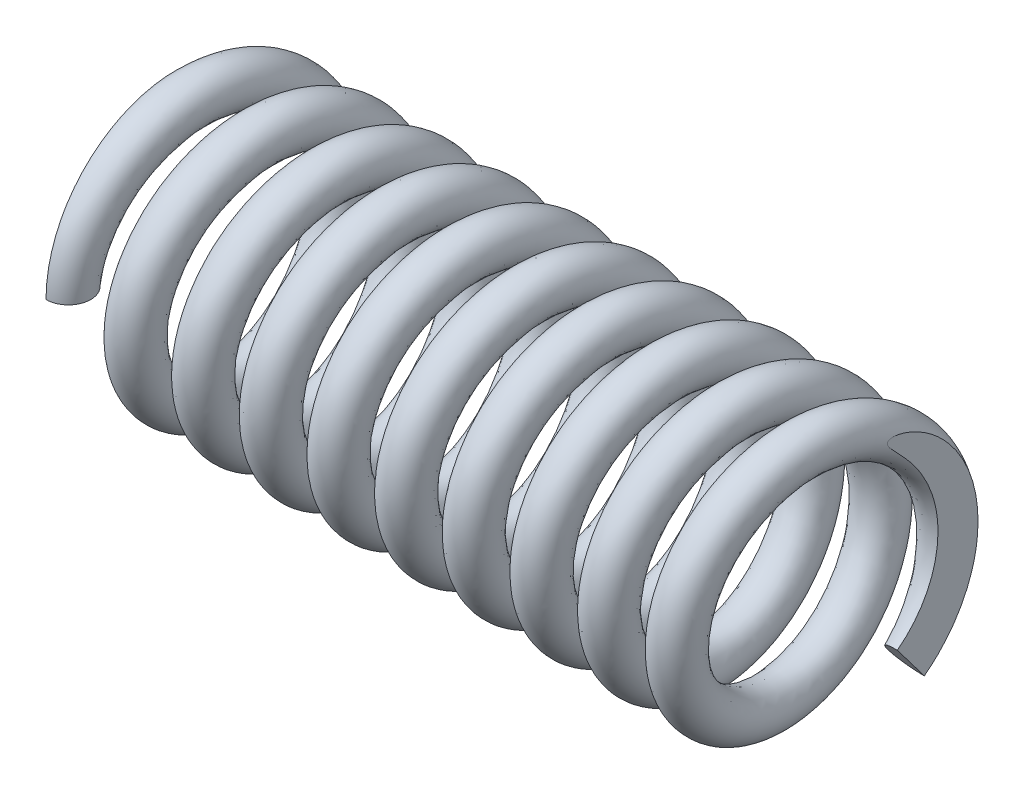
ISO-10303-21;
HEADER;
FILE_DESCRIPTION(('STEP AP214'),'2;1');
FILE_NAME('part.step','',(''),(''),'','','');
FILE_SCHEMA(('AUTOMOTIVE_DESIGN { 1 0 10303 214 1 1 1 1 }'));
ENDSEC;
DATA;
#1=APPLICATION_CONTEXT('core data for automotive mechanical design processes');
#2=APPLICATION_PROTOCOL_DEFINITION('international standard','automotive_design',2000,#1);
#3=PRODUCT_CONTEXT('',#1,'mechanical');
#4=PRODUCT('Part','Part','',(#3));
#5=PRODUCT_RELATED_PRODUCT_CATEGORY('part','',(#4));
#6=PRODUCT_DEFINITION_FORMATION('','',#4);
#7=PRODUCT_DEFINITION_CONTEXT('part definition',#1,'design');
#8=PRODUCT_DEFINITION('design','',#6,#7);
#9=PRODUCT_DEFINITION_SHAPE('','',#8);
#10=(LENGTH_UNIT() NAMED_UNIT(*) SI_UNIT(.MILLI.,.METRE.));
#11=(NAMED_UNIT(*) PLANE_ANGLE_UNIT() SI_UNIT($,.RADIAN.));
#12=(NAMED_UNIT(*) SI_UNIT($,.STERADIAN.) SOLID_ANGLE_UNIT());
#13=UNCERTAINTY_MEASURE_WITH_UNIT(LENGTH_MEASURE(1.E-05),#10,'distance_accuracy_value','');
#14=(GEOMETRIC_REPRESENTATION_CONTEXT(3) GLOBAL_UNCERTAINTY_ASSIGNED_CONTEXT((#13)) GLOBAL_UNIT_ASSIGNED_CONTEXT((#10,
#11,#12)) REPRESENTATION_CONTEXT('',''));
#15=CARTESIAN_POINT('',(0.,0.,0.));
#16=DIRECTION('',(0.,0.,1.));
#17=DIRECTION('',(1.,0.,0.));
#18=AXIS2_PLACEMENT_3D('',#15,#16,#17);
#19=CARTESIAN_POINT('',(16.6623157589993,-1.95602002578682,-1.47711775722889));
#20=DIRECTION('',(0.,0.602634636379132,-0.798017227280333));
#21=DIRECTION('',(0.,0.798017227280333,0.602634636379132));
#22=AXIS2_PLACEMENT_3D('',#19,#20,#21);
#23=PLANE('',#22);
#24=DIRECTION('',(0.,-0.798017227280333,-0.602634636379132));
#25=VECTOR('',#24,1.);
#26=CARTESIAN_POINT('',(16.6624,-1.95602002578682,-1.47711775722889));
#27=LINE('',#26,#25);
#28=CARTESIAN_POINT('',(16.6624,-1.95602003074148,-1.47711776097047));
#29=VERTEX_POINT('',#28);
#30=CARTESIAN_POINT('',(16.6623999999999,-2.86815371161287,-2.16592914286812));
#31=VERTEX_POINT('',#30);
#32=EDGE_CURVE('E52',#29,#31,#27,.T.);
#33=ORIENTED_EDGE('',*,*,#32,.F.);
#34=CARTESIAN_POINT('',(16.6623157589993,-2.41208687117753,-1.82152345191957));
#35=DIRECTION('',(0.,0.602634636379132,-0.798017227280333));
#36=DIRECTION('',(0.,-0.798017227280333,-0.602634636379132));
#37=AXIS2_PLACEMENT_3D('',#34,#35,#36);
#38=CIRCLE('',#37,0.5715);
#39=EDGE_CURVE('E39',#31,#29,#38,.T.);
#40=ORIENTED_EDGE('',*,*,#39,.F.);
#41=EDGE_LOOP('',(#33,#40));
#42=FACE_BOUND('',#41,.T.);
#43=ADVANCED_FACE('F35',(#42),#23,.F.);
#44=CARTESIAN_POINT('',(0.,0.,3.5941));
#45=CARTESIAN_POINT('',(0.08636,1.16779388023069,3.5941));
#46=CARTESIAN_POINT('',(0.17272,2.11255897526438,2.907687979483));
#47=CARTESIAN_POINT('',(0.25908,3.05732407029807,2.221275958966));
#48=CARTESIAN_POINT('',(0.34544,3.41819222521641,1.110637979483));
#49=CARTESIAN_POINT('',(0.4318,3.77906038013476,0.));
#50=CARTESIAN_POINT('',(0.51816,3.41819222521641,-1.110637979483));
#51=CARTESIAN_POINT('',(0.60452,3.05732407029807,-2.221275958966));
#52=CARTESIAN_POINT('',(0.69088,2.11255897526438,-2.907687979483));
#53=CARTESIAN_POINT('',(0.77724,1.16779388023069,-3.5941));
#54=CARTESIAN_POINT('',(0.8636,0.,-3.5941));
#55=CARTESIAN_POINT('',(0.94996,-1.16779388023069,-3.5941));
#56=CARTESIAN_POINT('',(1.03632,-2.11255897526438,-2.907687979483));
#57=CARTESIAN_POINT('',(1.12268,-3.05732407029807,-2.221275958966));
#58=CARTESIAN_POINT('',(1.20904,-3.41819222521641,-1.110637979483));
#59=CARTESIAN_POINT('',(1.2954,-3.77906038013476,0.));
#60=CARTESIAN_POINT('',(1.38176,-3.41819222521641,1.110637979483));
#61=CARTESIAN_POINT('',(1.46812,-3.05732407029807,2.221275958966));
#62=CARTESIAN_POINT('',(1.55448,-2.11255897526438,2.907687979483));
#63=CARTESIAN_POINT('',(1.64084,-1.16779388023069,3.5941));
#64=CARTESIAN_POINT('',(1.7272,0.,3.5941));
#65=CARTESIAN_POINT('',(1.81356,1.16779388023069,3.5941));
#66=CARTESIAN_POINT('',(1.89992,2.11255897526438,2.907687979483));
#67=CARTESIAN_POINT('',(1.98628,3.05732407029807,2.221275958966));
#68=CARTESIAN_POINT('',(2.07264,3.41819222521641,1.110637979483));
#69=CARTESIAN_POINT('',(2.159,3.77906038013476,0.));
#70=CARTESIAN_POINT('',(2.24536,3.41819222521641,-1.110637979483));
#71=CARTESIAN_POINT('',(2.33172,3.05732407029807,-2.221275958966));
#72=CARTESIAN_POINT('',(2.41808,2.11255897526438,-2.907687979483));
#73=CARTESIAN_POINT('',(2.50444,1.16779388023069,-3.5941));
#74=CARTESIAN_POINT('',(2.5908,0.,-3.5941));
#75=CARTESIAN_POINT('',(2.67716,-1.16779388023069,-3.5941));
#76=CARTESIAN_POINT('',(2.76352,-2.11255897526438,-2.907687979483));
#77=CARTESIAN_POINT('',(2.84988,-3.05732407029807,-2.221275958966));
#78=CARTESIAN_POINT('',(2.93624,-3.41819222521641,-1.110637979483));
#79=CARTESIAN_POINT('',(3.0226,-3.77906038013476,0.));
#80=CARTESIAN_POINT('',(3.10896,-3.41819222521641,1.110637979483));
#81=CARTESIAN_POINT('',(3.19532,-3.05732407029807,2.221275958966));
#82=CARTESIAN_POINT('',(3.28168,-2.11255897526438,2.907687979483));
#83=CARTESIAN_POINT('',(3.36804,-1.16779388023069,3.5941));
#84=CARTESIAN_POINT('',(3.4544,0.,3.5941));
#85=CARTESIAN_POINT('',(3.54076,1.16779388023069,3.5941));
#86=CARTESIAN_POINT('',(3.62712,2.11255897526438,2.907687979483));
#87=CARTESIAN_POINT('',(3.71348,3.05732407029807,2.221275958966));
#88=CARTESIAN_POINT('',(3.79984,3.41819222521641,1.110637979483));
#89=CARTESIAN_POINT('',(3.8862,3.77906038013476,0.));
#90=CARTESIAN_POINT('',(3.97256,3.41819222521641,-1.110637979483));
#91=CARTESIAN_POINT('',(4.05892,3.05732407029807,-2.221275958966));
#92=CARTESIAN_POINT('',(4.14528,2.11255897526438,-2.907687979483));
#93=CARTESIAN_POINT('',(4.23164,1.16779388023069,-3.5941));
#94=CARTESIAN_POINT('',(4.318,0.,-3.5941));
#95=CARTESIAN_POINT('',(4.40436,-1.16779388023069,-3.5941));
#96=CARTESIAN_POINT('',(4.49072,-2.11255897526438,-2.907687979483));
#97=CARTESIAN_POINT('',(4.57708,-3.05732407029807,-2.221275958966));
#98=CARTESIAN_POINT('',(4.66344,-3.41819222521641,-1.110637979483));
#99=CARTESIAN_POINT('',(4.7498,-3.77906038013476,0.));
#100=CARTESIAN_POINT('',(4.83616,-3.41819222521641,1.110637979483));
#101=CARTESIAN_POINT('',(4.92252,-3.05732407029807,2.221275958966));
#102=CARTESIAN_POINT('',(5.00888,-2.11255897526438,2.907687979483));
#103=CARTESIAN_POINT('',(5.09524,-1.16779388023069,3.5941));
#104=CARTESIAN_POINT('',(5.1816,0.,3.5941));
#105=CARTESIAN_POINT('',(5.26796,1.16779388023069,3.5941));
#106=CARTESIAN_POINT('',(5.35432,2.11255897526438,2.907687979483));
#107=CARTESIAN_POINT('',(5.44068,3.05732407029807,2.221275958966));
#108=CARTESIAN_POINT('',(5.52704,3.41819222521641,1.110637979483));
#109=CARTESIAN_POINT('',(5.6134,3.77906038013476,0.));
#110=CARTESIAN_POINT('',(5.69976,3.41819222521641,-1.110637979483));
#111=CARTESIAN_POINT('',(5.78612,3.05732407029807,-2.221275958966));
#112=CARTESIAN_POINT('',(5.87248,2.11255897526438,-2.907687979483));
#113=CARTESIAN_POINT('',(5.95884,1.16779388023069,-3.5941));
#114=CARTESIAN_POINT('',(6.0452,0.,-3.5941));
#115=CARTESIAN_POINT('',(6.13156,-1.16779388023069,-3.5941));
#116=CARTESIAN_POINT('',(6.21792,-2.11255897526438,-2.907687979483));
#117=CARTESIAN_POINT('',(6.30428,-3.05732407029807,-2.221275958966));
#118=CARTESIAN_POINT('',(6.39064,-3.41819222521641,-1.110637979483));
#119=CARTESIAN_POINT('',(6.477,-3.77906038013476,0.));
#120=CARTESIAN_POINT('',(6.56336,-3.41819222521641,1.110637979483));
#121=CARTESIAN_POINT('',(6.64972,-3.05732407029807,2.221275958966));
#122=CARTESIAN_POINT('',(6.73608,-2.11255897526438,2.907687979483));
#123=CARTESIAN_POINT('',(6.82244,-1.16779388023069,3.5941));
#124=CARTESIAN_POINT('',(6.9088,0.,3.5941));
#125=CARTESIAN_POINT('',(6.99516,1.16779388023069,3.5941));
#126=CARTESIAN_POINT('',(7.08152,2.11255897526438,2.907687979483));
#127=CARTESIAN_POINT('',(7.16788,3.05732407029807,2.221275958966));
#128=CARTESIAN_POINT('',(7.25424,3.41819222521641,1.110637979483));
#129=CARTESIAN_POINT('',(7.3406,3.77906038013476,0.));
#130=CARTESIAN_POINT('',(7.42696,3.41819222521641,-1.110637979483));
#131=CARTESIAN_POINT('',(7.51332,3.05732407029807,-2.221275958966));
#132=CARTESIAN_POINT('',(7.59968,2.11255897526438,-2.907687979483));
#133=CARTESIAN_POINT('',(7.68604,1.16779388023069,-3.5941));
#134=CARTESIAN_POINT('',(7.7724,0.,-3.5941));
#135=CARTESIAN_POINT('',(7.85876,-1.16779388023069,-3.5941));
#136=CARTESIAN_POINT('',(7.94512,-2.11255897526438,-2.907687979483));
#137=CARTESIAN_POINT('',(8.03148,-3.05732407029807,-2.221275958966));
#138=CARTESIAN_POINT('',(8.11784,-3.41819222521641,-1.110637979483));
#139=CARTESIAN_POINT('',(8.2042,-3.77906038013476,0.));
#140=CARTESIAN_POINT('',(8.29056,-3.41819222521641,1.110637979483));
#141=CARTESIAN_POINT('',(8.37692,-3.05732407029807,2.221275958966));
#142=CARTESIAN_POINT('',(8.46328,-2.11255897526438,2.907687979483));
#143=CARTESIAN_POINT('',(8.54964,-1.16779388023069,3.5941));
#144=CARTESIAN_POINT('',(8.636,0.,3.5941));
#145=CARTESIAN_POINT('',(8.72236,1.16779388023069,3.5941));
#146=CARTESIAN_POINT('',(8.80872,2.11255897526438,2.907687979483));
#147=CARTESIAN_POINT('',(8.89508,3.05732407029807,2.221275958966));
#148=CARTESIAN_POINT('',(8.98144,3.41819222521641,1.110637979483));
#149=CARTESIAN_POINT('',(9.0678,3.77906038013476,0.));
#150=CARTESIAN_POINT('',(9.15416,3.41819222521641,-1.110637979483));
#151=CARTESIAN_POINT('',(9.24052,3.05732407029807,-2.221275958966));
#152=CARTESIAN_POINT('',(9.32688,2.11255897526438,-2.907687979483));
#153=CARTESIAN_POINT('',(9.41324,1.16779388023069,-3.5941));
#154=CARTESIAN_POINT('',(9.4996,0.,-3.5941));
#155=CARTESIAN_POINT('',(9.58596,-1.16779388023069,-3.5941));
#156=CARTESIAN_POINT('',(9.67232,-2.11255897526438,-2.907687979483));
#157=CARTESIAN_POINT('',(9.75868,-3.05732407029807,-2.221275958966));
#158=CARTESIAN_POINT('',(9.84504,-3.41819222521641,-1.110637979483));
#159=CARTESIAN_POINT('',(9.9314,-3.77906038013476,0.));
#160=CARTESIAN_POINT('',(10.01776,-3.41819222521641,1.110637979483));
#161=CARTESIAN_POINT('',(10.10412,-3.05732407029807,2.221275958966));
#162=CARTESIAN_POINT('',(10.19048,-2.11255897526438,2.907687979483));
#163=CARTESIAN_POINT('',(10.27684,-1.16779388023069,3.5941));
#164=CARTESIAN_POINT('',(10.3632,0.,3.5941));
#165=CARTESIAN_POINT('',(10.44956,1.16779388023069,3.5941));
#166=CARTESIAN_POINT('',(10.53592,2.11255897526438,2.907687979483));
#167=CARTESIAN_POINT('',(10.62228,3.05732407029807,2.221275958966));
#168=CARTESIAN_POINT('',(10.70864,3.41819222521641,1.110637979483));
#169=CARTESIAN_POINT('',(10.795,3.77906038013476,0.));
#170=CARTESIAN_POINT('',(10.88136,3.41819222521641,-1.110637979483));
#171=CARTESIAN_POINT('',(10.96772,3.05732407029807,-2.221275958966));
#172=CARTESIAN_POINT('',(11.05408,2.11255897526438,-2.907687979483));
#173=CARTESIAN_POINT('',(11.14044,1.16779388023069,-3.5941));
#174=CARTESIAN_POINT('',(11.2268,0.,-3.5941));
#175=CARTESIAN_POINT('',(11.31316,-1.16779388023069,-3.5941));
#176=CARTESIAN_POINT('',(11.39952,-2.11255897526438,-2.907687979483));
#177=CARTESIAN_POINT('',(11.48588,-3.05732407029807,-2.221275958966));
#178=CARTESIAN_POINT('',(11.57224,-3.41819222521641,-1.110637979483));
#179=CARTESIAN_POINT('',(11.6586,-3.77906038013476,0.));
#180=CARTESIAN_POINT('',(11.74496,-3.41819222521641,1.110637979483));
#181=CARTESIAN_POINT('',(11.83132,-3.05732407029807,2.221275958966));
#182=CARTESIAN_POINT('',(11.91768,-2.11255897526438,2.907687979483));
#183=CARTESIAN_POINT('',(12.00404,-1.16779388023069,3.5941));
#184=CARTESIAN_POINT('',(12.0904,0.,3.5941));
#185=CARTESIAN_POINT('',(12.17676,1.16779388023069,3.5941));
#186=CARTESIAN_POINT('',(12.26312,2.11255897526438,2.907687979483));
#187=CARTESIAN_POINT('',(12.34948,3.05732407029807,2.221275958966));
#188=CARTESIAN_POINT('',(12.43584,3.41819222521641,1.110637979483));
#189=CARTESIAN_POINT('',(12.5222,3.77906038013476,0.));
#190=CARTESIAN_POINT('',(12.60856,3.41819222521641,-1.110637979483));
#191=CARTESIAN_POINT('',(12.69492,3.05732407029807,-2.221275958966));
#192=CARTESIAN_POINT('',(12.78128,2.11255897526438,-2.907687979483));
#193=CARTESIAN_POINT('',(12.86764,1.16779388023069,-3.5941));
#194=CARTESIAN_POINT('',(12.954,0.,-3.5941));
#195=CARTESIAN_POINT('',(13.04036,-1.16779388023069,-3.5941));
#196=CARTESIAN_POINT('',(13.12672,-2.11255897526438,-2.907687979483));
#197=CARTESIAN_POINT('',(13.21308,-3.05732407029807,-2.221275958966));
#198=CARTESIAN_POINT('',(13.29944,-3.41819222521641,-1.110637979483));
#199=CARTESIAN_POINT('',(13.3858,-3.77906038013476,0.));
#200=CARTESIAN_POINT('',(13.47216,-3.41819222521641,1.110637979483));
#201=CARTESIAN_POINT('',(13.55852,-3.05732407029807,2.221275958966));
#202=CARTESIAN_POINT('',(13.64488,-2.11255897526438,2.907687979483));
#203=CARTESIAN_POINT('',(13.73124,-1.16779388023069,3.5941));
#204=CARTESIAN_POINT('',(13.8176,0.,3.5941));
#205=CARTESIAN_POINT('',(13.90396,1.16779388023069,3.5941));
#206=CARTESIAN_POINT('',(13.99032,2.11255897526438,2.907687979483));
#207=CARTESIAN_POINT('',(14.07668,3.05732407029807,2.221275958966));
#208=CARTESIAN_POINT('',(14.16304,3.41819222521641,1.110637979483));
#209=CARTESIAN_POINT('',(14.2494,3.77906038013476,0.));
#210=CARTESIAN_POINT('',(14.33576,3.41819222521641,-1.110637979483));
#211=CARTESIAN_POINT('',(14.42212,3.05732407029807,-2.221275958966));
#212=CARTESIAN_POINT('',(14.50848,2.11255897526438,-2.907687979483));
#213=CARTESIAN_POINT('',(14.59484,1.16779388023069,-3.5941));
#214=CARTESIAN_POINT('',(14.6812,0.,-3.5941));
#215=CARTESIAN_POINT('',(14.76756,-1.16779388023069,-3.5941));
#216=CARTESIAN_POINT('',(14.85392,-2.11255897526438,-2.907687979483));
#217=CARTESIAN_POINT('',(14.94028,-3.05732407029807,-2.221275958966));
#218=CARTESIAN_POINT('',(15.02664,-3.41819222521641,-1.110637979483));
#219=CARTESIAN_POINT('',(15.113,-3.77906038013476,0.));
#220=CARTESIAN_POINT('',(15.19936,-3.41819222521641,1.110637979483));
#221=CARTESIAN_POINT('',(15.28572,-3.05732407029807,2.221275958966));
#222=CARTESIAN_POINT('',(15.37208,-2.11255897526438,2.907687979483));
#223=CARTESIAN_POINT('',(15.45844,-1.16779388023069,3.5941));
#224=CARTESIAN_POINT('',(15.5448,0.,3.5941));
#225=CARTESIAN_POINT('',(15.63116,1.16779388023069,3.5941));
#226=CARTESIAN_POINT('',(15.71752,2.11255897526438,2.907687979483));
#227=CARTESIAN_POINT('',(15.80388,3.05732407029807,2.221275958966));
#228=CARTESIAN_POINT('',(15.89024,3.41819222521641,1.110637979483));
#229=CARTESIAN_POINT('',(15.9766,3.77906038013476,0.));
#230=CARTESIAN_POINT('',(16.06296,3.41819222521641,-1.110637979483));
#231=CARTESIAN_POINT('',(16.14932,3.05732407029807,-2.221275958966));
#232=CARTESIAN_POINT('',(16.23568,2.11255897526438,-2.907687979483));
#233=CARTESIAN_POINT('',(16.32204,1.16779388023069,-3.5941));
#234=CARTESIAN_POINT('',(16.4084,0.,-3.5941));
#235=CARTESIAN_POINT('',(16.49476,-1.16779388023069,-3.5941));
#236=CARTESIAN_POINT('',(16.58112,-2.11255897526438,-2.907687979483));
#237=CARTESIAN_POINT('',(16.6207029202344,-2.54559002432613,-2.59307250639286));
#238=CARTESIAN_POINT('',(16.6623157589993,-2.86815371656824,-2.16592914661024));
#239=CARTESIAN_POINT('',(1.143,0.,3.5941));
#240=CARTESIAN_POINT('',(1.22936,1.16779388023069,3.5941));
#241=CARTESIAN_POINT('',(1.31572,2.11255897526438,2.907687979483));
#242=CARTESIAN_POINT('',(1.40208,3.05732407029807,2.221275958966));
#243=CARTESIAN_POINT('',(1.48844,3.41819222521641,1.110637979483));
#244=CARTESIAN_POINT('',(1.5748,3.77906038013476,0.));
#245=CARTESIAN_POINT('',(1.66116,3.41819222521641,-1.110637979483));
#246=CARTESIAN_POINT('',(1.74752,3.05732407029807,-2.221275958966));
#247=CARTESIAN_POINT('',(1.83388,2.11255897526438,-2.907687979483));
#248=CARTESIAN_POINT('',(1.92024,1.16779388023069,-3.5941));
#249=CARTESIAN_POINT('',(2.0066,0.,-3.5941));
#250=CARTESIAN_POINT('',(2.09296,-1.16779388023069,-3.5941));
#251=CARTESIAN_POINT('',(2.17932,-2.11255897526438,-2.907687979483));
#252=CARTESIAN_POINT('',(2.26568,-3.05732407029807,-2.221275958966));
#253=CARTESIAN_POINT('',(2.35204,-3.41819222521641,-1.110637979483));
#254=CARTESIAN_POINT('',(2.4384,-3.77906038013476,0.));
#255=CARTESIAN_POINT('',(2.52476,-3.41819222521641,1.110637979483));
#256=CARTESIAN_POINT('',(2.61112,-3.05732407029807,2.221275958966));
#257=CARTESIAN_POINT('',(2.69748,-2.11255897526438,2.907687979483));
#258=CARTESIAN_POINT('',(2.78384,-1.16779388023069,3.5941));
#259=CARTESIAN_POINT('',(2.8702,0.,3.5941));
#260=CARTESIAN_POINT('',(2.95656,1.16779388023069,3.5941));
#261=CARTESIAN_POINT('',(3.04292,2.11255897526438,2.907687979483));
#262=CARTESIAN_POINT('',(3.12928,3.05732407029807,2.221275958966));
#263=CARTESIAN_POINT('',(3.21564,3.41819222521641,1.110637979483));
#264=CARTESIAN_POINT('',(3.302,3.77906038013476,0.));
#265=CARTESIAN_POINT('',(3.38836,3.41819222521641,-1.110637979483));
#266=CARTESIAN_POINT('',(3.47472,3.05732407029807,-2.221275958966));
#267=CARTESIAN_POINT('',(3.56108,2.11255897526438,-2.907687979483));
#268=CARTESIAN_POINT('',(3.64744,1.16779388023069,-3.5941));
#269=CARTESIAN_POINT('',(3.7338,0.,-3.5941));
#270=CARTESIAN_POINT('',(3.82016,-1.16779388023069,-3.5941));
#271=CARTESIAN_POINT('',(3.90652,-2.11255897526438,-2.907687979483));
#272=CARTESIAN_POINT('',(3.99288,-3.05732407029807,-2.221275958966));
#273=CARTESIAN_POINT('',(4.07924,-3.41819222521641,-1.110637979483));
#274=CARTESIAN_POINT('',(4.1656,-3.77906038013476,0.));
#275=CARTESIAN_POINT('',(4.25196,-3.41819222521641,1.110637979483));
#276=CARTESIAN_POINT('',(4.33832,-3.05732407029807,2.221275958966));
#277=CARTESIAN_POINT('',(4.42468,-2.11255897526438,2.907687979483));
#278=CARTESIAN_POINT('',(4.51104,-1.16779388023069,3.5941));
#279=CARTESIAN_POINT('',(4.5974,0.,3.5941));
#280=CARTESIAN_POINT('',(4.68376,1.16779388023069,3.5941));
#281=CARTESIAN_POINT('',(4.77012,2.11255897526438,2.907687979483));
#282=CARTESIAN_POINT('',(4.85648,3.05732407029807,2.221275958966));
#283=CARTESIAN_POINT('',(4.94284,3.41819222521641,1.110637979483));
#284=CARTESIAN_POINT('',(5.0292,3.77906038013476,0.));
#285=CARTESIAN_POINT('',(5.11556,3.41819222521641,-1.110637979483));
#286=CARTESIAN_POINT('',(5.20192,3.05732407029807,-2.221275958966));
#287=CARTESIAN_POINT('',(5.28828,2.11255897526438,-2.907687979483));
#288=CARTESIAN_POINT('',(5.37464,1.16779388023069,-3.5941));
#289=CARTESIAN_POINT('',(5.461,0.,-3.5941));
#290=CARTESIAN_POINT('',(5.54736,-1.16779388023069,-3.5941));
#291=CARTESIAN_POINT('',(5.63372,-2.11255897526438,-2.907687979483));
#292=CARTESIAN_POINT('',(5.72008,-3.05732407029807,-2.221275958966));
#293=CARTESIAN_POINT('',(5.80644,-3.41819222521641,-1.110637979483));
#294=CARTESIAN_POINT('',(5.8928,-3.77906038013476,0.));
#295=CARTESIAN_POINT('',(5.97916,-3.41819222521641,1.110637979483));
#296=CARTESIAN_POINT('',(6.06552,-3.05732407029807,2.221275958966));
#297=CARTESIAN_POINT('',(6.15188,-2.11255897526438,2.907687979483));
#298=CARTESIAN_POINT('',(6.23824,-1.16779388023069,3.5941));
#299=CARTESIAN_POINT('',(6.3246,0.,3.5941));
#300=CARTESIAN_POINT('',(6.41096,1.16779388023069,3.5941));
#301=CARTESIAN_POINT('',(6.49732,2.11255897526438,2.907687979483));
#302=CARTESIAN_POINT('',(6.58368,3.05732407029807,2.221275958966));
#303=CARTESIAN_POINT('',(6.67004,3.41819222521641,1.110637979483));
#304=CARTESIAN_POINT('',(6.7564,3.77906038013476,0.));
#305=CARTESIAN_POINT('',(6.84276,3.41819222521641,-1.110637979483));
#306=CARTESIAN_POINT('',(6.92912,3.05732407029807,-2.221275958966));
#307=CARTESIAN_POINT('',(7.01548,2.11255897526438,-2.907687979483));
#308=CARTESIAN_POINT('',(7.10184,1.16779388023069,-3.5941));
#309=CARTESIAN_POINT('',(7.1882,0.,-3.5941));
#310=CARTESIAN_POINT('',(7.27456,-1.16779388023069,-3.5941));
#311=CARTESIAN_POINT('',(7.36092,-2.11255897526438,-2.907687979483));
#312=CARTESIAN_POINT('',(7.44728,-3.05732407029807,-2.221275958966));
#313=CARTESIAN_POINT('',(7.53364,-3.41819222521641,-1.110637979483));
#314=CARTESIAN_POINT('',(7.62,-3.77906038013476,0.));
#315=CARTESIAN_POINT('',(7.70636,-3.41819222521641,1.110637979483));
#316=CARTESIAN_POINT('',(7.79272,-3.05732407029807,2.221275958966));
#317=CARTESIAN_POINT('',(7.87908,-2.11255897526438,2.907687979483));
#318=CARTESIAN_POINT('',(7.96544,-1.16779388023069,3.5941));
#319=CARTESIAN_POINT('',(8.0518,0.,3.5941));
#320=CARTESIAN_POINT('',(8.13816,1.16779388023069,3.5941));
#321=CARTESIAN_POINT('',(8.22452,2.11255897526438,2.907687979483));
#322=CARTESIAN_POINT('',(8.31088,3.05732407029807,2.221275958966));
#323=CARTESIAN_POINT('',(8.39724,3.41819222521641,1.110637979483));
#324=CARTESIAN_POINT('',(8.4836,3.77906038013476,0.));
#325=CARTESIAN_POINT('',(8.56996,3.41819222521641,-1.110637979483));
#326=CARTESIAN_POINT('',(8.65632,3.05732407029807,-2.221275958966));
#327=CARTESIAN_POINT('',(8.74268,2.11255897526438,-2.907687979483));
#328=CARTESIAN_POINT('',(8.82904,1.16779388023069,-3.5941));
#329=CARTESIAN_POINT('',(8.9154,0.,-3.5941));
#330=CARTESIAN_POINT('',(9.00176,-1.16779388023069,-3.5941));
#331=CARTESIAN_POINT('',(9.08812,-2.11255897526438,-2.907687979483));
#332=CARTESIAN_POINT('',(9.17448,-3.05732407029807,-2.221275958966));
#333=CARTESIAN_POINT('',(9.26084,-3.41819222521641,-1.110637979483));
#334=CARTESIAN_POINT('',(9.3472,-3.77906038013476,0.));
#335=CARTESIAN_POINT('',(9.43356,-3.41819222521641,1.110637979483));
#336=CARTESIAN_POINT('',(9.51992,-3.05732407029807,2.221275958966));
#337=CARTESIAN_POINT('',(9.60628,-2.11255897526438,2.907687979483));
#338=CARTESIAN_POINT('',(9.69264,-1.16779388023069,3.5941));
#339=CARTESIAN_POINT('',(9.779,0.,3.5941));
#340=CARTESIAN_POINT('',(9.86536,1.16779388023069,3.5941));
#341=CARTESIAN_POINT('',(9.95172,2.11255897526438,2.907687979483));
#342=CARTESIAN_POINT('',(10.03808,3.05732407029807,2.221275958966));
#343=CARTESIAN_POINT('',(10.12444,3.41819222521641,1.110637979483));
#344=CARTESIAN_POINT('',(10.2108,3.77906038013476,0.));
#345=CARTESIAN_POINT('',(10.29716,3.41819222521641,-1.110637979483));
#346=CARTESIAN_POINT('',(10.38352,3.05732407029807,-2.221275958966));
#347=CARTESIAN_POINT('',(10.46988,2.11255897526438,-2.907687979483));
#348=CARTESIAN_POINT('',(10.55624,1.16779388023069,-3.5941));
#349=CARTESIAN_POINT('',(10.6426,0.,-3.5941));
#350=CARTESIAN_POINT('',(10.72896,-1.16779388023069,-3.5941));
#351=CARTESIAN_POINT('',(10.81532,-2.11255897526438,-2.907687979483));
#352=CARTESIAN_POINT('',(10.90168,-3.05732407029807,-2.221275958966));
#353=CARTESIAN_POINT('',(10.98804,-3.41819222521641,-1.110637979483));
#354=CARTESIAN_POINT('',(11.0744,-3.77906038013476,0.));
#355=CARTESIAN_POINT('',(11.16076,-3.41819222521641,1.110637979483));
#356=CARTESIAN_POINT('',(11.24712,-3.05732407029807,2.221275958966));
#357=CARTESIAN_POINT('',(11.33348,-2.11255897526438,2.907687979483));
#358=CARTESIAN_POINT('',(11.41984,-1.16779388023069,3.5941));
#359=CARTESIAN_POINT('',(11.5062,0.,3.5941));
#360=CARTESIAN_POINT('',(11.59256,1.16779388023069,3.5941));
#361=CARTESIAN_POINT('',(11.67892,2.11255897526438,2.907687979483));
#362=CARTESIAN_POINT('',(11.76528,3.05732407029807,2.221275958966));
#363=CARTESIAN_POINT('',(11.85164,3.41819222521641,1.110637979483));
#364=CARTESIAN_POINT('',(11.938,3.77906038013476,0.));
#365=CARTESIAN_POINT('',(12.02436,3.41819222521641,-1.110637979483));
#366=CARTESIAN_POINT('',(12.11072,3.05732407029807,-2.221275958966));
#367=CARTESIAN_POINT('',(12.19708,2.11255897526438,-2.907687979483));
#368=CARTESIAN_POINT('',(12.28344,1.16779388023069,-3.5941));
#369=CARTESIAN_POINT('',(12.3698,0.,-3.5941));
#370=CARTESIAN_POINT('',(12.45616,-1.16779388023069,-3.5941));
#371=CARTESIAN_POINT('',(12.54252,-2.11255897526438,-2.907687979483));
#372=CARTESIAN_POINT('',(12.62888,-3.05732407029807,-2.221275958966));
#373=CARTESIAN_POINT('',(12.71524,-3.41819222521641,-1.110637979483));
#374=CARTESIAN_POINT('',(12.8016,-3.77906038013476,0.));
#375=CARTESIAN_POINT('',(12.88796,-3.41819222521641,1.110637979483));
#376=CARTESIAN_POINT('',(12.97432,-3.05732407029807,2.221275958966));
#377=CARTESIAN_POINT('',(13.06068,-2.11255897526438,2.907687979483));
#378=CARTESIAN_POINT('',(13.14704,-1.16779388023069,3.5941));
#379=CARTESIAN_POINT('',(13.2334,0.,3.5941));
#380=CARTESIAN_POINT('',(13.31976,1.16779388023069,3.5941));
#381=CARTESIAN_POINT('',(13.40612,2.11255897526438,2.907687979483));
#382=CARTESIAN_POINT('',(13.49248,3.05732407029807,2.221275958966));
#383=CARTESIAN_POINT('',(13.57884,3.41819222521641,1.110637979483));
#384=CARTESIAN_POINT('',(13.6652,3.77906038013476,0.));
#385=CARTESIAN_POINT('',(13.75156,3.41819222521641,-1.110637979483));
#386=CARTESIAN_POINT('',(13.83792,3.05732407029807,-2.221275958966));
#387=CARTESIAN_POINT('',(13.92428,2.11255897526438,-2.907687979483));
#388=CARTESIAN_POINT('',(14.01064,1.16779388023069,-3.5941));
#389=CARTESIAN_POINT('',(14.097,0.,-3.5941));
#390=CARTESIAN_POINT('',(14.18336,-1.16779388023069,-3.5941));
#391=CARTESIAN_POINT('',(14.26972,-2.11255897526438,-2.907687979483));
#392=CARTESIAN_POINT('',(14.35608,-3.05732407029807,-2.221275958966));
#393=CARTESIAN_POINT('',(14.44244,-3.41819222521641,-1.110637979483));
#394=CARTESIAN_POINT('',(14.5288,-3.77906038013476,0.));
#395=CARTESIAN_POINT('',(14.61516,-3.41819222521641,1.110637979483));
#396=CARTESIAN_POINT('',(14.70152,-3.05732407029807,2.221275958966));
#397=CARTESIAN_POINT('',(14.78788,-2.11255897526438,2.907687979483));
#398=CARTESIAN_POINT('',(14.87424,-1.16779388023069,3.5941));
#399=CARTESIAN_POINT('',(14.9606,0.,3.5941));
#400=CARTESIAN_POINT('',(15.04696,1.16779388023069,3.5941));
#401=CARTESIAN_POINT('',(15.13332,2.11255897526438,2.907687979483));
#402=CARTESIAN_POINT('',(15.21968,3.05732407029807,2.221275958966));
#403=CARTESIAN_POINT('',(15.30604,3.41819222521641,1.110637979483));
#404=CARTESIAN_POINT('',(15.3924,3.77906038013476,0.));
#405=CARTESIAN_POINT('',(15.47876,3.41819222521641,-1.110637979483));
#406=CARTESIAN_POINT('',(15.56512,3.05732407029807,-2.221275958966));
#407=CARTESIAN_POINT('',(15.65148,2.11255897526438,-2.907687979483));
#408=CARTESIAN_POINT('',(15.73784,1.16779388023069,-3.5941));
#409=CARTESIAN_POINT('',(15.8242,0.,-3.5941));
#410=CARTESIAN_POINT('',(15.91056,-1.16779388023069,-3.5941));
#411=CARTESIAN_POINT('',(15.99692,-2.11255897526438,-2.907687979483));
#412=CARTESIAN_POINT('',(16.08328,-3.05732407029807,-2.221275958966));
#413=CARTESIAN_POINT('',(16.16964,-3.41819222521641,-1.110637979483));
#414=CARTESIAN_POINT('',(16.256,-3.77906038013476,0.));
#415=CARTESIAN_POINT('',(16.34236,-3.41819222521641,1.110637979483));
#416=CARTESIAN_POINT('',(16.42872,-3.05732407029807,2.221275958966));
#417=CARTESIAN_POINT('',(16.51508,-2.11255897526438,2.907687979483));
#418=CARTESIAN_POINT('',(16.60144,-1.16779388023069,3.5941));
#419=CARTESIAN_POINT('',(16.6878,0.,3.5941));
#420=CARTESIAN_POINT('',(16.77416,1.16779388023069,3.5941));
#421=CARTESIAN_POINT('',(16.86052,2.11255897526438,2.907687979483));
#422=CARTESIAN_POINT('',(16.94688,3.05732407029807,2.221275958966));
#423=CARTESIAN_POINT('',(17.03324,3.41819222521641,1.110637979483));
#424=CARTESIAN_POINT('',(17.1196,3.77906038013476,0.));
#425=CARTESIAN_POINT('',(17.20596,3.41819222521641,-1.110637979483));
#426=CARTESIAN_POINT('',(17.29232,3.05732407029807,-2.221275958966));
#427=CARTESIAN_POINT('',(17.37868,2.11255897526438,-2.907687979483));
#428=CARTESIAN_POINT('',(17.46504,1.16779388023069,-3.5941));
#429=CARTESIAN_POINT('',(17.5514,0.,-3.5941));
#430=CARTESIAN_POINT('',(17.63776,-1.16779388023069,-3.5941));
#431=CARTESIAN_POINT('',(17.72412,-2.11255897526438,-2.907687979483));
#432=CARTESIAN_POINT('',(17.7637029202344,-2.54559002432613,-2.59307250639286));
#433=CARTESIAN_POINT('',(17.8053157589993,-2.86815371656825,-2.16592914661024));
#434=CARTESIAN_POINT('',(1.143,0.,2.4511));
#435=CARTESIAN_POINT('',(1.22936,0.796410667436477,2.4511));
#436=CARTESIAN_POINT('',(1.31572,1.44072043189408,1.98298155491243));
#437=CARTESIAN_POINT('',(1.40208,2.08503019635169,1.51486310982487));
#438=CARTESIAN_POINT('',(1.48844,2.33113462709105,0.757431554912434));
#439=CARTESIAN_POINT('',(1.5748,2.57723905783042,0.));
#440=CARTESIAN_POINT('',(1.66116,2.33113462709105,-0.757431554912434));
#441=CARTESIAN_POINT('',(1.74752,2.08503019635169,-1.51486310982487));
#442=CARTESIAN_POINT('',(1.83388,1.44072043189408,-1.98298155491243));
#443=CARTESIAN_POINT('',(1.92024,0.796410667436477,-2.4511));
#444=CARTESIAN_POINT('',(2.0066,0.,-2.4511));
#445=CARTESIAN_POINT('',(2.09296,-0.796410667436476,-2.4511));
#446=CARTESIAN_POINT('',(2.17932,-1.44072043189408,-1.98298155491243));
#447=CARTESIAN_POINT('',(2.26568,-2.08503019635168,-1.51486310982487));
#448=CARTESIAN_POINT('',(2.35204,-2.33113462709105,-0.757431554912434));
#449=CARTESIAN_POINT('',(2.4384,-2.57723905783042,0.));
#450=CARTESIAN_POINT('',(2.52476,-2.33113462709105,0.757431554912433));
#451=CARTESIAN_POINT('',(2.61112,-2.08503019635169,1.51486310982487));
#452=CARTESIAN_POINT('',(2.69748,-1.44072043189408,1.98298155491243));
#453=CARTESIAN_POINT('',(2.78384,-0.796410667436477,2.4511));
#454=CARTESIAN_POINT('',(2.8702,0.,2.4511));
#455=CARTESIAN_POINT('',(2.95656,0.796410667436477,2.4511));
#456=CARTESIAN_POINT('',(3.04292,1.44072043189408,1.98298155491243));
#457=CARTESIAN_POINT('',(3.12928,2.08503019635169,1.51486310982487));
#458=CARTESIAN_POINT('',(3.21564,2.33113462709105,0.757431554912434));
#459=CARTESIAN_POINT('',(3.302,2.57723905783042,0.));
#460=CARTESIAN_POINT('',(3.38836,2.33113462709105,-0.757431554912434));
#461=CARTESIAN_POINT('',(3.47472,2.08503019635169,-1.51486310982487));
#462=CARTESIAN_POINT('',(3.56108,1.44072043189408,-1.98298155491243));
#463=CARTESIAN_POINT('',(3.64744,0.796410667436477,-2.4511));
#464=CARTESIAN_POINT('',(3.7338,0.,-2.4511));
#465=CARTESIAN_POINT('',(3.82016,-0.796410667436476,-2.4511));
#466=CARTESIAN_POINT('',(3.90652,-1.44072043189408,-1.98298155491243));
#467=CARTESIAN_POINT('',(3.99288,-2.08503019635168,-1.51486310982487));
#468=CARTESIAN_POINT('',(4.07924,-2.33113462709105,-0.757431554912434));
#469=CARTESIAN_POINT('',(4.1656,-2.57723905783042,0.));
#470=CARTESIAN_POINT('',(4.25196,-2.33113462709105,0.757431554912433));
#471=CARTESIAN_POINT('',(4.33832,-2.08503019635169,1.51486310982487));
#472=CARTESIAN_POINT('',(4.42468,-1.44072043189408,1.98298155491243));
#473=CARTESIAN_POINT('',(4.51104,-0.796410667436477,2.4511));
#474=CARTESIAN_POINT('',(4.5974,0.,2.4511));
#475=CARTESIAN_POINT('',(4.68376,0.796410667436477,2.4511));
#476=CARTESIAN_POINT('',(4.77012,1.44072043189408,1.98298155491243));
#477=CARTESIAN_POINT('',(4.85648,2.08503019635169,1.51486310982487));
#478=CARTESIAN_POINT('',(4.94284,2.33113462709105,0.757431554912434));
#479=CARTESIAN_POINT('',(5.0292,2.57723905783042,0.));
#480=CARTESIAN_POINT('',(5.11556,2.33113462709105,-0.757431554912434));
#481=CARTESIAN_POINT('',(5.20192,2.08503019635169,-1.51486310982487));
#482=CARTESIAN_POINT('',(5.28828,1.44072043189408,-1.98298155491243));
#483=CARTESIAN_POINT('',(5.37464,0.796410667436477,-2.4511));
#484=CARTESIAN_POINT('',(5.461,0.,-2.4511));
#485=CARTESIAN_POINT('',(5.54736,-0.796410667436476,-2.4511));
#486=CARTESIAN_POINT('',(5.63372,-1.44072043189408,-1.98298155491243));
#487=CARTESIAN_POINT('',(5.72008,-2.08503019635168,-1.51486310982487));
#488=CARTESIAN_POINT('',(5.80644,-2.33113462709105,-0.757431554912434));
#489=CARTESIAN_POINT('',(5.8928,-2.57723905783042,0.));
#490=CARTESIAN_POINT('',(5.97916,-2.33113462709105,0.757431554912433));
#491=CARTESIAN_POINT('',(6.06552,-2.08503019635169,1.51486310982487));
#492=CARTESIAN_POINT('',(6.15188,-1.44072043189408,1.98298155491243));
#493=CARTESIAN_POINT('',(6.23824,-0.796410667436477,2.4511));
#494=CARTESIAN_POINT('',(6.3246,0.,2.4511));
#495=CARTESIAN_POINT('',(6.41096,0.796410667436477,2.4511));
#496=CARTESIAN_POINT('',(6.49732,1.44072043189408,1.98298155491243));
#497=CARTESIAN_POINT('',(6.58368,2.08503019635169,1.51486310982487));
#498=CARTESIAN_POINT('',(6.67004,2.33113462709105,0.757431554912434));
#499=CARTESIAN_POINT('',(6.7564,2.57723905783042,0.));
#500=CARTESIAN_POINT('',(6.84276,2.33113462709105,-0.757431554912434));
#501=CARTESIAN_POINT('',(6.92912,2.08503019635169,-1.51486310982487));
#502=CARTESIAN_POINT('',(7.01548,1.44072043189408,-1.98298155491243));
#503=CARTESIAN_POINT('',(7.10184,0.796410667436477,-2.4511));
#504=CARTESIAN_POINT('',(7.1882,0.,-2.4511));
#505=CARTESIAN_POINT('',(7.27456,-0.796410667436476,-2.4511));
#506=CARTESIAN_POINT('',(7.36092,-1.44072043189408,-1.98298155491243));
#507=CARTESIAN_POINT('',(7.44728,-2.08503019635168,-1.51486310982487));
#508=CARTESIAN_POINT('',(7.53364,-2.33113462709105,-0.757431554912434));
#509=CARTESIAN_POINT('',(7.62,-2.57723905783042,0.));
#510=CARTESIAN_POINT('',(7.70636,-2.33113462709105,0.757431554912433));
#511=CARTESIAN_POINT('',(7.79272,-2.08503019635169,1.51486310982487));
#512=CARTESIAN_POINT('',(7.87908,-1.44072043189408,1.98298155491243));
#513=CARTESIAN_POINT('',(7.96544,-0.796410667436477,2.4511));
#514=CARTESIAN_POINT('',(8.0518,0.,2.4511));
#515=CARTESIAN_POINT('',(8.13816,0.796410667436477,2.4511));
#516=CARTESIAN_POINT('',(8.22452,1.44072043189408,1.98298155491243));
#517=CARTESIAN_POINT('',(8.31088,2.08503019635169,1.51486310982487));
#518=CARTESIAN_POINT('',(8.39724,2.33113462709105,0.757431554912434));
#519=CARTESIAN_POINT('',(8.4836,2.57723905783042,0.));
#520=CARTESIAN_POINT('',(8.56996,2.33113462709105,-0.757431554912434));
#521=CARTESIAN_POINT('',(8.65632,2.08503019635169,-1.51486310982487));
#522=CARTESIAN_POINT('',(8.74268,1.44072043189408,-1.98298155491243));
#523=CARTESIAN_POINT('',(8.82904,0.796410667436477,-2.4511));
#524=CARTESIAN_POINT('',(8.9154,0.,-2.4511));
#525=CARTESIAN_POINT('',(9.00176,-0.796410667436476,-2.4511));
#526=CARTESIAN_POINT('',(9.08812,-1.44072043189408,-1.98298155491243));
#527=CARTESIAN_POINT('',(9.17448,-2.08503019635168,-1.51486310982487));
#528=CARTESIAN_POINT('',(9.26084,-2.33113462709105,-0.757431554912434));
#529=CARTESIAN_POINT('',(9.3472,-2.57723905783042,0.));
#530=CARTESIAN_POINT('',(9.43356,-2.33113462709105,0.757431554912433));
#531=CARTESIAN_POINT('',(9.51992,-2.08503019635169,1.51486310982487));
#532=CARTESIAN_POINT('',(9.60628,-1.44072043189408,1.98298155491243));
#533=CARTESIAN_POINT('',(9.69264,-0.796410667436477,2.4511));
#534=CARTESIAN_POINT('',(9.779,0.,2.4511));
#535=CARTESIAN_POINT('',(9.86536,0.796410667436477,2.4511));
#536=CARTESIAN_POINT('',(9.95172,1.44072043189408,1.98298155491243));
#537=CARTESIAN_POINT('',(10.03808,2.08503019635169,1.51486310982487));
#538=CARTESIAN_POINT('',(10.12444,2.33113462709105,0.757431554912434));
#539=CARTESIAN_POINT('',(10.2108,2.57723905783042,0.));
#540=CARTESIAN_POINT('',(10.29716,2.33113462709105,-0.757431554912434));
#541=CARTESIAN_POINT('',(10.38352,2.08503019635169,-1.51486310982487));
#542=CARTESIAN_POINT('',(10.46988,1.44072043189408,-1.98298155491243));
#543=CARTESIAN_POINT('',(10.55624,0.796410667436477,-2.4511));
#544=CARTESIAN_POINT('',(10.6426,0.,-2.4511));
#545=CARTESIAN_POINT('',(10.72896,-0.796410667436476,-2.4511));
#546=CARTESIAN_POINT('',(10.81532,-1.44072043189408,-1.98298155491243));
#547=CARTESIAN_POINT('',(10.90168,-2.08503019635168,-1.51486310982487));
#548=CARTESIAN_POINT('',(10.98804,-2.33113462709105,-0.757431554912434));
#549=CARTESIAN_POINT('',(11.0744,-2.57723905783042,0.));
#550=CARTESIAN_POINT('',(11.16076,-2.33113462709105,0.757431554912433));
#551=CARTESIAN_POINT('',(11.24712,-2.08503019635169,1.51486310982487));
#552=CARTESIAN_POINT('',(11.33348,-1.44072043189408,1.98298155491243));
#553=CARTESIAN_POINT('',(11.41984,-0.796410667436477,2.4511));
#554=CARTESIAN_POINT('',(11.5062,0.,2.4511));
#555=CARTESIAN_POINT('',(11.59256,0.796410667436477,2.4511));
#556=CARTESIAN_POINT('',(11.67892,1.44072043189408,1.98298155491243));
#557=CARTESIAN_POINT('',(11.76528,2.08503019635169,1.51486310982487));
#558=CARTESIAN_POINT('',(11.85164,2.33113462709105,0.757431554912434));
#559=CARTESIAN_POINT('',(11.938,2.57723905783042,0.));
#560=CARTESIAN_POINT('',(12.02436,2.33113462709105,-0.757431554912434));
#561=CARTESIAN_POINT('',(12.11072,2.08503019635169,-1.51486310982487));
#562=CARTESIAN_POINT('',(12.19708,1.44072043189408,-1.98298155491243));
#563=CARTESIAN_POINT('',(12.28344,0.796410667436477,-2.4511));
#564=CARTESIAN_POINT('',(12.3698,0.,-2.4511));
#565=CARTESIAN_POINT('',(12.45616,-0.796410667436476,-2.4511));
#566=CARTESIAN_POINT('',(12.54252,-1.44072043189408,-1.98298155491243));
#567=CARTESIAN_POINT('',(12.62888,-2.08503019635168,-1.51486310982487));
#568=CARTESIAN_POINT('',(12.71524,-2.33113462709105,-0.757431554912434));
#569=CARTESIAN_POINT('',(12.8016,-2.57723905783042,0.));
#570=CARTESIAN_POINT('',(12.88796,-2.33113462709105,0.757431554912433));
#571=CARTESIAN_POINT('',(12.97432,-2.08503019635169,1.51486310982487));
#572=CARTESIAN_POINT('',(13.06068,-1.44072043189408,1.98298155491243));
#573=CARTESIAN_POINT('',(13.14704,-0.796410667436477,2.4511));
#574=CARTESIAN_POINT('',(13.2334,0.,2.4511));
#575=CARTESIAN_POINT('',(13.31976,0.796410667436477,2.4511));
#576=CARTESIAN_POINT('',(13.40612,1.44072043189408,1.98298155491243));
#577=CARTESIAN_POINT('',(13.49248,2.08503019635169,1.51486310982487));
#578=CARTESIAN_POINT('',(13.57884,2.33113462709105,0.757431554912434));
#579=CARTESIAN_POINT('',(13.6652,2.57723905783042,0.));
#580=CARTESIAN_POINT('',(13.75156,2.33113462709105,-0.757431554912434));
#581=CARTESIAN_POINT('',(13.83792,2.08503019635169,-1.51486310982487));
#582=CARTESIAN_POINT('',(13.92428,1.44072043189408,-1.98298155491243));
#583=CARTESIAN_POINT('',(14.01064,0.796410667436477,-2.4511));
#584=CARTESIAN_POINT('',(14.097,0.,-2.4511));
#585=CARTESIAN_POINT('',(14.18336,-0.796410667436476,-2.4511));
#586=CARTESIAN_POINT('',(14.26972,-1.44072043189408,-1.98298155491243));
#587=CARTESIAN_POINT('',(14.35608,-2.08503019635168,-1.51486310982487));
#588=CARTESIAN_POINT('',(14.44244,-2.33113462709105,-0.757431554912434));
#589=CARTESIAN_POINT('',(14.5288,-2.57723905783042,0.));
#590=CARTESIAN_POINT('',(14.61516,-2.33113462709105,0.757431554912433));
#591=CARTESIAN_POINT('',(14.70152,-2.08503019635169,1.51486310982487));
#592=CARTESIAN_POINT('',(14.78788,-1.44072043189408,1.98298155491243));
#593=CARTESIAN_POINT('',(14.87424,-0.796410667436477,2.4511));
#594=CARTESIAN_POINT('',(14.9606,0.,2.4511));
#595=CARTESIAN_POINT('',(15.04696,0.796410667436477,2.4511));
#596=CARTESIAN_POINT('',(15.13332,1.44072043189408,1.98298155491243));
#597=CARTESIAN_POINT('',(15.21968,2.08503019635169,1.51486310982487));
#598=CARTESIAN_POINT('',(15.30604,2.33113462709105,0.757431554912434));
#599=CARTESIAN_POINT('',(15.3924,2.57723905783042,0.));
#600=CARTESIAN_POINT('',(15.47876,2.33113462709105,-0.757431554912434));
#601=CARTESIAN_POINT('',(15.56512,2.08503019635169,-1.51486310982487));
#602=CARTESIAN_POINT('',(15.65148,1.44072043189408,-1.98298155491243));
#603=CARTESIAN_POINT('',(15.73784,0.796410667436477,-2.4511));
#604=CARTESIAN_POINT('',(15.8242,0.,-2.4511));
#605=CARTESIAN_POINT('',(15.91056,-0.796410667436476,-2.4511));
#606=CARTESIAN_POINT('',(15.99692,-1.44072043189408,-1.98298155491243));
#607=CARTESIAN_POINT('',(16.08328,-2.08503019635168,-1.51486310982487));
#608=CARTESIAN_POINT('',(16.16964,-2.33113462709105,-0.757431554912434));
#609=CARTESIAN_POINT('',(16.256,-2.57723905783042,0.));
#610=CARTESIAN_POINT('',(16.34236,-2.33113462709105,0.757431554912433));
#611=CARTESIAN_POINT('',(16.42872,-2.08503019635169,1.51486310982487));
#612=CARTESIAN_POINT('',(16.51508,-1.44072043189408,1.98298155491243));
#613=CARTESIAN_POINT('',(16.60144,-0.796410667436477,2.4511));
#614=CARTESIAN_POINT('',(16.6878,0.,2.4511));
#615=CARTESIAN_POINT('',(16.77416,0.796410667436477,2.4511));
#616=CARTESIAN_POINT('',(16.86052,1.44072043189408,1.98298155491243));
#617=CARTESIAN_POINT('',(16.94688,2.08503019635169,1.51486310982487));
#618=CARTESIAN_POINT('',(17.03324,2.33113462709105,0.757431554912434));
#619=CARTESIAN_POINT('',(17.1196,2.57723905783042,0.));
#620=CARTESIAN_POINT('',(17.20596,2.33113462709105,-0.757431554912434));
#621=CARTESIAN_POINT('',(17.29232,2.08503019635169,-1.51486310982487));
#622=CARTESIAN_POINT('',(17.37868,1.44072043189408,-1.98298155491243));
#623=CARTESIAN_POINT('',(17.46504,0.796410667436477,-2.4511));
#624=CARTESIAN_POINT('',(17.5514,0.,-2.4511));
#625=CARTESIAN_POINT('',(17.63776,-0.796410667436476,-2.4511));
#626=CARTESIAN_POINT('',(17.72412,-1.44072043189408,-1.98298155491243));
#627=CARTESIAN_POINT('',(17.7637029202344,-1.7360384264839,-1.76842047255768));
#628=CARTESIAN_POINT('',(17.8053157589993,-1.95602002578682,-1.47711775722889));
#629=CARTESIAN_POINT('',(0.,0.,2.4511));
#630=CARTESIAN_POINT('',(0.0863600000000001,0.796410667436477,2.4511));
#631=CARTESIAN_POINT('',(0.17272,1.44072043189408,1.98298155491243));
#632=CARTESIAN_POINT('',(0.25908,2.08503019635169,1.51486310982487));
#633=CARTESIAN_POINT('',(0.34544,2.33113462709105,0.757431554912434));
#634=CARTESIAN_POINT('',(0.4318,2.57723905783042,0.));
#635=CARTESIAN_POINT('',(0.51816,2.33113462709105,-0.757431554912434));
#636=CARTESIAN_POINT('',(0.60452,2.08503019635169,-1.51486310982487));
#637=CARTESIAN_POINT('',(0.69088,1.44072043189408,-1.98298155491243));
#638=CARTESIAN_POINT('',(0.77724,0.796410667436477,-2.4511));
#639=CARTESIAN_POINT('',(0.8636,0.,-2.4511));
#640=CARTESIAN_POINT('',(0.94996,-0.796410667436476,-2.4511));
#641=CARTESIAN_POINT('',(1.03632,-1.44072043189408,-1.98298155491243));
#642=CARTESIAN_POINT('',(1.12268,-2.08503019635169,-1.51486310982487));
#643=CARTESIAN_POINT('',(1.20904,-2.33113462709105,-0.757431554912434));
#644=CARTESIAN_POINT('',(1.2954,-2.57723905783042,0.));
#645=CARTESIAN_POINT('',(1.38176,-2.33113462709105,0.757431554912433));
#646=CARTESIAN_POINT('',(1.46812,-2.08503019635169,1.51486310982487));
#647=CARTESIAN_POINT('',(1.55448,-1.44072043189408,1.98298155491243));
#648=CARTESIAN_POINT('',(1.64084,-0.796410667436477,2.4511));
#649=CARTESIAN_POINT('',(1.7272,0.,2.4511));
#650=CARTESIAN_POINT('',(1.81356,0.796410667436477,2.4511));
#651=CARTESIAN_POINT('',(1.89992,1.44072043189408,1.98298155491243));
#652=CARTESIAN_POINT('',(1.98628,2.08503019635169,1.51486310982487));
#653=CARTESIAN_POINT('',(2.07264,2.33113462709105,0.757431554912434));
#654=CARTESIAN_POINT('',(2.159,2.57723905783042,0.));
#655=CARTESIAN_POINT('',(2.24536,2.33113462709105,-0.757431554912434));
#656=CARTESIAN_POINT('',(2.33172,2.08503019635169,-1.51486310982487));
#657=CARTESIAN_POINT('',(2.41808,1.44072043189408,-1.98298155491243));
#658=CARTESIAN_POINT('',(2.50444,0.796410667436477,-2.4511));
#659=CARTESIAN_POINT('',(2.5908,0.,-2.4511));
#660=CARTESIAN_POINT('',(2.67716,-0.796410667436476,-2.4511));
#661=CARTESIAN_POINT('',(2.76352,-1.44072043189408,-1.98298155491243));
#662=CARTESIAN_POINT('',(2.84988,-2.08503019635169,-1.51486310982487));
#663=CARTESIAN_POINT('',(2.93624,-2.33113462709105,-0.757431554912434));
#664=CARTESIAN_POINT('',(3.0226,-2.57723905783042,0.));
#665=CARTESIAN_POINT('',(3.10896,-2.33113462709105,0.757431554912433));
#666=CARTESIAN_POINT('',(3.19532,-2.08503019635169,1.51486310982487));
#667=CARTESIAN_POINT('',(3.28168,-1.44072043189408,1.98298155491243));
#668=CARTESIAN_POINT('',(3.36804,-0.796410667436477,2.4511));
#669=CARTESIAN_POINT('',(3.4544,0.,2.4511));
#670=CARTESIAN_POINT('',(3.54076,0.796410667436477,2.4511));
#671=CARTESIAN_POINT('',(3.62712,1.44072043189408,1.98298155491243));
#672=CARTESIAN_POINT('',(3.71348,2.08503019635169,1.51486310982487));
#673=CARTESIAN_POINT('',(3.79984,2.33113462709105,0.757431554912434));
#674=CARTESIAN_POINT('',(3.8862,2.57723905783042,0.));
#675=CARTESIAN_POINT('',(3.97256,2.33113462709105,-0.757431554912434));
#676=CARTESIAN_POINT('',(4.05892,2.08503019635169,-1.51486310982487));
#677=CARTESIAN_POINT('',(4.14528,1.44072043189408,-1.98298155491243));
#678=CARTESIAN_POINT('',(4.23164,0.796410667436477,-2.4511));
#679=CARTESIAN_POINT('',(4.318,0.,-2.4511));
#680=CARTESIAN_POINT('',(4.40436,-0.796410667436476,-2.4511));
#681=CARTESIAN_POINT('',(4.49072,-1.44072043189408,-1.98298155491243));
#682=CARTESIAN_POINT('',(4.57708,-2.08503019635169,-1.51486310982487));
#683=CARTESIAN_POINT('',(4.66344,-2.33113462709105,-0.757431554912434));
#684=CARTESIAN_POINT('',(4.7498,-2.57723905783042,0.));
#685=CARTESIAN_POINT('',(4.83616,-2.33113462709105,0.757431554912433));
#686=CARTESIAN_POINT('',(4.92252,-2.08503019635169,1.51486310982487));
#687=CARTESIAN_POINT('',(5.00888,-1.44072043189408,1.98298155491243));
#688=CARTESIAN_POINT('',(5.09524,-0.796410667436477,2.4511));
#689=CARTESIAN_POINT('',(5.1816,0.,2.4511));
#690=CARTESIAN_POINT('',(5.26796,0.796410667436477,2.4511));
#691=CARTESIAN_POINT('',(5.35432,1.44072043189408,1.98298155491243));
#692=CARTESIAN_POINT('',(5.44068,2.08503019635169,1.51486310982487));
#693=CARTESIAN_POINT('',(5.52704,2.33113462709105,0.757431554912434));
#694=CARTESIAN_POINT('',(5.6134,2.57723905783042,0.));
#695=CARTESIAN_POINT('',(5.69976,2.33113462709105,-0.757431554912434));
#696=CARTESIAN_POINT('',(5.78612,2.08503019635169,-1.51486310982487));
#697=CARTESIAN_POINT('',(5.87248,1.44072043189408,-1.98298155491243));
#698=CARTESIAN_POINT('',(5.95884,0.796410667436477,-2.4511));
#699=CARTESIAN_POINT('',(6.0452,0.,-2.4511));
#700=CARTESIAN_POINT('',(6.13156,-0.796410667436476,-2.4511));
#701=CARTESIAN_POINT('',(6.21792,-1.44072043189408,-1.98298155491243));
#702=CARTESIAN_POINT('',(6.30428,-2.08503019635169,-1.51486310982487));
#703=CARTESIAN_POINT('',(6.39064,-2.33113462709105,-0.757431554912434));
#704=CARTESIAN_POINT('',(6.477,-2.57723905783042,0.));
#705=CARTESIAN_POINT('',(6.56336,-2.33113462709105,0.757431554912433));
#706=CARTESIAN_POINT('',(6.64972,-2.08503019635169,1.51486310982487));
#707=CARTESIAN_POINT('',(6.73608,-1.44072043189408,1.98298155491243));
#708=CARTESIAN_POINT('',(6.82244,-0.796410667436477,2.4511));
#709=CARTESIAN_POINT('',(6.9088,0.,2.4511));
#710=CARTESIAN_POINT('',(6.99516,0.796410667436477,2.4511));
#711=CARTESIAN_POINT('',(7.08152,1.44072043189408,1.98298155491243));
#712=CARTESIAN_POINT('',(7.16788,2.08503019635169,1.51486310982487));
#713=CARTESIAN_POINT('',(7.25424,2.33113462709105,0.757431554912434));
#714=CARTESIAN_POINT('',(7.3406,2.57723905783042,0.));
#715=CARTESIAN_POINT('',(7.42696,2.33113462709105,-0.757431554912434));
#716=CARTESIAN_POINT('',(7.51332,2.08503019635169,-1.51486310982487));
#717=CARTESIAN_POINT('',(7.59968,1.44072043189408,-1.98298155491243));
#718=CARTESIAN_POINT('',(7.68604,0.796410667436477,-2.4511));
#719=CARTESIAN_POINT('',(7.7724,0.,-2.4511));
#720=CARTESIAN_POINT('',(7.85876,-0.796410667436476,-2.4511));
#721=CARTESIAN_POINT('',(7.94512,-1.44072043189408,-1.98298155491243));
#722=CARTESIAN_POINT('',(8.03148,-2.08503019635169,-1.51486310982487));
#723=CARTESIAN_POINT('',(8.11784,-2.33113462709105,-0.757431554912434));
#724=CARTESIAN_POINT('',(8.2042,-2.57723905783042,0.));
#725=CARTESIAN_POINT('',(8.29056,-2.33113462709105,0.757431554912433));
#726=CARTESIAN_POINT('',(8.37692,-2.08503019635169,1.51486310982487));
#727=CARTESIAN_POINT('',(8.46328,-1.44072043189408,1.98298155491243));
#728=CARTESIAN_POINT('',(8.54964,-0.796410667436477,2.4511));
#729=CARTESIAN_POINT('',(8.636,0.,2.4511));
#730=CARTESIAN_POINT('',(8.72236,0.796410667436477,2.4511));
#731=CARTESIAN_POINT('',(8.80872,1.44072043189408,1.98298155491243));
#732=CARTESIAN_POINT('',(8.89508,2.08503019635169,1.51486310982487));
#733=CARTESIAN_POINT('',(8.98144,2.33113462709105,0.757431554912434));
#734=CARTESIAN_POINT('',(9.0678,2.57723905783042,0.));
#735=CARTESIAN_POINT('',(9.15416,2.33113462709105,-0.757431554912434));
#736=CARTESIAN_POINT('',(9.24052,2.08503019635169,-1.51486310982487));
#737=CARTESIAN_POINT('',(9.32688,1.44072043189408,-1.98298155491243));
#738=CARTESIAN_POINT('',(9.41324,0.796410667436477,-2.4511));
#739=CARTESIAN_POINT('',(9.4996,0.,-2.4511));
#740=CARTESIAN_POINT('',(9.58596,-0.796410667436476,-2.4511));
#741=CARTESIAN_POINT('',(9.67232,-1.44072043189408,-1.98298155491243));
#742=CARTESIAN_POINT('',(9.75868,-2.08503019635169,-1.51486310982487));
#743=CARTESIAN_POINT('',(9.84504,-2.33113462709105,-0.757431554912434));
#744=CARTESIAN_POINT('',(9.9314,-2.57723905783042,0.));
#745=CARTESIAN_POINT('',(10.01776,-2.33113462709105,0.757431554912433));
#746=CARTESIAN_POINT('',(10.10412,-2.08503019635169,1.51486310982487));
#747=CARTESIAN_POINT('',(10.19048,-1.44072043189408,1.98298155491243));
#748=CARTESIAN_POINT('',(10.27684,-0.796410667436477,2.4511));
#749=CARTESIAN_POINT('',(10.3632,0.,2.4511));
#750=CARTESIAN_POINT('',(10.44956,0.796410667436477,2.4511));
#751=CARTESIAN_POINT('',(10.53592,1.44072043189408,1.98298155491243));
#752=CARTESIAN_POINT('',(10.62228,2.08503019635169,1.51486310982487));
#753=CARTESIAN_POINT('',(10.70864,2.33113462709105,0.757431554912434));
#754=CARTESIAN_POINT('',(10.795,2.57723905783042,0.));
#755=CARTESIAN_POINT('',(10.88136,2.33113462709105,-0.757431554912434));
#756=CARTESIAN_POINT('',(10.96772,2.08503019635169,-1.51486310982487));
#757=CARTESIAN_POINT('',(11.05408,1.44072043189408,-1.98298155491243));
#758=CARTESIAN_POINT('',(11.14044,0.796410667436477,-2.4511));
#759=CARTESIAN_POINT('',(11.2268,0.,-2.4511));
#760=CARTESIAN_POINT('',(11.31316,-0.796410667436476,-2.4511));
#761=CARTESIAN_POINT('',(11.39952,-1.44072043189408,-1.98298155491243));
#762=CARTESIAN_POINT('',(11.48588,-2.08503019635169,-1.51486310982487));
#763=CARTESIAN_POINT('',(11.57224,-2.33113462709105,-0.757431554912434));
#764=CARTESIAN_POINT('',(11.6586,-2.57723905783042,0.));
#765=CARTESIAN_POINT('',(11.74496,-2.33113462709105,0.757431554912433));
#766=CARTESIAN_POINT('',(11.83132,-2.08503019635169,1.51486310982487));
#767=CARTESIAN_POINT('',(11.91768,-1.44072043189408,1.98298155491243));
#768=CARTESIAN_POINT('',(12.00404,-0.796410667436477,2.4511));
#769=CARTESIAN_POINT('',(12.0904,0.,2.4511));
#770=CARTESIAN_POINT('',(12.17676,0.796410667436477,2.4511));
#771=CARTESIAN_POINT('',(12.26312,1.44072043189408,1.98298155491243));
#772=CARTESIAN_POINT('',(12.34948,2.08503019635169,1.51486310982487));
#773=CARTESIAN_POINT('',(12.43584,2.33113462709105,0.757431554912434));
#774=CARTESIAN_POINT('',(12.5222,2.57723905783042,0.));
#775=CARTESIAN_POINT('',(12.60856,2.33113462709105,-0.757431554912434));
#776=CARTESIAN_POINT('',(12.69492,2.08503019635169,-1.51486310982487));
#777=CARTESIAN_POINT('',(12.78128,1.44072043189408,-1.98298155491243));
#778=CARTESIAN_POINT('',(12.86764,0.796410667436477,-2.4511));
#779=CARTESIAN_POINT('',(12.954,0.,-2.4511));
#780=CARTESIAN_POINT('',(13.04036,-0.796410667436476,-2.4511));
#781=CARTESIAN_POINT('',(13.12672,-1.44072043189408,-1.98298155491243));
#782=CARTESIAN_POINT('',(13.21308,-2.08503019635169,-1.51486310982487));
#783=CARTESIAN_POINT('',(13.29944,-2.33113462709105,-0.757431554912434));
#784=CARTESIAN_POINT('',(13.3858,-2.57723905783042,0.));
#785=CARTESIAN_POINT('',(13.47216,-2.33113462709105,0.757431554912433));
#786=CARTESIAN_POINT('',(13.55852,-2.08503019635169,1.51486310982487));
#787=CARTESIAN_POINT('',(13.64488,-1.44072043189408,1.98298155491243));
#788=CARTESIAN_POINT('',(13.73124,-0.796410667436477,2.4511));
#789=CARTESIAN_POINT('',(13.8176,0.,2.4511));
#790=CARTESIAN_POINT('',(13.90396,0.796410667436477,2.4511));
#791=CARTESIAN_POINT('',(13.99032,1.44072043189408,1.98298155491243));
#792=CARTESIAN_POINT('',(14.07668,2.08503019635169,1.51486310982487));
#793=CARTESIAN_POINT('',(14.16304,2.33113462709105,0.757431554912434));
#794=CARTESIAN_POINT('',(14.2494,2.57723905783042,0.));
#795=CARTESIAN_POINT('',(14.33576,2.33113462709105,-0.757431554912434));
#796=CARTESIAN_POINT('',(14.42212,2.08503019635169,-1.51486310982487));
#797=CARTESIAN_POINT('',(14.50848,1.44072043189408,-1.98298155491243));
#798=CARTESIAN_POINT('',(14.59484,0.796410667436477,-2.4511));
#799=CARTESIAN_POINT('',(14.6812,0.,-2.4511));
#800=CARTESIAN_POINT('',(14.76756,-0.796410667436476,-2.4511));
#801=CARTESIAN_POINT('',(14.85392,-1.44072043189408,-1.98298155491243));
#802=CARTESIAN_POINT('',(14.94028,-2.08503019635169,-1.51486310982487));
#803=CARTESIAN_POINT('',(15.02664,-2.33113462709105,-0.757431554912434));
#804=CARTESIAN_POINT('',(15.113,-2.57723905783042,0.));
#805=CARTESIAN_POINT('',(15.19936,-2.33113462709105,0.757431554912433));
#806=CARTESIAN_POINT('',(15.28572,-2.08503019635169,1.51486310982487));
#807=CARTESIAN_POINT('',(15.37208,-1.44072043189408,1.98298155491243));
#808=CARTESIAN_POINT('',(15.45844,-0.796410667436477,2.4511));
#809=CARTESIAN_POINT('',(15.5448,0.,2.4511));
#810=CARTESIAN_POINT('',(15.63116,0.796410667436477,2.4511));
#811=CARTESIAN_POINT('',(15.71752,1.44072043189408,1.98298155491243));
#812=CARTESIAN_POINT('',(15.80388,2.08503019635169,1.51486310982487));
#813=CARTESIAN_POINT('',(15.89024,2.33113462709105,0.757431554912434));
#814=CARTESIAN_POINT('',(15.9766,2.57723905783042,0.));
#815=CARTESIAN_POINT('',(16.06296,2.33113462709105,-0.757431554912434));
#816=CARTESIAN_POINT('',(16.14932,2.08503019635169,-1.51486310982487));
#817=CARTESIAN_POINT('',(16.23568,1.44072043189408,-1.98298155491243));
#818=CARTESIAN_POINT('',(16.32204,0.796410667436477,-2.4511));
#819=CARTESIAN_POINT('',(16.4084,0.,-2.4511));
#820=CARTESIAN_POINT('',(16.49476,-0.796410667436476,-2.4511));
#821=CARTESIAN_POINT('',(16.58112,-1.44072043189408,-1.98298155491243));
#822=CARTESIAN_POINT('',(16.6207029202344,-1.7360384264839,-1.76842047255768));
#823=CARTESIAN_POINT('',(16.6623157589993,-1.95602002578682,-1.47711775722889));
#824=CARTESIAN_POINT('',(-1.143,0.,2.4511));
#825=CARTESIAN_POINT('',(-1.05664,0.796410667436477,2.4511));
#826=CARTESIAN_POINT('',(-0.970279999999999,1.44072043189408,1.98298155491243));
#827=CARTESIAN_POINT('',(-0.883919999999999,2.08503019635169,1.51486310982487));
#828=CARTESIAN_POINT('',(-0.797559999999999,2.33113462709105,0.757431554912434));
#829=CARTESIAN_POINT('',(-0.711199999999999,2.57723905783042,0.));
#830=CARTESIAN_POINT('',(-0.624839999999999,2.33113462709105,-0.757431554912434));
#831=CARTESIAN_POINT('',(-0.53848,2.08503019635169,-1.51486310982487));
#832=CARTESIAN_POINT('',(-0.452119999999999,1.44072043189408,-1.98298155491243));
#833=CARTESIAN_POINT('',(-0.365759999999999,0.796410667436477,-2.4511));
#834=CARTESIAN_POINT('',(-0.279399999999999,0.,-2.4511));
#835=CARTESIAN_POINT('',(-0.193039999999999,-0.796410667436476,-2.4511));
#836=CARTESIAN_POINT('',(-0.106679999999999,-1.44072043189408,-1.98298155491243));
#837=CARTESIAN_POINT('',(-0.0203199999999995,-2.08503019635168,-1.51486310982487));
#838=CARTESIAN_POINT('',(0.0660400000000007,-2.33113462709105,-0.757431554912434));
#839=CARTESIAN_POINT('',(0.152400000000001,-2.57723905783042,0.));
#840=CARTESIAN_POINT('',(0.238760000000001,-2.33113462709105,0.757431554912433));
#841=CARTESIAN_POINT('',(0.325120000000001,-2.08503019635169,1.51486310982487));
#842=CARTESIAN_POINT('',(0.411480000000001,-1.44072043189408,1.98298155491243));
#843=CARTESIAN_POINT('',(0.497840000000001,-0.796410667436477,2.4511));
#844=CARTESIAN_POINT('',(0.584200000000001,0.,2.4511));
#845=CARTESIAN_POINT('',(0.670560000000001,0.796410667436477,2.4511));
#846=CARTESIAN_POINT('',(0.756920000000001,1.44072043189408,1.98298155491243));
#847=CARTESIAN_POINT('',(0.84328,2.08503019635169,1.51486310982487));
#848=CARTESIAN_POINT('',(0.929640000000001,2.33113462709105,0.757431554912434));
#849=CARTESIAN_POINT('',(1.016,2.57723905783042,0.));
#850=CARTESIAN_POINT('',(1.10236,2.33113462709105,-0.757431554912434));
#851=CARTESIAN_POINT('',(1.18872,2.08503019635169,-1.51486310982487));
#852=CARTESIAN_POINT('',(1.27508,1.44072043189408,-1.98298155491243));
#853=CARTESIAN_POINT('',(1.36144,0.796410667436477,-2.4511));
#854=CARTESIAN_POINT('',(1.4478,0.,-2.4511));
#855=CARTESIAN_POINT('',(1.53416,-0.796410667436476,-2.4511));
#856=CARTESIAN_POINT('',(1.62052,-1.44072043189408,-1.98298155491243));
#857=CARTESIAN_POINT('',(1.70688,-2.08503019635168,-1.51486310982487));
#858=CARTESIAN_POINT('',(1.79324,-2.33113462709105,-0.757431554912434));
#859=CARTESIAN_POINT('',(1.8796,-2.57723905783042,0.));
#860=CARTESIAN_POINT('',(1.96596,-2.33113462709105,0.757431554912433));
#861=CARTESIAN_POINT('',(2.05232,-2.08503019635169,1.51486310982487));
#862=CARTESIAN_POINT('',(2.13868,-1.44072043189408,1.98298155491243));
#863=CARTESIAN_POINT('',(2.22504,-0.796410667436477,2.4511));
#864=CARTESIAN_POINT('',(2.3114,0.,2.4511));
#865=CARTESIAN_POINT('',(2.39776,0.796410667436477,2.4511));
#866=CARTESIAN_POINT('',(2.48412,1.44072043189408,1.98298155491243));
#867=CARTESIAN_POINT('',(2.57048,2.08503019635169,1.51486310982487));
#868=CARTESIAN_POINT('',(2.65684,2.33113462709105,0.757431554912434));
#869=CARTESIAN_POINT('',(2.7432,2.57723905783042,0.));
#870=CARTESIAN_POINT('',(2.82956,2.33113462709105,-0.757431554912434));
#871=CARTESIAN_POINT('',(2.91592,2.08503019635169,-1.51486310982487));
#872=CARTESIAN_POINT('',(3.00228,1.44072043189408,-1.98298155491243));
#873=CARTESIAN_POINT('',(3.08864,0.796410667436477,-2.4511));
#874=CARTESIAN_POINT('',(3.175,0.,-2.4511));
#875=CARTESIAN_POINT('',(3.26136,-0.796410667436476,-2.4511));
#876=CARTESIAN_POINT('',(3.34772,-1.44072043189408,-1.98298155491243));
#877=CARTESIAN_POINT('',(3.43408,-2.08503019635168,-1.51486310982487));
#878=CARTESIAN_POINT('',(3.52044,-2.33113462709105,-0.757431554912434));
#879=CARTESIAN_POINT('',(3.6068,-2.57723905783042,0.));
#880=CARTESIAN_POINT('',(3.69316,-2.33113462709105,0.757431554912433));
#881=CARTESIAN_POINT('',(3.77952,-2.08503019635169,1.51486310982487));
#882=CARTESIAN_POINT('',(3.86588,-1.44072043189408,1.98298155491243));
#883=CARTESIAN_POINT('',(3.95224,-0.796410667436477,2.4511));
#884=CARTESIAN_POINT('',(4.0386,0.,2.4511));
#885=CARTESIAN_POINT('',(4.12496,0.796410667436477,2.4511));
#886=CARTESIAN_POINT('',(4.21132,1.44072043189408,1.98298155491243));
#887=CARTESIAN_POINT('',(4.29768,2.08503019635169,1.51486310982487));
#888=CARTESIAN_POINT('',(4.38404,2.33113462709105,0.757431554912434));
#889=CARTESIAN_POINT('',(4.4704,2.57723905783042,0.));
#890=CARTESIAN_POINT('',(4.55676,2.33113462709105,-0.757431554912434));
#891=CARTESIAN_POINT('',(4.64312,2.08503019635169,-1.51486310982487));
#892=CARTESIAN_POINT('',(4.72948,1.44072043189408,-1.98298155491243));
#893=CARTESIAN_POINT('',(4.81584,0.796410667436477,-2.4511));
#894=CARTESIAN_POINT('',(4.9022,0.,-2.4511));
#895=CARTESIAN_POINT('',(4.98856,-0.796410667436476,-2.4511));
#896=CARTESIAN_POINT('',(5.07492,-1.44072043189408,-1.98298155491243));
#897=CARTESIAN_POINT('',(5.16128,-2.08503019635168,-1.51486310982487));
#898=CARTESIAN_POINT('',(5.24764,-2.33113462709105,-0.757431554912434));
#899=CARTESIAN_POINT('',(5.334,-2.57723905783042,0.));
#900=CARTESIAN_POINT('',(5.42036,-2.33113462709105,0.757431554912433));
#901=CARTESIAN_POINT('',(5.50672,-2.08503019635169,1.51486310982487));
#902=CARTESIAN_POINT('',(5.59308,-1.44072043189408,1.98298155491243));
#903=CARTESIAN_POINT('',(5.67944,-0.796410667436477,2.4511));
#904=CARTESIAN_POINT('',(5.7658,0.,2.4511));
#905=CARTESIAN_POINT('',(5.85216,0.796410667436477,2.4511));
#906=CARTESIAN_POINT('',(5.93852,1.44072043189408,1.98298155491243));
#907=CARTESIAN_POINT('',(6.02488,2.08503019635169,1.51486310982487));
#908=CARTESIAN_POINT('',(6.11124,2.33113462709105,0.757431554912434));
#909=CARTESIAN_POINT('',(6.1976,2.57723905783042,0.));
#910=CARTESIAN_POINT('',(6.28396,2.33113462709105,-0.757431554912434));
#911=CARTESIAN_POINT('',(6.37032,2.08503019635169,-1.51486310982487));
#912=CARTESIAN_POINT('',(6.45668,1.44072043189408,-1.98298155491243));
#913=CARTESIAN_POINT('',(6.54304,0.796410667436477,-2.4511));
#914=CARTESIAN_POINT('',(6.6294,0.,-2.4511));
#915=CARTESIAN_POINT('',(6.71576,-0.796410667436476,-2.4511));
#916=CARTESIAN_POINT('',(6.80212,-1.44072043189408,-1.98298155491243));
#917=CARTESIAN_POINT('',(6.88848,-2.08503019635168,-1.51486310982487));
#918=CARTESIAN_POINT('',(6.97484,-2.33113462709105,-0.757431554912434));
#919=CARTESIAN_POINT('',(7.0612,-2.57723905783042,0.));
#920=CARTESIAN_POINT('',(7.14756,-2.33113462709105,0.757431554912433));
#921=CARTESIAN_POINT('',(7.23392,-2.08503019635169,1.51486310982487));
#922=CARTESIAN_POINT('',(7.32028,-1.44072043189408,1.98298155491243));
#923=CARTESIAN_POINT('',(7.40664,-0.796410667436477,2.4511));
#924=CARTESIAN_POINT('',(7.493,0.,2.4511));
#925=CARTESIAN_POINT('',(7.57936,0.796410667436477,2.4511));
#926=CARTESIAN_POINT('',(7.66572,1.44072043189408,1.98298155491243));
#927=CARTESIAN_POINT('',(7.75208,2.08503019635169,1.51486310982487));
#928=CARTESIAN_POINT('',(7.83844,2.33113462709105,0.757431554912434));
#929=CARTESIAN_POINT('',(7.9248,2.57723905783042,0.));
#930=CARTESIAN_POINT('',(8.01116,2.33113462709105,-0.757431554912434));
#931=CARTESIAN_POINT('',(8.09752,2.08503019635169,-1.51486310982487));
#932=CARTESIAN_POINT('',(8.18388,1.44072043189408,-1.98298155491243));
#933=CARTESIAN_POINT('',(8.27024,0.796410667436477,-2.4511));
#934=CARTESIAN_POINT('',(8.3566,0.,-2.4511));
#935=CARTESIAN_POINT('',(8.44296,-0.796410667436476,-2.4511));
#936=CARTESIAN_POINT('',(8.52932,-1.44072043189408,-1.98298155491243));
#937=CARTESIAN_POINT('',(8.61568,-2.08503019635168,-1.51486310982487));
#938=CARTESIAN_POINT('',(8.70204,-2.33113462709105,-0.757431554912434));
#939=CARTESIAN_POINT('',(8.7884,-2.57723905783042,0.));
#940=CARTESIAN_POINT('',(8.87476,-2.33113462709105,0.757431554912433));
#941=CARTESIAN_POINT('',(8.96112,-2.08503019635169,1.51486310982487));
#942=CARTESIAN_POINT('',(9.04748,-1.44072043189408,1.98298155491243));
#943=CARTESIAN_POINT('',(9.13384,-0.796410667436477,2.4511));
#944=CARTESIAN_POINT('',(9.2202,0.,2.4511));
#945=CARTESIAN_POINT('',(9.30656,0.796410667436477,2.4511));
#946=CARTESIAN_POINT('',(9.39292,1.44072043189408,1.98298155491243));
#947=CARTESIAN_POINT('',(9.47928,2.08503019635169,1.51486310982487));
#948=CARTESIAN_POINT('',(9.56564,2.33113462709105,0.757431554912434));
#949=CARTESIAN_POINT('',(9.652,2.57723905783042,0.));
#950=CARTESIAN_POINT('',(9.73836,2.33113462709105,-0.757431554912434));
#951=CARTESIAN_POINT('',(9.82472,2.08503019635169,-1.51486310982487));
#952=CARTESIAN_POINT('',(9.91108,1.44072043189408,-1.98298155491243));
#953=CARTESIAN_POINT('',(9.99744,0.796410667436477,-2.4511));
#954=CARTESIAN_POINT('',(10.0838,0.,-2.4511));
#955=CARTESIAN_POINT('',(10.17016,-0.796410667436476,-2.4511));
#956=CARTESIAN_POINT('',(10.25652,-1.44072043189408,-1.98298155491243));
#957=CARTESIAN_POINT('',(10.34288,-2.08503019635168,-1.51486310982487));
#958=CARTESIAN_POINT('',(10.42924,-2.33113462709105,-0.757431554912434));
#959=CARTESIAN_POINT('',(10.5156,-2.57723905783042,0.));
#960=CARTESIAN_POINT('',(10.60196,-2.33113462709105,0.757431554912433));
#961=CARTESIAN_POINT('',(10.68832,-2.08503019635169,1.51486310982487));
#962=CARTESIAN_POINT('',(10.77468,-1.44072043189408,1.98298155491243));
#963=CARTESIAN_POINT('',(10.86104,-0.796410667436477,2.4511));
#964=CARTESIAN_POINT('',(10.9474,0.,2.4511));
#965=CARTESIAN_POINT('',(11.03376,0.796410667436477,2.4511));
#966=CARTESIAN_POINT('',(11.12012,1.44072043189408,1.98298155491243));
#967=CARTESIAN_POINT('',(11.20648,2.08503019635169,1.51486310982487));
#968=CARTESIAN_POINT('',(11.29284,2.33113462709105,0.757431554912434));
#969=CARTESIAN_POINT('',(11.3792,2.57723905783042,0.));
#970=CARTESIAN_POINT('',(11.46556,2.33113462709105,-0.757431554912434));
#971=CARTESIAN_POINT('',(11.55192,2.08503019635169,-1.51486310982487));
#972=CARTESIAN_POINT('',(11.63828,1.44072043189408,-1.98298155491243));
#973=CARTESIAN_POINT('',(11.72464,0.796410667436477,-2.4511));
#974=CARTESIAN_POINT('',(11.811,0.,-2.4511));
#975=CARTESIAN_POINT('',(11.89736,-0.796410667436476,-2.4511));
#976=CARTESIAN_POINT('',(11.98372,-1.44072043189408,-1.98298155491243));
#977=CARTESIAN_POINT('',(12.07008,-2.08503019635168,-1.51486310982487));
#978=CARTESIAN_POINT('',(12.15644,-2.33113462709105,-0.757431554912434));
#979=CARTESIAN_POINT('',(12.2428,-2.57723905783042,0.));
#980=CARTESIAN_POINT('',(12.32916,-2.33113462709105,0.757431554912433));
#981=CARTESIAN_POINT('',(12.41552,-2.08503019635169,1.51486310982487));
#982=CARTESIAN_POINT('',(12.50188,-1.44072043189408,1.98298155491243));
#983=CARTESIAN_POINT('',(12.58824,-0.796410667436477,2.4511));
#984=CARTESIAN_POINT('',(12.6746,0.,2.4511));
#985=CARTESIAN_POINT('',(12.76096,0.796410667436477,2.4511));
#986=CARTESIAN_POINT('',(12.84732,1.44072043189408,1.98298155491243));
#987=CARTESIAN_POINT('',(12.93368,2.08503019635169,1.51486310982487));
#988=CARTESIAN_POINT('',(13.02004,2.33113462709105,0.757431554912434));
#989=CARTESIAN_POINT('',(13.1064,2.57723905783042,0.));
#990=CARTESIAN_POINT('',(13.19276,2.33113462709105,-0.757431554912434));
#991=CARTESIAN_POINT('',(13.27912,2.08503019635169,-1.51486310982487));
#992=CARTESIAN_POINT('',(13.36548,1.44072043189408,-1.98298155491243));
#993=CARTESIAN_POINT('',(13.45184,0.796410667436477,-2.4511));
#994=CARTESIAN_POINT('',(13.5382,0.,-2.4511));
#995=CARTESIAN_POINT('',(13.62456,-0.796410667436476,-2.4511));
#996=CARTESIAN_POINT('',(13.71092,-1.44072043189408,-1.98298155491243));
#997=CARTESIAN_POINT('',(13.79728,-2.08503019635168,-1.51486310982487));
#998=CARTESIAN_POINT('',(13.88364,-2.33113462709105,-0.757431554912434));
#999=CARTESIAN_POINT('',(13.97,-2.57723905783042,0.));
#1000=CARTESIAN_POINT('',(14.05636,-2.33113462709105,0.757431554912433));
#1001=CARTESIAN_POINT('',(14.14272,-2.08503019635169,1.51486310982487));
#1002=CARTESIAN_POINT('',(14.22908,-1.44072043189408,1.98298155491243));
#1003=CARTESIAN_POINT('',(14.31544,-0.796410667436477,2.4511));
#1004=CARTESIAN_POINT('',(14.4018,0.,2.4511));
#1005=CARTESIAN_POINT('',(14.48816,0.796410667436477,2.4511));
#1006=CARTESIAN_POINT('',(14.57452,1.44072043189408,1.98298155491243));
#1007=CARTESIAN_POINT('',(14.66088,2.08503019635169,1.51486310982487));
#1008=CARTESIAN_POINT('',(14.74724,2.33113462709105,0.757431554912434));
#1009=CARTESIAN_POINT('',(14.8336,2.57723905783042,0.));
#1010=CARTESIAN_POINT('',(14.91996,2.33113462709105,-0.757431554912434));
#1011=CARTESIAN_POINT('',(15.00632,2.08503019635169,-1.51486310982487));
#1012=CARTESIAN_POINT('',(15.09268,1.44072043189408,-1.98298155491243));
#1013=CARTESIAN_POINT('',(15.17904,0.796410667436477,-2.4511));
#1014=CARTESIAN_POINT('',(15.2654,0.,-2.4511));
#1015=CARTESIAN_POINT('',(15.35176,-0.796410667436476,-2.4511));
#1016=CARTESIAN_POINT('',(15.43812,-1.44072043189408,-1.98298155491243));
#1017=CARTESIAN_POINT('',(15.4777029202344,-1.7360384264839,-1.76842047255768));
#1018=CARTESIAN_POINT('',(15.5193157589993,-1.95602002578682,-1.47711775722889));
#1019=CARTESIAN_POINT('',(-1.143,0.,3.5941));
#1020=CARTESIAN_POINT('',(-1.05664,1.16779388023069,3.5941));
#1021=CARTESIAN_POINT('',(-0.970279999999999,2.11255897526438,2.907687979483));
#1022=CARTESIAN_POINT('',(-0.883919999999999,3.05732407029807,2.221275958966));
#1023=CARTESIAN_POINT('',(-0.797559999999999,3.41819222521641,1.110637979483));
#1024=CARTESIAN_POINT('',(-0.711199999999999,3.77906038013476,0.));
#1025=CARTESIAN_POINT('',(-0.624839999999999,3.41819222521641,-1.110637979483));
#1026=CARTESIAN_POINT('',(-0.53848,3.05732407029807,-2.221275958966));
#1027=CARTESIAN_POINT('',(-0.452119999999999,2.11255897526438,-2.907687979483));
#1028=CARTESIAN_POINT('',(-0.365759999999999,1.16779388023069,-3.5941));
#1029=CARTESIAN_POINT('',(-0.279399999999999,0.,-3.5941));
#1030=CARTESIAN_POINT('',(-0.193039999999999,-1.16779388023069,-3.5941));
#1031=CARTESIAN_POINT('',(-0.106679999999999,-2.11255897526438,-2.907687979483));
#1032=CARTESIAN_POINT('',(-0.0203199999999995,-3.05732407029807,-2.221275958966));
#1033=CARTESIAN_POINT('',(0.0660400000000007,-3.41819222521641,-1.110637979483));
#1034=CARTESIAN_POINT('',(0.152400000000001,-3.77906038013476,0.));
#1035=CARTESIAN_POINT('',(0.238760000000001,-3.41819222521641,1.110637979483));
#1036=CARTESIAN_POINT('',(0.325120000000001,-3.05732407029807,2.221275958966));
#1037=CARTESIAN_POINT('',(0.411480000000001,-2.11255897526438,2.907687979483));
#1038=CARTESIAN_POINT('',(0.497840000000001,-1.16779388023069,3.5941));
#1039=CARTESIAN_POINT('',(0.584200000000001,0.,3.5941));
#1040=CARTESIAN_POINT('',(0.670560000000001,1.16779388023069,3.5941));
#1041=CARTESIAN_POINT('',(0.756920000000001,2.11255897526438,2.907687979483));
#1042=CARTESIAN_POINT('',(0.84328,3.05732407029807,2.221275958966));
#1043=CARTESIAN_POINT('',(0.929640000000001,3.41819222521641,1.110637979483));
#1044=CARTESIAN_POINT('',(1.016,3.77906038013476,0.));
#1045=CARTESIAN_POINT('',(1.10236,3.41819222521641,-1.110637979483));
#1046=CARTESIAN_POINT('',(1.18872,3.05732407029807,-2.221275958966));
#1047=CARTESIAN_POINT('',(1.27508,2.11255897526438,-2.907687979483));
#1048=CARTESIAN_POINT('',(1.36144,1.16779388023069,-3.5941));
#1049=CARTESIAN_POINT('',(1.4478,0.,-3.5941));
#1050=CARTESIAN_POINT('',(1.53416,-1.16779388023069,-3.5941));
#1051=CARTESIAN_POINT('',(1.62052,-2.11255897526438,-2.907687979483));
#1052=CARTESIAN_POINT('',(1.70688,-3.05732407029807,-2.221275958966));
#1053=CARTESIAN_POINT('',(1.79324,-3.41819222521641,-1.110637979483));
#1054=CARTESIAN_POINT('',(1.8796,-3.77906038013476,0.));
#1055=CARTESIAN_POINT('',(1.96596,-3.41819222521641,1.110637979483));
#1056=CARTESIAN_POINT('',(2.05232,-3.05732407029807,2.221275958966));
#1057=CARTESIAN_POINT('',(2.13868,-2.11255897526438,2.907687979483));
#1058=CARTESIAN_POINT('',(2.22504,-1.16779388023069,3.5941));
#1059=CARTESIAN_POINT('',(2.3114,0.,3.5941));
#1060=CARTESIAN_POINT('',(2.39776,1.16779388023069,3.5941));
#1061=CARTESIAN_POINT('',(2.48412,2.11255897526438,2.907687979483));
#1062=CARTESIAN_POINT('',(2.57048,3.05732407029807,2.221275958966));
#1063=CARTESIAN_POINT('',(2.65684,3.41819222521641,1.110637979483));
#1064=CARTESIAN_POINT('',(2.7432,3.77906038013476,0.));
#1065=CARTESIAN_POINT('',(2.82956,3.41819222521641,-1.110637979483));
#1066=CARTESIAN_POINT('',(2.91592,3.05732407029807,-2.221275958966));
#1067=CARTESIAN_POINT('',(3.00228,2.11255897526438,-2.907687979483));
#1068=CARTESIAN_POINT('',(3.08864,1.16779388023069,-3.5941));
#1069=CARTESIAN_POINT('',(3.175,0.,-3.5941));
#1070=CARTESIAN_POINT('',(3.26136,-1.16779388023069,-3.5941));
#1071=CARTESIAN_POINT('',(3.34772,-2.11255897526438,-2.907687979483));
#1072=CARTESIAN_POINT('',(3.43408,-3.05732407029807,-2.221275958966));
#1073=CARTESIAN_POINT('',(3.52044,-3.41819222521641,-1.110637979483));
#1074=CARTESIAN_POINT('',(3.6068,-3.77906038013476,0.));
#1075=CARTESIAN_POINT('',(3.69316,-3.41819222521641,1.110637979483));
#1076=CARTESIAN_POINT('',(3.77952,-3.05732407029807,2.221275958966));
#1077=CARTESIAN_POINT('',(3.86588,-2.11255897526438,2.907687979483));
#1078=CARTESIAN_POINT('',(3.95224,-1.16779388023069,3.5941));
#1079=CARTESIAN_POINT('',(4.0386,0.,3.5941));
#1080=CARTESIAN_POINT('',(4.12496,1.16779388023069,3.5941));
#1081=CARTESIAN_POINT('',(4.21132,2.11255897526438,2.907687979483));
#1082=CARTESIAN_POINT('',(4.29768,3.05732407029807,2.221275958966));
#1083=CARTESIAN_POINT('',(4.38404,3.41819222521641,1.110637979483));
#1084=CARTESIAN_POINT('',(4.4704,3.77906038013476,0.));
#1085=CARTESIAN_POINT('',(4.55676,3.41819222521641,-1.110637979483));
#1086=CARTESIAN_POINT('',(4.64312,3.05732407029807,-2.221275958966));
#1087=CARTESIAN_POINT('',(4.72948,2.11255897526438,-2.907687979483));
#1088=CARTESIAN_POINT('',(4.81584,1.16779388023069,-3.5941));
#1089=CARTESIAN_POINT('',(4.9022,0.,-3.5941));
#1090=CARTESIAN_POINT('',(4.98856,-1.16779388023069,-3.5941));
#1091=CARTESIAN_POINT('',(5.07492,-2.11255897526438,-2.907687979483));
#1092=CARTESIAN_POINT('',(5.16128,-3.05732407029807,-2.221275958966));
#1093=CARTESIAN_POINT('',(5.24764,-3.41819222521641,-1.110637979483));
#1094=CARTESIAN_POINT('',(5.334,-3.77906038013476,0.));
#1095=CARTESIAN_POINT('',(5.42036,-3.41819222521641,1.110637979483));
#1096=CARTESIAN_POINT('',(5.50672,-3.05732407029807,2.221275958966));
#1097=CARTESIAN_POINT('',(5.59308,-2.11255897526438,2.907687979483));
#1098=CARTESIAN_POINT('',(5.67944,-1.16779388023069,3.5941));
#1099=CARTESIAN_POINT('',(5.7658,0.,3.5941));
#1100=CARTESIAN_POINT('',(5.85216,1.16779388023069,3.5941));
#1101=CARTESIAN_POINT('',(5.93852,2.11255897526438,2.907687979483));
#1102=CARTESIAN_POINT('',(6.02488,3.05732407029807,2.221275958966));
#1103=CARTESIAN_POINT('',(6.11124,3.41819222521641,1.110637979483));
#1104=CARTESIAN_POINT('',(6.1976,3.77906038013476,0.));
#1105=CARTESIAN_POINT('',(6.28396,3.41819222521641,-1.110637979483));
#1106=CARTESIAN_POINT('',(6.37032,3.05732407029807,-2.221275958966));
#1107=CARTESIAN_POINT('',(6.45668,2.11255897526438,-2.907687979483));
#1108=CARTESIAN_POINT('',(6.54304,1.16779388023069,-3.5941));
#1109=CARTESIAN_POINT('',(6.6294,0.,-3.5941));
#1110=CARTESIAN_POINT('',(6.71576,-1.16779388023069,-3.5941));
#1111=CARTESIAN_POINT('',(6.80212,-2.11255897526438,-2.907687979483));
#1112=CARTESIAN_POINT('',(6.88848,-3.05732407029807,-2.221275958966));
#1113=CARTESIAN_POINT('',(6.97484,-3.41819222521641,-1.110637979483));
#1114=CARTESIAN_POINT('',(7.0612,-3.77906038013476,0.));
#1115=CARTESIAN_POINT('',(7.14756,-3.41819222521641,1.110637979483));
#1116=CARTESIAN_POINT('',(7.23392,-3.05732407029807,2.221275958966));
#1117=CARTESIAN_POINT('',(7.32028,-2.11255897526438,2.907687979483));
#1118=CARTESIAN_POINT('',(7.40664,-1.16779388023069,3.5941));
#1119=CARTESIAN_POINT('',(7.493,0.,3.5941));
#1120=CARTESIAN_POINT('',(7.57936,1.16779388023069,3.5941));
#1121=CARTESIAN_POINT('',(7.66572,2.11255897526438,2.907687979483));
#1122=CARTESIAN_POINT('',(7.75208,3.05732407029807,2.221275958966));
#1123=CARTESIAN_POINT('',(7.83844,3.41819222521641,1.110637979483));
#1124=CARTESIAN_POINT('',(7.9248,3.77906038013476,0.));
#1125=CARTESIAN_POINT('',(8.01116,3.41819222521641,-1.110637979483));
#1126=CARTESIAN_POINT('',(8.09752,3.05732407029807,-2.221275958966));
#1127=CARTESIAN_POINT('',(8.18388,2.11255897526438,-2.907687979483));
#1128=CARTESIAN_POINT('',(8.27024,1.16779388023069,-3.5941));
#1129=CARTESIAN_POINT('',(8.3566,0.,-3.5941));
#1130=CARTESIAN_POINT('',(8.44296,-1.16779388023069,-3.5941));
#1131=CARTESIAN_POINT('',(8.52932,-2.11255897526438,-2.907687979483));
#1132=CARTESIAN_POINT('',(8.61568,-3.05732407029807,-2.221275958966));
#1133=CARTESIAN_POINT('',(8.70204,-3.41819222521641,-1.110637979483));
#1134=CARTESIAN_POINT('',(8.7884,-3.77906038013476,0.));
#1135=CARTESIAN_POINT('',(8.87476,-3.41819222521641,1.110637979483));
#1136=CARTESIAN_POINT('',(8.96112,-3.05732407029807,2.221275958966));
#1137=CARTESIAN_POINT('',(9.04748,-2.11255897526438,2.907687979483));
#1138=CARTESIAN_POINT('',(9.13384,-1.16779388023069,3.5941));
#1139=CARTESIAN_POINT('',(9.2202,0.,3.5941));
#1140=CARTESIAN_POINT('',(9.30656,1.16779388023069,3.5941));
#1141=CARTESIAN_POINT('',(9.39292,2.11255897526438,2.907687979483));
#1142=CARTESIAN_POINT('',(9.47928,3.05732407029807,2.221275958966));
#1143=CARTESIAN_POINT('',(9.56564,3.41819222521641,1.110637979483));
#1144=CARTESIAN_POINT('',(9.652,3.77906038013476,0.));
#1145=CARTESIAN_POINT('',(9.73836,3.41819222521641,-1.110637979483));
#1146=CARTESIAN_POINT('',(9.82472,3.05732407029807,-2.221275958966));
#1147=CARTESIAN_POINT('',(9.91108,2.11255897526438,-2.907687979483));
#1148=CARTESIAN_POINT('',(9.99744,1.16779388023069,-3.5941));
#1149=CARTESIAN_POINT('',(10.0838,0.,-3.5941));
#1150=CARTESIAN_POINT('',(10.17016,-1.16779388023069,-3.5941));
#1151=CARTESIAN_POINT('',(10.25652,-2.11255897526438,-2.907687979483));
#1152=CARTESIAN_POINT('',(10.34288,-3.05732407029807,-2.221275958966));
#1153=CARTESIAN_POINT('',(10.42924,-3.41819222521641,-1.110637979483));
#1154=CARTESIAN_POINT('',(10.5156,-3.77906038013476,0.));
#1155=CARTESIAN_POINT('',(10.60196,-3.41819222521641,1.110637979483));
#1156=CARTESIAN_POINT('',(10.68832,-3.05732407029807,2.221275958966));
#1157=CARTESIAN_POINT('',(10.77468,-2.11255897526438,2.907687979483));
#1158=CARTESIAN_POINT('',(10.86104,-1.16779388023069,3.5941));
#1159=CARTESIAN_POINT('',(10.9474,0.,3.5941));
#1160=CARTESIAN_POINT('',(11.03376,1.16779388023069,3.5941));
#1161=CARTESIAN_POINT('',(11.12012,2.11255897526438,2.907687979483));
#1162=CARTESIAN_POINT('',(11.20648,3.05732407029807,2.221275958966));
#1163=CARTESIAN_POINT('',(11.29284,3.41819222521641,1.110637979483));
#1164=CARTESIAN_POINT('',(11.3792,3.77906038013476,0.));
#1165=CARTESIAN_POINT('',(11.46556,3.41819222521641,-1.110637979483));
#1166=CARTESIAN_POINT('',(11.55192,3.05732407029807,-2.221275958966));
#1167=CARTESIAN_POINT('',(11.63828,2.11255897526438,-2.907687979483));
#1168=CARTESIAN_POINT('',(11.72464,1.16779388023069,-3.5941));
#1169=CARTESIAN_POINT('',(11.811,0.,-3.5941));
#1170=CARTESIAN_POINT('',(11.89736,-1.16779388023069,-3.5941));
#1171=CARTESIAN_POINT('',(11.98372,-2.11255897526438,-2.907687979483));
#1172=CARTESIAN_POINT('',(12.07008,-3.05732407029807,-2.221275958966));
#1173=CARTESIAN_POINT('',(12.15644,-3.41819222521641,-1.110637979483));
#1174=CARTESIAN_POINT('',(12.2428,-3.77906038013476,0.));
#1175=CARTESIAN_POINT('',(12.32916,-3.41819222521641,1.110637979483));
#1176=CARTESIAN_POINT('',(12.41552,-3.05732407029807,2.221275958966));
#1177=CARTESIAN_POINT('',(12.50188,-2.11255897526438,2.907687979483));
#1178=CARTESIAN_POINT('',(12.58824,-1.16779388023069,3.5941));
#1179=CARTESIAN_POINT('',(12.6746,0.,3.5941));
#1180=CARTESIAN_POINT('',(12.76096,1.16779388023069,3.5941));
#1181=CARTESIAN_POINT('',(12.84732,2.11255897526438,2.907687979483));
#1182=CARTESIAN_POINT('',(12.93368,3.05732407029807,2.221275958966));
#1183=CARTESIAN_POINT('',(13.02004,3.41819222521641,1.110637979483));
#1184=CARTESIAN_POINT('',(13.1064,3.77906038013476,0.));
#1185=CARTESIAN_POINT('',(13.19276,3.41819222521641,-1.110637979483));
#1186=CARTESIAN_POINT('',(13.27912,3.05732407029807,-2.221275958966));
#1187=CARTESIAN_POINT('',(13.36548,2.11255897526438,-2.907687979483));
#1188=CARTESIAN_POINT('',(13.45184,1.16779388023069,-3.5941));
#1189=CARTESIAN_POINT('',(13.5382,0.,-3.5941));
#1190=CARTESIAN_POINT('',(13.62456,-1.16779388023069,-3.5941));
#1191=CARTESIAN_POINT('',(13.71092,-2.11255897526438,-2.907687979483));
#1192=CARTESIAN_POINT('',(13.79728,-3.05732407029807,-2.221275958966));
#1193=CARTESIAN_POINT('',(13.88364,-3.41819222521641,-1.110637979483));
#1194=CARTESIAN_POINT('',(13.97,-3.77906038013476,0.));
#1195=CARTESIAN_POINT('',(14.05636,-3.41819222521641,1.110637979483));
#1196=CARTESIAN_POINT('',(14.14272,-3.05732407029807,2.221275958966));
#1197=CARTESIAN_POINT('',(14.22908,-2.11255897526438,2.907687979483));
#1198=CARTESIAN_POINT('',(14.31544,-1.16779388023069,3.5941));
#1199=CARTESIAN_POINT('',(14.4018,0.,3.5941));
#1200=CARTESIAN_POINT('',(14.48816,1.16779388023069,3.5941));
#1201=CARTESIAN_POINT('',(14.57452,2.11255897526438,2.907687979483));
#1202=CARTESIAN_POINT('',(14.66088,3.05732407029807,2.221275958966));
#1203=CARTESIAN_POINT('',(14.74724,3.41819222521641,1.110637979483));
#1204=CARTESIAN_POINT('',(14.8336,3.77906038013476,0.));
#1205=CARTESIAN_POINT('',(14.91996,3.41819222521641,-1.110637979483));
#1206=CARTESIAN_POINT('',(15.00632,3.05732407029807,-2.221275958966));
#1207=CARTESIAN_POINT('',(15.09268,2.11255897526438,-2.907687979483));
#1208=CARTESIAN_POINT('',(15.17904,1.16779388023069,-3.5941));
#1209=CARTESIAN_POINT('',(15.2654,0.,-3.5941));
#1210=CARTESIAN_POINT('',(15.35176,-1.16779388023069,-3.5941));
#1211=CARTESIAN_POINT('',(15.43812,-2.11255897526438,-2.907687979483));
#1212=CARTESIAN_POINT('',(15.4777029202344,-2.54559002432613,-2.59307250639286));
#1213=CARTESIAN_POINT('',(15.5193157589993,-2.86815371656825,-2.16592914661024));
#1214=CARTESIAN_POINT('',(0.,0.,3.5941));
#1215=CARTESIAN_POINT('',(0.08636,1.16779388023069,3.5941));
#1216=CARTESIAN_POINT('',(0.17272,2.11255897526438,2.907687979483));
#1217=CARTESIAN_POINT('',(0.25908,3.05732407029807,2.221275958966));
#1218=CARTESIAN_POINT('',(0.34544,3.41819222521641,1.110637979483));
#1219=CARTESIAN_POINT('',(0.4318,3.77906038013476,0.));
#1220=CARTESIAN_POINT('',(0.51816,3.41819222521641,-1.110637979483));
#1221=CARTESIAN_POINT('',(0.60452,3.05732407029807,-2.221275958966));
#1222=CARTESIAN_POINT('',(0.69088,2.11255897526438,-2.907687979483));
#1223=CARTESIAN_POINT('',(0.77724,1.16779388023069,-3.5941));
#1224=CARTESIAN_POINT('',(0.8636,0.,-3.5941));
#1225=CARTESIAN_POINT('',(0.94996,-1.16779388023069,-3.5941));
#1226=CARTESIAN_POINT('',(1.03632,-2.11255897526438,-2.907687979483));
#1227=CARTESIAN_POINT('',(1.12268,-3.05732407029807,-2.221275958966));
#1228=CARTESIAN_POINT('',(1.20904,-3.41819222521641,-1.110637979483));
#1229=CARTESIAN_POINT('',(1.2954,-3.77906038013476,0.));
#1230=CARTESIAN_POINT('',(1.38176,-3.41819222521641,1.110637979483));
#1231=CARTESIAN_POINT('',(1.46812,-3.05732407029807,2.221275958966));
#1232=CARTESIAN_POINT('',(1.55448,-2.11255897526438,2.907687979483));
#1233=CARTESIAN_POINT('',(1.64084,-1.16779388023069,3.5941));
#1234=CARTESIAN_POINT('',(1.7272,0.,3.5941));
#1235=CARTESIAN_POINT('',(1.81356,1.16779388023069,3.5941));
#1236=CARTESIAN_POINT('',(1.89992,2.11255897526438,2.907687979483));
#1237=CARTESIAN_POINT('',(1.98628,3.05732407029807,2.221275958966));
#1238=CARTESIAN_POINT('',(2.07264,3.41819222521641,1.110637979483));
#1239=CARTESIAN_POINT('',(2.159,3.77906038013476,0.));
#1240=CARTESIAN_POINT('',(2.24536,3.41819222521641,-1.110637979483));
#1241=CARTESIAN_POINT('',(2.33172,3.05732407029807,-2.221275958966));
#1242=CARTESIAN_POINT('',(2.41808,2.11255897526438,-2.907687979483));
#1243=CARTESIAN_POINT('',(2.50444,1.16779388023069,-3.5941));
#1244=CARTESIAN_POINT('',(2.5908,0.,-3.5941));
#1245=CARTESIAN_POINT('',(2.67716,-1.16779388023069,-3.5941));
#1246=CARTESIAN_POINT('',(2.76352,-2.11255897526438,-2.907687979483));
#1247=CARTESIAN_POINT('',(2.84988,-3.05732407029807,-2.221275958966));
#1248=CARTESIAN_POINT('',(2.93624,-3.41819222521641,-1.110637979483));
#1249=CARTESIAN_POINT('',(3.0226,-3.77906038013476,0.));
#1250=CARTESIAN_POINT('',(3.10896,-3.41819222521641,1.110637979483));
#1251=CARTESIAN_POINT('',(3.19532,-3.05732407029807,2.221275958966));
#1252=CARTESIAN_POINT('',(3.28168,-2.11255897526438,2.907687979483));
#1253=CARTESIAN_POINT('',(3.36804,-1.16779388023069,3.5941));
#1254=CARTESIAN_POINT('',(3.4544,0.,3.5941));
#1255=CARTESIAN_POINT('',(3.54076,1.16779388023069,3.5941));
#1256=CARTESIAN_POINT('',(3.62712,2.11255897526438,2.907687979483));
#1257=CARTESIAN_POINT('',(3.71348,3.05732407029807,2.221275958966));
#1258=CARTESIAN_POINT('',(3.79984,3.41819222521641,1.110637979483));
#1259=CARTESIAN_POINT('',(3.8862,3.77906038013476,0.));
#1260=CARTESIAN_POINT('',(3.97256,3.41819222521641,-1.110637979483));
#1261=CARTESIAN_POINT('',(4.05892,3.05732407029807,-2.221275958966));
#1262=CARTESIAN_POINT('',(4.14528,2.11255897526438,-2.907687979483));
#1263=CARTESIAN_POINT('',(4.23164,1.16779388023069,-3.5941));
#1264=CARTESIAN_POINT('',(4.318,0.,-3.5941));
#1265=CARTESIAN_POINT('',(4.40436,-1.16779388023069,-3.5941));
#1266=CARTESIAN_POINT('',(4.49072,-2.11255897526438,-2.907687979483));
#1267=CARTESIAN_POINT('',(4.57708,-3.05732407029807,-2.221275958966));
#1268=CARTESIAN_POINT('',(4.66344,-3.41819222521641,-1.110637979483));
#1269=CARTESIAN_POINT('',(4.7498,-3.77906038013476,0.));
#1270=CARTESIAN_POINT('',(4.83616,-3.41819222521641,1.110637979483));
#1271=CARTESIAN_POINT('',(4.92252,-3.05732407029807,2.221275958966));
#1272=CARTESIAN_POINT('',(5.00888,-2.11255897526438,2.907687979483));
#1273=CARTESIAN_POINT('',(5.09524,-1.16779388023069,3.5941));
#1274=CARTESIAN_POINT('',(5.1816,0.,3.5941));
#1275=CARTESIAN_POINT('',(5.26796,1.16779388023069,3.5941));
#1276=CARTESIAN_POINT('',(5.35432,2.11255897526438,2.907687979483));
#1277=CARTESIAN_POINT('',(5.44068,3.05732407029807,2.221275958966));
#1278=CARTESIAN_POINT('',(5.52704,3.41819222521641,1.110637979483));
#1279=CARTESIAN_POINT('',(5.6134,3.77906038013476,0.));
#1280=CARTESIAN_POINT('',(5.69976,3.41819222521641,-1.110637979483));
#1281=CARTESIAN_POINT('',(5.78612,3.05732407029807,-2.221275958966));
#1282=CARTESIAN_POINT('',(5.87248,2.11255897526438,-2.907687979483));
#1283=CARTESIAN_POINT('',(5.95884,1.16779388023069,-3.5941));
#1284=CARTESIAN_POINT('',(6.0452,0.,-3.5941));
#1285=CARTESIAN_POINT('',(6.13156,-1.16779388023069,-3.5941));
#1286=CARTESIAN_POINT('',(6.21792,-2.11255897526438,-2.907687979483));
#1287=CARTESIAN_POINT('',(6.30428,-3.05732407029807,-2.221275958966));
#1288=CARTESIAN_POINT('',(6.39064,-3.41819222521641,-1.110637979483));
#1289=CARTESIAN_POINT('',(6.477,-3.77906038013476,0.));
#1290=CARTESIAN_POINT('',(6.56336,-3.41819222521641,1.110637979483));
#1291=CARTESIAN_POINT('',(6.64972,-3.05732407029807,2.221275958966));
#1292=CARTESIAN_POINT('',(6.73608,-2.11255897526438,2.907687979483));
#1293=CARTESIAN_POINT('',(6.82244,-1.16779388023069,3.5941));
#1294=CARTESIAN_POINT('',(6.9088,0.,3.5941));
#1295=CARTESIAN_POINT('',(6.99516,1.16779388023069,3.5941));
#1296=CARTESIAN_POINT('',(7.08152,2.11255897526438,2.907687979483));
#1297=CARTESIAN_POINT('',(7.16788,3.05732407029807,2.221275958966));
#1298=CARTESIAN_POINT('',(7.25424,3.41819222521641,1.110637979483));
#1299=CARTESIAN_POINT('',(7.3406,3.77906038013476,0.));
#1300=CARTESIAN_POINT('',(7.42696,3.41819222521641,-1.110637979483));
#1301=CARTESIAN_POINT('',(7.51332,3.05732407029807,-2.221275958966));
#1302=CARTESIAN_POINT('',(7.59968,2.11255897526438,-2.907687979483));
#1303=CARTESIAN_POINT('',(7.68604,1.16779388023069,-3.5941));
#1304=CARTESIAN_POINT('',(7.7724,0.,-3.5941));
#1305=CARTESIAN_POINT('',(7.85876,-1.16779388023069,-3.5941));
#1306=CARTESIAN_POINT('',(7.94512,-2.11255897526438,-2.907687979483));
#1307=CARTESIAN_POINT('',(8.03148,-3.05732407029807,-2.221275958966));
#1308=CARTESIAN_POINT('',(8.11784,-3.41819222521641,-1.110637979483));
#1309=CARTESIAN_POINT('',(8.2042,-3.77906038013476,0.));
#1310=CARTESIAN_POINT('',(8.29056,-3.41819222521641,1.110637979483));
#1311=CARTESIAN_POINT('',(8.37692,-3.05732407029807,2.221275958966));
#1312=CARTESIAN_POINT('',(8.46328,-2.11255897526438,2.907687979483));
#1313=CARTESIAN_POINT('',(8.54964,-1.16779388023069,3.5941));
#1314=CARTESIAN_POINT('',(8.636,0.,3.5941));
#1315=CARTESIAN_POINT('',(8.72236,1.16779388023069,3.5941));
#1316=CARTESIAN_POINT('',(8.80872,2.11255897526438,2.907687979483));
#1317=CARTESIAN_POINT('',(8.89508,3.05732407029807,2.221275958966));
#1318=CARTESIAN_POINT('',(8.98144,3.41819222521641,1.110637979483));
#1319=CARTESIAN_POINT('',(9.0678,3.77906038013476,0.));
#1320=CARTESIAN_POINT('',(9.15416,3.41819222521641,-1.110637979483));
#1321=CARTESIAN_POINT('',(9.24052,3.05732407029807,-2.221275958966));
#1322=CARTESIAN_POINT('',(9.32688,2.11255897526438,-2.907687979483));
#1323=CARTESIAN_POINT('',(9.41324,1.16779388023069,-3.5941));
#1324=CARTESIAN_POINT('',(9.4996,0.,-3.5941));
#1325=CARTESIAN_POINT('',(9.58596,-1.16779388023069,-3.5941));
#1326=CARTESIAN_POINT('',(9.67232,-2.11255897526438,-2.907687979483));
#1327=CARTESIAN_POINT('',(9.75868,-3.05732407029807,-2.221275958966));
#1328=CARTESIAN_POINT('',(9.84504,-3.41819222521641,-1.110637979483));
#1329=CARTESIAN_POINT('',(9.9314,-3.77906038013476,0.));
#1330=CARTESIAN_POINT('',(10.01776,-3.41819222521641,1.110637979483));
#1331=CARTESIAN_POINT('',(10.10412,-3.05732407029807,2.221275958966));
#1332=CARTESIAN_POINT('',(10.19048,-2.11255897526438,2.907687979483));
#1333=CARTESIAN_POINT('',(10.27684,-1.16779388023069,3.5941));
#1334=CARTESIAN_POINT('',(10.3632,0.,3.5941));
#1335=CARTESIAN_POINT('',(10.44956,1.16779388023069,3.5941));
#1336=CARTESIAN_POINT('',(10.53592,2.11255897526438,2.907687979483));
#1337=CARTESIAN_POINT('',(10.62228,3.05732407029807,2.221275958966));
#1338=CARTESIAN_POINT('',(10.70864,3.41819222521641,1.110637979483));
#1339=CARTESIAN_POINT('',(10.795,3.77906038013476,0.));
#1340=CARTESIAN_POINT('',(10.88136,3.41819222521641,-1.110637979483));
#1341=CARTESIAN_POINT('',(10.96772,3.05732407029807,-2.221275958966));
#1342=CARTESIAN_POINT('',(11.05408,2.11255897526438,-2.907687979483));
#1343=CARTESIAN_POINT('',(11.14044,1.16779388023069,-3.5941));
#1344=CARTESIAN_POINT('',(11.2268,0.,-3.5941));
#1345=CARTESIAN_POINT('',(11.31316,-1.16779388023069,-3.5941));
#1346=CARTESIAN_POINT('',(11.39952,-2.11255897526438,-2.907687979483));
#1347=CARTESIAN_POINT('',(11.48588,-3.05732407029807,-2.221275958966));
#1348=CARTESIAN_POINT('',(11.57224,-3.41819222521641,-1.110637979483));
#1349=CARTESIAN_POINT('',(11.6586,-3.77906038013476,0.));
#1350=CARTESIAN_POINT('',(11.74496,-3.41819222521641,1.110637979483));
#1351=CARTESIAN_POINT('',(11.83132,-3.05732407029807,2.221275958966));
#1352=CARTESIAN_POINT('',(11.91768,-2.11255897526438,2.907687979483));
#1353=CARTESIAN_POINT('',(12.00404,-1.16779388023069,3.5941));
#1354=CARTESIAN_POINT('',(12.0904,0.,3.5941));
#1355=CARTESIAN_POINT('',(12.17676,1.16779388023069,3.5941));
#1356=CARTESIAN_POINT('',(12.26312,2.11255897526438,2.907687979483));
#1357=CARTESIAN_POINT('',(12.34948,3.05732407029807,2.221275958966));
#1358=CARTESIAN_POINT('',(12.43584,3.41819222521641,1.110637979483));
#1359=CARTESIAN_POINT('',(12.5222,3.77906038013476,0.));
#1360=CARTESIAN_POINT('',(12.60856,3.41819222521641,-1.110637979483));
#1361=CARTESIAN_POINT('',(12.69492,3.05732407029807,-2.221275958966));
#1362=CARTESIAN_POINT('',(12.78128,2.11255897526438,-2.907687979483));
#1363=CARTESIAN_POINT('',(12.86764,1.16779388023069,-3.5941));
#1364=CARTESIAN_POINT('',(12.954,0.,-3.5941));
#1365=CARTESIAN_POINT('',(13.04036,-1.16779388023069,-3.5941));
#1366=CARTESIAN_POINT('',(13.12672,-2.11255897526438,-2.907687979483));
#1367=CARTESIAN_POINT('',(13.21308,-3.05732407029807,-2.221275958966));
#1368=CARTESIAN_POINT('',(13.29944,-3.41819222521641,-1.110637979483));
#1369=CARTESIAN_POINT('',(13.3858,-3.77906038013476,0.));
#1370=CARTESIAN_POINT('',(13.47216,-3.41819222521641,1.110637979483));
#1371=CARTESIAN_POINT('',(13.55852,-3.05732407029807,2.221275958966));
#1372=CARTESIAN_POINT('',(13.64488,-2.11255897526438,2.907687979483));
#1373=CARTESIAN_POINT('',(13.73124,-1.16779388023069,3.5941));
#1374=CARTESIAN_POINT('',(13.8176,0.,3.5941));
#1375=CARTESIAN_POINT('',(13.90396,1.16779388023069,3.5941));
#1376=CARTESIAN_POINT('',(13.99032,2.11255897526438,2.907687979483));
#1377=CARTESIAN_POINT('',(14.07668,3.05732407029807,2.221275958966));
#1378=CARTESIAN_POINT('',(14.16304,3.41819222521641,1.110637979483));
#1379=CARTESIAN_POINT('',(14.2494,3.77906038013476,0.));
#1380=CARTESIAN_POINT('',(14.33576,3.41819222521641,-1.110637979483));
#1381=CARTESIAN_POINT('',(14.42212,3.05732407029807,-2.221275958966));
#1382=CARTESIAN_POINT('',(14.50848,2.11255897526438,-2.907687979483));
#1383=CARTESIAN_POINT('',(14.59484,1.16779388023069,-3.5941));
#1384=CARTESIAN_POINT('',(14.6812,0.,-3.5941));
#1385=CARTESIAN_POINT('',(14.76756,-1.16779388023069,-3.5941));
#1386=CARTESIAN_POINT('',(14.85392,-2.11255897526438,-2.907687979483));
#1387=CARTESIAN_POINT('',(14.94028,-3.05732407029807,-2.221275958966));
#1388=CARTESIAN_POINT('',(15.02664,-3.41819222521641,-1.110637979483));
#1389=CARTESIAN_POINT('',(15.113,-3.77906038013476,0.));
#1390=CARTESIAN_POINT('',(15.19936,-3.41819222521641,1.110637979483));
#1391=CARTESIAN_POINT('',(15.28572,-3.05732407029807,2.221275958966));
#1392=CARTESIAN_POINT('',(15.37208,-2.11255897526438,2.907687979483));
#1393=CARTESIAN_POINT('',(15.45844,-1.16779388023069,3.5941));
#1394=CARTESIAN_POINT('',(15.5448,0.,3.5941));
#1395=CARTESIAN_POINT('',(15.63116,1.16779388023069,3.5941));
#1396=CARTESIAN_POINT('',(15.71752,2.11255897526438,2.907687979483));
#1397=CARTESIAN_POINT('',(15.80388,3.05732407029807,2.221275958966));
#1398=CARTESIAN_POINT('',(15.89024,3.41819222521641,1.110637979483));
#1399=CARTESIAN_POINT('',(15.9766,3.77906038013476,0.));
#1400=CARTESIAN_POINT('',(16.06296,3.41819222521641,-1.110637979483));
#1401=CARTESIAN_POINT('',(16.14932,3.05732407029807,-2.221275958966));
#1402=CARTESIAN_POINT('',(16.23568,2.11255897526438,-2.907687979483));
#1403=CARTESIAN_POINT('',(16.32204,1.16779388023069,-3.5941));
#1404=CARTESIAN_POINT('',(16.4084,0.,-3.5941));
#1405=CARTESIAN_POINT('',(16.49476,-1.16779388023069,-3.5941));
#1406=CARTESIAN_POINT('',(16.58112,-2.11255897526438,-2.907687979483));
#1407=CARTESIAN_POINT('',(16.6207029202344,-2.54559002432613,-2.59307250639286));
#1408=CARTESIAN_POINT('',(16.6623157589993,-2.86815371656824,-2.16592914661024));
#1409=(BOUNDED_SURFACE() B_SPLINE_SURFACE(3,2,((#44,#45,#46,#47,#48,#49,#50,#51,#52,#53,#54,#55,
#56,#57,#58,#59,#60,#61,#62,#63,#64,#65,#66,#67,#68,#69,#70,#71,#72,#73,#74,#75,#76,#77,#78,#79,
#80,#81,#82,#83,#84,#85,#86,#87,#88,#89,#90,#91,#92,#93,#94,#95,#96,#97,#98,#99,#100,#101,#102,
#103,#104,#105,#106,#107,#108,#109,#110,#111,#112,#113,#114,#115,#116,#117,#118,#119,#120,#121,
#122,#123,#124,#125,#126,#127,#128,#129,#130,#131,#132,#133,#134,#135,#136,#137,#138,#139,#140,
#141,#142,#143,#144,#145,#146,#147,#148,#149,#150,#151,#152,#153,#154,#155,#156,#157,#158,#159,
#160,#161,#162,#163,#164,#165,#166,#167,#168,#169,#170,#171,#172,#173,#174,#175,#176,#177,#178,
#179,#180,#181,#182,#183,#184,#185,#186,#187,#188,#189,#190,#191,#192,#193,#194,#195,#196,#197,
#198,#199,#200,#201,#202,#203,#204,#205,#206,#207,#208,#209,#210,#211,#212,#213,#214,#215,#216,
#217,#218,#219,#220,#221,#222,#223,#224,#225,#226,#227,#228,#229,#230,#231,#232,#233,#234,#235,
#236,#237,#238),(#239,#240,#241,#242,#243,#244,#245,#246,#247,#248,#249,#250,#251,#252,#253,
#254,#255,#256,#257,#258,#259,#260,#261,#262,#263,#264,#265,#266,#267,#268,#269,#270,#271,#272,
#273,#274,#275,#276,#277,#278,#279,#280,#281,#282,#283,#284,#285,#286,#287,#288,#289,#290,#291,
#292,#293,#294,#295,#296,#297,#298,#299,#300,#301,#302,#303,#304,#305,#306,#307,#308,#309,#310,
#311,#312,#313,#314,#315,#316,#317,#318,#319,#320,#321,#322,#323,#324,#325,#326,#327,#328,#329,
#330,#331,#332,#333,#334,#335,#336,#337,#338,#339,#340,#341,#342,#343,#344,#345,#346,#347,#348,
#349,#350,#351,#352,#353,#354,#355,#356,#357,#358,#359,#360,#361,#362,#363,#364,#365,#366,#367,
#368,#369,#370,#371,#372,#373,#374,#375,#376,#377,#378,#379,#380,#381,#382,#383,#384,#385,#386,
#387,#388,#389,#390,#391,#392,#393,#394,#395,#396,#397,#398,#399,#400,#401,#402,#403,#404,#405,
#406,#407,#408,#409,#410,#411,#412,#413,#414,#415,#416,#417,#418,#419,#420,#421,#422,#423,#424,
#425,#426,#427,#428,#429,#430,#431,#432,#433),(#434,#435,#436,#437,#438,#439,#440,#441,#442,
#443,#444,#445,#446,#447,#448,#449,#450,#451,#452,#453,#454,#455,#456,#457,#458,#459,#460,#461,
#462,#463,#464,#465,#466,#467,#468,#469,#470,#471,#472,#473,#474,#475,#476,#477,#478,#479,#480,
#481,#482,#483,#484,#485,#486,#487,#488,#489,#490,#491,#492,#493,#494,#495,#496,#497,#498,#499,
#500,#501,#502,#503,#504,#505,#506,#507,#508,#509,#510,#511,#512,#513,#514,#515,#516,#517,#518,
#519,#520,#521,#522,#523,#524,#525,#526,#527,#528,#529,#530,#531,#532,#533,#534,#535,#536,#537,
#538,#539,#540,#541,#542,#543,#544,#545,#546,#547,#548,#549,#550,#551,#552,#553,#554,#555,#556,
#557,#558,#559,#560,#561,#562,#563,#564,#565,#566,#567,#568,#569,#570,#571,#572,#573,#574,#575,
#576,#577,#578,#579,#580,#581,#582,#583,#584,#585,#586,#587,#588,#589,#590,#591,#592,#593,#594,
#595,#596,#597,#598,#599,#600,#601,#602,#603,#604,#605,#606,#607,#608,#609,#610,#611,#612,#613,
#614,#615,#616,#617,#618,#619,#620,#621,#622,#623,#624,#625,#626,#627,#628),(#629,#630,#631,
#632,#633,#634,#635,#636,#637,#638,#639,#640,#641,#642,#643,#644,#645,#646,#647,#648,#649,#650,
#651,#652,#653,#654,#655,#656,#657,#658,#659,#660,#661,#662,#663,#664,#665,#666,#667,#668,#669,
#670,#671,#672,#673,#674,#675,#676,#677,#678,#679,#680,#681,#682,#683,#684,#685,#686,#687,#688,
#689,#690,#691,#692,#693,#694,#695,#696,#697,#698,#699,#700,#701,#702,#703,#704,#705,#706,#707,
#708,#709,#710,#711,#712,#713,#714,#715,#716,#717,#718,#719,#720,#721,#722,#723,#724,#725,#726,
#727,#728,#729,#730,#731,#732,#733,#734,#735,#736,#737,#738,#739,#740,#741,#742,#743,#744,#745,
#746,#747,#748,#749,#750,#751,#752,#753,#754,#755,#756,#757,#758,#759,#760,#761,#762,#763,#764,
#765,#766,#767,#768,#769,#770,#771,#772,#773,#774,#775,#776,#777,#778,#779,#780,#781,#782,#783,
#784,#785,#786,#787,#788,#789,#790,#791,#792,#793,#794,#795,#796,#797,#798,#799,#800,#801,#802,
#803,#804,#805,#806,#807,#808,#809,#810,#811,#812,#813,#814,#815,#816,#817,#818,#819,#820,#821,
#822,#823),(#824,#825,#826,#827,#828,#829,#830,#831,#832,#833,#834,#835,#836,#837,#838,#839,
#840,#841,#842,#843,#844,#845,#846,#847,#848,#849,#850,#851,#852,#853,#854,#855,#856,#857,#858,
#859,#860,#861,#862,#863,#864,#865,#866,#867,#868,#869,#870,#871,#872,#873,#874,#875,#876,#877,
#878,#879,#880,#881,#882,#883,#884,#885,#886,#887,#888,#889,#890,#891,#892,#893,#894,#895,#896,
#897,#898,#899,#900,#901,#902,#903,#904,#905,#906,#907,#908,#909,#910,#911,#912,#913,#914,#915,
#916,#917,#918,#919,#920,#921,#922,#923,#924,#925,#926,#927,#928,#929,#930,#931,#932,#933,#934,
#935,#936,#937,#938,#939,#940,#941,#942,#943,#944,#945,#946,#947,#948,#949,#950,#951,#952,#953,
#954,#955,#956,#957,#958,#959,#960,#961,#962,#963,#964,#965,#966,#967,#968,#969,#970,#971,#972,
#973,#974,#975,#976,#977,#978,#979,#980,#981,#982,#983,#984,#985,#986,#987,#988,#989,#990,#991,
#992,#993,#994,#995,#996,#997,#998,#999,#1000,#1001,#1002,#1003,#1004,#1005,#1006,#1007,#1008,
#1009,#1010,#1011,#1012,#1013,#1014,#1015,#1016,#1017,#1018),(#1019,#1020,#1021,#1022,#1023,
#1024,#1025,#1026,#1027,#1028,#1029,#1030,#1031,#1032,#1033,#1034,#1035,#1036,#1037,#1038,#1039,
#1040,#1041,#1042,#1043,#1044,#1045,#1046,#1047,#1048,#1049,#1050,#1051,#1052,#1053,#1054,#1055,
#1056,#1057,#1058,#1059,#1060,#1061,#1062,#1063,#1064,#1065,#1066,#1067,#1068,#1069,#1070,#1071,
#1072,#1073,#1074,#1075,#1076,#1077,#1078,#1079,#1080,#1081,#1082,#1083,#1084,#1085,#1086,#1087,
#1088,#1089,#1090,#1091,#1092,#1093,#1094,#1095,#1096,#1097,#1098,#1099,#1100,#1101,#1102,#1103,
#1104,#1105,#1106,#1107,#1108,#1109,#1110,#1111,#1112,#1113,#1114,#1115,#1116,#1117,#1118,#1119,
#1120,#1121,#1122,#1123,#1124,#1125,#1126,#1127,#1128,#1129,#1130,#1131,#1132,#1133,#1134,#1135,
#1136,#1137,#1138,#1139,#1140,#1141,#1142,#1143,#1144,#1145,#1146,#1147,#1148,#1149,#1150,#1151,
#1152,#1153,#1154,#1155,#1156,#1157,#1158,#1159,#1160,#1161,#1162,#1163,#1164,#1165,#1166,#1167,
#1168,#1169,#1170,#1171,#1172,#1173,#1174,#1175,#1176,#1177,#1178,#1179,#1180,#1181,#1182,#1183,
#1184,#1185,#1186,#1187,#1188,#1189,#1190,#1191,#1192,#1193,#1194,#1195,#1196,#1197,#1198,#1199,
#1200,#1201,#1202,#1203,#1204,#1205,#1206,#1207,#1208,#1209,#1210,#1211,#1212,#1213),(#1214,
#1215,#1216,#1217,#1218,#1219,#1220,#1221,#1222,#1223,#1224,#1225,#1226,#1227,#1228,#1229,#1230,
#1231,#1232,#1233,#1234,#1235,#1236,#1237,#1238,#1239,#1240,#1241,#1242,#1243,#1244,#1245,#1246,
#1247,#1248,#1249,#1250,#1251,#1252,#1253,#1254,#1255,#1256,#1257,#1258,#1259,#1260,#1261,#1262,
#1263,#1264,#1265,#1266,#1267,#1268,#1269,#1270,#1271,#1272,#1273,#1274,#1275,#1276,#1277,#1278,
#1279,#1280,#1281,#1282,#1283,#1284,#1285,#1286,#1287,#1288,#1289,#1290,#1291,#1292,#1293,#1294,
#1295,#1296,#1297,#1298,#1299,#1300,#1301,#1302,#1303,#1304,#1305,#1306,#1307,#1308,#1309,#1310,
#1311,#1312,#1313,#1314,#1315,#1316,#1317,#1318,#1319,#1320,#1321,#1322,#1323,#1324,#1325,#1326,
#1327,#1328,#1329,#1330,#1331,#1332,#1333,#1334,#1335,#1336,#1337,#1338,#1339,#1340,#1341,#1342,
#1343,#1344,#1345,#1346,#1347,#1348,#1349,#1350,#1351,#1352,#1353,#1354,#1355,#1356,#1357,#1358,
#1359,#1360,#1361,#1362,#1363,#1364,#1365,#1366,#1367,#1368,#1369,#1370,#1371,#1372,#1373,#1374,
#1375,#1376,#1377,#1378,#1379,#1380,#1381,#1382,#1383,#1384,#1385,#1386,#1387,#1388,#1389,#1390,
#1391,#1392,#1393,#1394,#1395,#1396,#1397,#1398,#1399,#1400,#1401,#1402,#1403,#1404,#1405,#1406,
#1407,#1408)),.UNSPECIFIED.,.T.,.F.,.F.) B_SPLINE_SURFACE_WITH_KNOTS((4,3,4),(3,2,2,2,2,2,2,2,2,
2,2,2,2,2,2,2,2,2,2,2,2,2,2,2,2,2,2,2,2,2,2,2,2,2,2,2,2,2,2,2,2,2,2,2,2,2,2,2,2,2,2,2,2,2,2,2,2,
2,2,2,2,2,2,2,2,2,2,2,2,2,2,2,2,2,2,2,2,2,2,2,2,2,2,2,2,2,2,2,2,2,2,2,2,2,2,2,2,3),(0.,0.5,1.),
(0.,0.01,0.02,0.03,0.04,0.05,0.06,0.07,0.08,0.09,0.1,0.11,0.12,0.13,0.14,0.15,0.16,0.17,0.18,
0.19,0.2,0.21,0.22,0.23,0.24,0.25,0.26,0.27,0.28,0.29,0.3,0.31,0.32,0.33,0.34,0.35,0.36,0.37,
0.38,0.39,0.4,0.41,0.42,0.43,0.44,0.45,0.46,0.47,0.48,0.49,0.5,0.51,0.52,0.53,0.54,0.55,0.56,
0.57,0.58,0.59,0.6,0.61,0.62,0.63,0.64,0.65,0.66,0.67,0.68,0.69,0.7,0.71,0.72,0.73,0.74,0.75,
0.76,0.77,0.78,0.79,0.8,0.81,0.82,0.83,0.84,0.85,0.86,0.87,0.88,0.89,0.9,0.91,0.92,0.93,0.94,
0.95,0.96,0.964708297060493),
.UNSPECIFIED.) GEOMETRIC_REPRESENTATION_ITEM() RATIONAL_B_SPLINE_SURFACE(((1.,0.951056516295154,
1.,0.951056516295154,1.,0.951056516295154,1.,0.951056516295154,1.,0.951056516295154,1.,
0.951056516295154,1.,0.951056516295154,1.,0.951056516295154,1.,0.951056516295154,1.,
0.951056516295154,1.,0.951056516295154,1.,0.951056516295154,1.,0.951056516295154,1.,
0.951056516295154,1.,0.951056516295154,1.,0.951056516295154,1.,0.951056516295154,1.,
0.951056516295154,1.,0.951056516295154,1.,0.951056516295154,1.,0.951056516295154,1.,
0.951056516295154,1.,0.951056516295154,1.,0.951056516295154,1.,0.951056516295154,1.,
0.951056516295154,1.,0.951056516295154,1.,0.951056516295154,1.,0.951056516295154,1.,
0.951056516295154,1.,0.951056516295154,1.,0.951056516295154,1.,0.951056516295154,1.,
0.951056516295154,1.,0.951056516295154,1.,0.951056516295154,1.,0.951056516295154,1.,
0.951056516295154,1.,0.951056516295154,1.,0.951056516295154,1.,0.951056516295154,1.,
0.951056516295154,1.,0.951056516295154,1.,0.951056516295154,1.,0.951056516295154,1.,
0.951056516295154,1.,0.951056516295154,1.,0.951056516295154,1.,0.951056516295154,1.,
0.951056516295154,1.,0.951056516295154,1.,0.951056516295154,1.,0.951056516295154,1.,
0.951056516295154,1.,0.951056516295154,1.,0.951056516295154,1.,0.951056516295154,1.,
0.951056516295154,1.,0.951056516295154,1.,0.951056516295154,1.,0.951056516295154,1.,
0.951056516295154,1.,0.951056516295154,1.,0.951056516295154,1.,0.951056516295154,1.,
0.951056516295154,1.,0.951056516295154,1.,0.951056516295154,1.,0.951056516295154,1.,
0.951056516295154,1.,0.951056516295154,1.,0.951056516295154,1.,0.951056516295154,1.,
0.951056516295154,1.,0.951056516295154,1.,0.951056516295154,1.,0.951056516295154,1.,
0.951056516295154,1.,0.951056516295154,1.,0.951056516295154,1.,0.951056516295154,1.,
0.951056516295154,1.,0.951056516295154,1.,0.951056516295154,1.,0.951056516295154,1.,
0.951056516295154,1.,0.951056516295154,1.,0.951056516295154,1.,0.951056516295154,1.,
0.951056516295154,1.,0.951056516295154,1.,0.951056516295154,1.,0.951056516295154,1.,
0.951056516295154,1.,0.951056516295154,1.,0.951056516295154,1.,0.97695595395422,
0.975611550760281),(0.333333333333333,0.317018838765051,0.333333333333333,0.317018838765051,
0.333333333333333,0.317018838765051,0.333333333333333,0.317018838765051,0.333333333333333,
0.317018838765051,0.333333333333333,0.317018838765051,0.333333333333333,0.317018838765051,
0.333333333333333,0.317018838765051,0.333333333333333,0.317018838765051,0.333333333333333,
0.317018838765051,0.333333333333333,0.317018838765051,0.333333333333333,0.317018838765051,
0.333333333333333,0.317018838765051,0.333333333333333,0.317018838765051,0.333333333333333,
0.317018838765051,0.333333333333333,0.317018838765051,0.333333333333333,0.317018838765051,
0.333333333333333,0.317018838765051,0.333333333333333,0.317018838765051,0.333333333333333,
0.317018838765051,0.333333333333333,0.317018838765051,0.333333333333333,0.317018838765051,
0.333333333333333,0.317018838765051,0.333333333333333,0.317018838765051,0.333333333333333,
0.317018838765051,0.333333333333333,0.317018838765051,0.333333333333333,0.317018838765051,
0.333333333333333,0.317018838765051,0.333333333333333,0.317018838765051,0.333333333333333,
0.317018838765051,0.333333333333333,0.317018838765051,0.333333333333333,0.317018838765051,
0.333333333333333,0.317018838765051,0.333333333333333,0.317018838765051,0.333333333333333,
0.317018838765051,0.333333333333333,0.317018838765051,0.333333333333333,0.317018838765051,
0.333333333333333,0.317018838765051,0.333333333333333,0.317018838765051,0.333333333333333,
0.317018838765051,0.333333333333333,0.317018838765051,0.333333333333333,0.317018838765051,
0.333333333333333,0.317018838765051,0.333333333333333,0.317018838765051,0.333333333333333,
0.317018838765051,0.333333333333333,0.317018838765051,0.333333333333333,0.317018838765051,
0.333333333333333,0.317018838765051,0.333333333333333,0.317018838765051,0.333333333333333,
0.317018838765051,0.333333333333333,0.317018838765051,0.333333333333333,0.317018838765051,
0.333333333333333,0.317018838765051,0.333333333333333,0.317018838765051,0.333333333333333,
0.317018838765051,0.333333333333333,0.317018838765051,0.333333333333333,0.317018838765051,
0.333333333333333,0.317018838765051,0.333333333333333,0.317018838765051,0.333333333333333,
0.317018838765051,0.333333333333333,0.317018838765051,0.333333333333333,0.317018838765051,
0.333333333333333,0.317018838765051,0.333333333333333,0.317018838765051,0.333333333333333,
0.317018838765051,0.333333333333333,0.317018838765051,0.333333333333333,0.317018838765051,
0.333333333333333,0.317018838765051,0.333333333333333,0.317018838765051,0.333333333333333,
0.317018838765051,0.333333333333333,0.317018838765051,0.333333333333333,0.317018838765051,
0.333333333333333,0.317018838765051,0.333333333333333,0.317018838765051,0.333333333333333,
0.317018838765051,0.333333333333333,0.317018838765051,0.333333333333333,0.317018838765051,
0.333333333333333,0.317018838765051,0.333333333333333,0.317018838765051,0.333333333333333,
0.317018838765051,0.333333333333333,0.317018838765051,0.333333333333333,0.317018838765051,
0.333333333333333,0.317018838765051,0.333333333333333,0.317018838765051,0.333333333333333,
0.317018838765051,0.333333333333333,0.317018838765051,0.333333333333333,0.317018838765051,
0.333333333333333,0.317018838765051,0.333333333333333,0.317018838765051,0.333333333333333,
0.317018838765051,0.333333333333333,0.317018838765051,0.333333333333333,0.317018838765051,
0.333333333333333,0.317018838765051,0.333333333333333,0.317018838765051,0.333333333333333,
0.317018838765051,0.333333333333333,0.317018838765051,0.333333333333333,0.325651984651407,
0.325203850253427),(0.333333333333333,0.317018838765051,0.333333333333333,0.317018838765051,
0.333333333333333,0.317018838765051,0.333333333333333,0.317018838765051,0.333333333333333,
0.317018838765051,0.333333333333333,0.317018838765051,0.333333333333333,0.317018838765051,
0.333333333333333,0.317018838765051,0.333333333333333,0.317018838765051,0.333333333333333,
0.317018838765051,0.333333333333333,0.317018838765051,0.333333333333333,0.317018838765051,
0.333333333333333,0.317018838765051,0.333333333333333,0.317018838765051,0.333333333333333,
0.317018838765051,0.333333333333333,0.317018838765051,0.333333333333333,0.317018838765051,
0.333333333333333,0.317018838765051,0.333333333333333,0.317018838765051,0.333333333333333,
0.317018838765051,0.333333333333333,0.317018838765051,0.333333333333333,0.317018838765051,
0.333333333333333,0.317018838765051,0.333333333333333,0.317018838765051,0.333333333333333,
0.317018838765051,0.333333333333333,0.317018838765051,0.333333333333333,0.317018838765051,
0.333333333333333,0.317018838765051,0.333333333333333,0.317018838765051,0.333333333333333,
0.317018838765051,0.333333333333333,0.317018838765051,0.333333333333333,0.317018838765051,
0.333333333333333,0.317018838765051,0.333333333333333,0.317018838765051,0.333333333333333,
0.317018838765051,0.333333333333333,0.317018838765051,0.333333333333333,0.317018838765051,
0.333333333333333,0.317018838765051,0.333333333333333,0.317018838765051,0.333333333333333,
0.317018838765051,0.333333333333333,0.317018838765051,0.333333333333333,0.317018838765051,
0.333333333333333,0.317018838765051,0.333333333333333,0.317018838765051,0.333333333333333,
0.317018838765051,0.333333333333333,0.317018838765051,0.333333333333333,0.317018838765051,
0.333333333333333,0.317018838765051,0.333333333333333,0.317018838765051,0.333333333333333,
0.317018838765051,0.333333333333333,0.317018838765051,0.333333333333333,0.317018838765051,
0.333333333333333,0.317018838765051,0.333333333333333,0.317018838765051,0.333333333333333,
0.317018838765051,0.333333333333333,0.317018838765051,0.333333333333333,0.317018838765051,
0.333333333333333,0.317018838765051,0.333333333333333,0.317018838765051,0.333333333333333,
0.317018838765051,0.333333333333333,0.317018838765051,0.333333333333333,0.317018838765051,
0.333333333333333,0.317018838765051,0.333333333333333,0.317018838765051,0.333333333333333,
0.317018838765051,0.333333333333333,0.317018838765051,0.333333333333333,0.317018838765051,
0.333333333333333,0.317018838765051,0.333333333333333,0.317018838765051,0.333333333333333,
0.317018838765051,0.333333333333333,0.317018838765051,0.333333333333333,0.317018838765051,
0.333333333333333,0.317018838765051,0.333333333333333,0.317018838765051,0.333333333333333,
0.317018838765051,0.333333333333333,0.317018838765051,0.333333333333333,0.317018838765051,
0.333333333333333,0.317018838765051,0.333333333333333,0.317018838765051,0.333333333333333,
0.317018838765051,0.333333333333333,0.317018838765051,0.333333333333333,0.317018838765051,
0.333333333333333,0.317018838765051,0.333333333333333,0.317018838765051,0.333333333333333,
0.317018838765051,0.333333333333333,0.317018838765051,0.333333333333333,0.317018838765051,
0.333333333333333,0.317018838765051,0.333333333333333,0.317018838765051,0.333333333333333,
0.317018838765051,0.333333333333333,0.317018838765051,0.333333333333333,0.317018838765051,
0.333333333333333,0.317018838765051,0.333333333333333,0.317018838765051,0.333333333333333,
0.317018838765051,0.333333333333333,0.317018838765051,0.333333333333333,0.325651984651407,
0.325203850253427),(1.,0.951056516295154,1.,0.951056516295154,1.,0.951056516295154,1.,
0.951056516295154,1.,0.951056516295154,1.,0.951056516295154,1.,0.951056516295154,1.,
0.951056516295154,1.,0.951056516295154,1.,0.951056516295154,1.,0.951056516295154,1.,
0.951056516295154,1.,0.951056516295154,1.,0.951056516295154,1.,0.951056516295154,1.,
0.951056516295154,1.,0.951056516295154,1.,0.951056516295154,1.,0.951056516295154,1.,
0.951056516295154,1.,0.951056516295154,1.,0.951056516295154,1.,0.951056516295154,1.,
0.951056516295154,1.,0.951056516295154,1.,0.951056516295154,1.,0.951056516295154,1.,
0.951056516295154,1.,0.951056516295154,1.,0.951056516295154,1.,0.951056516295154,1.,
0.951056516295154,1.,0.951056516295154,1.,0.951056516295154,1.,0.951056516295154,1.,
0.951056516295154,1.,0.951056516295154,1.,0.951056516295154,1.,0.951056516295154,1.,
0.951056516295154,1.,0.951056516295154,1.,0.951056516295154,1.,0.951056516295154,1.,
0.951056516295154,1.,0.951056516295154,1.,0.951056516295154,1.,0.951056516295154,1.,
0.951056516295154,1.,0.951056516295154,1.,0.951056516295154,1.,0.951056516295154,1.,
0.951056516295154,1.,0.951056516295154,1.,0.951056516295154,1.,0.951056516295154,1.,
0.951056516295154,1.,0.951056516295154,1.,0.951056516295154,1.,0.951056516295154,1.,
0.951056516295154,1.,0.951056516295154,1.,0.951056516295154,1.,0.951056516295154,1.,
0.951056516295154,1.,0.951056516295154,1.,0.951056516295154,1.,0.951056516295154,1.,
0.951056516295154,1.,0.951056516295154,1.,0.951056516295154,1.,0.951056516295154,1.,
0.951056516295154,1.,0.951056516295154,1.,0.951056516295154,1.,0.951056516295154,1.,
0.951056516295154,1.,0.951056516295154,1.,0.951056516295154,1.,0.951056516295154,1.,
0.951056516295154,1.,0.951056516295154,1.,0.951056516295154,1.,0.951056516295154,1.,
0.951056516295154,1.,0.951056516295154,1.,0.951056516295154,1.,0.951056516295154,1.,
0.951056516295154,1.,0.951056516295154,1.,0.951056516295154,1.,0.951056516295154,1.,
0.951056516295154,1.,0.951056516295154,1.,0.951056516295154,1.,0.951056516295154,1.,
0.951056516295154,1.,0.97695595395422,0.975611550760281),(0.333333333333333,0.317018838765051,
0.333333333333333,0.317018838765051,0.333333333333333,0.317018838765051,0.333333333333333,
0.317018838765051,0.333333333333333,0.317018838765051,0.333333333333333,0.317018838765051,
0.333333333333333,0.317018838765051,0.333333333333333,0.317018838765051,0.333333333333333,
0.317018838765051,0.333333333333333,0.317018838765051,0.333333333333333,0.317018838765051,
0.333333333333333,0.317018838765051,0.333333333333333,0.317018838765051,0.333333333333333,
0.317018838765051,0.333333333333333,0.317018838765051,0.333333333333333,0.317018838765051,
0.333333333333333,0.317018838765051,0.333333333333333,0.317018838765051,0.333333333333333,
0.317018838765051,0.333333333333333,0.317018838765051,0.333333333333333,0.317018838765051,
0.333333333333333,0.317018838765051,0.333333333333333,0.317018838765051,0.333333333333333,
0.317018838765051,0.333333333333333,0.317018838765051,0.333333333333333,0.317018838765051,
0.333333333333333,0.317018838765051,0.333333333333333,0.317018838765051,0.333333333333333,
0.317018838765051,0.333333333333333,0.317018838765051,0.333333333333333,0.317018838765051,
0.333333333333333,0.317018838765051,0.333333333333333,0.317018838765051,0.333333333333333,
0.317018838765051,0.333333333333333,0.317018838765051,0.333333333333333,0.317018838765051,
0.333333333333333,0.317018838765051,0.333333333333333,0.317018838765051,0.333333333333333,
0.317018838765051,0.333333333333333,0.317018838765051,0.333333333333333,0.317018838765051,
0.333333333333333,0.317018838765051,0.333333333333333,0.317018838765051,0.333333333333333,
0.317018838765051,0.333333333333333,0.317018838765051,0.333333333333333,0.317018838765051,
0.333333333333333,0.317018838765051,0.333333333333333,0.317018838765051,0.333333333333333,
0.317018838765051,0.333333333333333,0.317018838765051,0.333333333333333,0.317018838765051,
0.333333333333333,0.317018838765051,0.333333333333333,0.317018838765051,0.333333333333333,
0.317018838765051,0.333333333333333,0.317018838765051,0.333333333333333,0.317018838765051,
0.333333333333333,0.317018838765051,0.333333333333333,0.317018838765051,0.333333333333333,
0.317018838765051,0.333333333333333,0.317018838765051,0.333333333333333,0.317018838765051,
0.333333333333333,0.317018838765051,0.333333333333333,0.317018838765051,0.333333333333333,
0.317018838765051,0.333333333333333,0.317018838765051,0.333333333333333,0.317018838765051,
0.333333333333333,0.317018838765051,0.333333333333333,0.317018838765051,0.333333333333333,
0.317018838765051,0.333333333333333,0.317018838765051,0.333333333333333,0.317018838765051,
0.333333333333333,0.317018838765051,0.333333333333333,0.317018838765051,0.333333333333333,
0.317018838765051,0.333333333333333,0.317018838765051,0.333333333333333,0.317018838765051,
0.333333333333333,0.317018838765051,0.333333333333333,0.317018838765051,0.333333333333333,
0.317018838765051,0.333333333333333,0.317018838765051,0.333333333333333,0.317018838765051,
0.333333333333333,0.317018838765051,0.333333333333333,0.317018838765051,0.333333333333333,
0.317018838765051,0.333333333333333,0.317018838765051,0.333333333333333,0.317018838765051,
0.333333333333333,0.317018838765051,0.333333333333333,0.317018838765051,0.333333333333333,
0.317018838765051,0.333333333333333,0.317018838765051,0.333333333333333,0.317018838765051,
0.333333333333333,0.317018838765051,0.333333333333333,0.317018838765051,0.333333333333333,
0.317018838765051,0.333333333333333,0.317018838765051,0.333333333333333,0.317018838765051,
0.333333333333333,0.325651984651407,0.325203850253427),(0.333333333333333,0.317018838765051,
0.333333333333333,0.317018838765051,0.333333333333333,0.317018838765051,0.333333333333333,
0.317018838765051,0.333333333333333,0.317018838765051,0.333333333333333,0.317018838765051,
0.333333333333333,0.317018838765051,0.333333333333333,0.317018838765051,0.333333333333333,
0.317018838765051,0.333333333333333,0.317018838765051,0.333333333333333,0.317018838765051,
0.333333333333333,0.317018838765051,0.333333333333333,0.317018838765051,0.333333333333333,
0.317018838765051,0.333333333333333,0.317018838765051,0.333333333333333,0.317018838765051,
0.333333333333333,0.317018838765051,0.333333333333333,0.317018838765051,0.333333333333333,
0.317018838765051,0.333333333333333,0.317018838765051,0.333333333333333,0.317018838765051,
0.333333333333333,0.317018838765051,0.333333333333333,0.317018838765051,0.333333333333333,
0.317018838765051,0.333333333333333,0.317018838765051,0.333333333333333,0.317018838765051,
0.333333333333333,0.317018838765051,0.333333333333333,0.317018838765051,0.333333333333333,
0.317018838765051,0.333333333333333,0.317018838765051,0.333333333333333,0.317018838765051,
0.333333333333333,0.317018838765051,0.333333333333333,0.317018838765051,0.333333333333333,
0.317018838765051,0.333333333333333,0.317018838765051,0.333333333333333,0.317018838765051,
0.333333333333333,0.317018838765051,0.333333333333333,0.317018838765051,0.333333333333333,
0.317018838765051,0.333333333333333,0.317018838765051,0.333333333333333,0.317018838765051,
0.333333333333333,0.317018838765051,0.333333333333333,0.317018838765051,0.333333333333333,
0.317018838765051,0.333333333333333,0.317018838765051,0.333333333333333,0.317018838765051,
0.333333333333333,0.317018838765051,0.333333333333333,0.317018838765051,0.333333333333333,
0.317018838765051,0.333333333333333,0.317018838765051,0.333333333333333,0.317018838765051,
0.333333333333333,0.317018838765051,0.333333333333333,0.317018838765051,0.333333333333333,
0.317018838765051,0.333333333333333,0.317018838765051,0.333333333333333,0.317018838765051,
0.333333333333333,0.317018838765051,0.333333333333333,0.317018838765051,0.333333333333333,
0.317018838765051,0.333333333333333,0.317018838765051,0.333333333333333,0.317018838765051,
0.333333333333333,0.317018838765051,0.333333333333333,0.317018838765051,0.333333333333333,
0.317018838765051,0.333333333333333,0.317018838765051,0.333333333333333,0.317018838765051,
0.333333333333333,0.317018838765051,0.333333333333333,0.317018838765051,0.333333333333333,
0.317018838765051,0.333333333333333,0.317018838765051,0.333333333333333,0.317018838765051,
0.333333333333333,0.317018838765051,0.333333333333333,0.317018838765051,0.333333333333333,
0.317018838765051,0.333333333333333,0.317018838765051,0.333333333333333,0.317018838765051,
0.333333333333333,0.317018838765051,0.333333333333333,0.317018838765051,0.333333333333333,
0.317018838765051,0.333333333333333,0.317018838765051,0.333333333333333,0.317018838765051,
0.333333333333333,0.317018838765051,0.333333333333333,0.317018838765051,0.333333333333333,
0.317018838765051,0.333333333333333,0.317018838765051,0.333333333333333,0.317018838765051,
0.333333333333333,0.317018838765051,0.333333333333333,0.317018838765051,0.333333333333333,
0.317018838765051,0.333333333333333,0.317018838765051,0.333333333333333,0.317018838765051,
0.333333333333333,0.317018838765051,0.333333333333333,0.317018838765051,0.333333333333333,
0.317018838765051,0.333333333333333,0.317018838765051,0.333333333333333,0.317018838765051,
0.333333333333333,0.325651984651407,0.325203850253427),(1.,0.951056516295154,1.,
0.951056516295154,1.,0.951056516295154,1.,0.951056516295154,1.,0.951056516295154,1.,
0.951056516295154,1.,0.951056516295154,1.,0.951056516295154,1.,0.951056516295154,1.,
0.951056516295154,1.,0.951056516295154,1.,0.951056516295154,1.,0.951056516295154,1.,
0.951056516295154,1.,0.951056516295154,1.,0.951056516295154,1.,0.951056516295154,1.,
0.951056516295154,1.,0.951056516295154,1.,0.951056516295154,1.,0.951056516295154,1.,
0.951056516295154,1.,0.951056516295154,1.,0.951056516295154,1.,0.951056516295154,1.,
0.951056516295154,1.,0.951056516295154,1.,0.951056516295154,1.,0.951056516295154,1.,
0.951056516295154,1.,0.951056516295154,1.,0.951056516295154,1.,0.951056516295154,1.,
0.951056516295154,1.,0.951056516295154,1.,0.951056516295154,1.,0.951056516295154,1.,
0.951056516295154,1.,0.951056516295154,1.,0.951056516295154,1.,0.951056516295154,1.,
0.951056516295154,1.,0.951056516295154,1.,0.951056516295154,1.,0.951056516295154,1.,
0.951056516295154,1.,0.951056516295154,1.,0.951056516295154,1.,0.951056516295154,1.,
0.951056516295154,1.,0.951056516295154,1.,0.951056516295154,1.,0.951056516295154,1.,
0.951056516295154,1.,0.951056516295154,1.,0.951056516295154,1.,0.951056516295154,1.,
0.951056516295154,1.,0.951056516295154,1.,0.951056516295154,1.,0.951056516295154,1.,
0.951056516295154,1.,0.951056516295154,1.,0.951056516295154,1.,0.951056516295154,1.,
0.951056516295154,1.,0.951056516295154,1.,0.951056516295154,1.,0.951056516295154,1.,
0.951056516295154,1.,0.951056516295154,1.,0.951056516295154,1.,0.951056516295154,1.,
0.951056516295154,1.,0.951056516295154,1.,0.951056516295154,1.,0.951056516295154,1.,
0.951056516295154,1.,0.951056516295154,1.,0.951056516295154,1.,0.951056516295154,1.,
0.951056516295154,1.,0.951056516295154,1.,0.951056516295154,1.,0.951056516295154,1.,
0.951056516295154,1.,0.951056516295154,1.,0.951056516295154,1.,0.951056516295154,1.,
0.951056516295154,1.,0.951056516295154,1.,0.951056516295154,1.,0.951056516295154,1.,
0.951056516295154,1.,0.951056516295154,1.,0.951056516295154,1.,0.97695595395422,0.975611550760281))) REPRESENTATION_ITEM('') SURFACE());
#1410=CARTESIAN_POINT('',(0.,0.,3.5941));
#1411=CARTESIAN_POINT('',(0.,0.096366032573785,3.59411068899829));
#1412=CARTESIAN_POINT('',(0.,0.192732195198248,3.59009141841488));
#1413=CARTESIAN_POINT('',(0.,0.384795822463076,3.57404852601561));
#1414=CARTESIAN_POINT('',(0.,0.480493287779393,3.56202491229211));
#1415=CARTESIAN_POINT('',(0.,0.670521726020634,3.53003378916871));
#1416=CARTESIAN_POINT('',(2.79149674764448E-13,0.764853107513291,3.51006870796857));
#1417=CARTESIAN_POINT('',(-2.79140893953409E-13,0.951514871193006,3.46232660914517));
#1418=CARTESIAN_POINT('',(-1.03678353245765E-12,1.04384531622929,3.43454983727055));
#1419=CARTESIAN_POINT('',(-1.03641888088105E-12,1.22590131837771,3.3713547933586));
#1420=CARTESIAN_POINT('',(-2.77705751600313E-13,1.315625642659,3.33593296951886));
#1421=CARTESIAN_POINT('',(2.77705032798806E-13,1.49179419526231,3.25770246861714));
#1422=CARTESIAN_POINT('',(0.,1.57823843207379,3.21489381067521));
#1423=CARTESIAN_POINT('',(0.,1.74721285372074,3.12219640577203));
#1424=CARTESIAN_POINT('',(0.,1.82974406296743,3.0723095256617));
#1425=CARTESIAN_POINT('',(0.,1.99035770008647,2.96582590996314));
#1426=CARTESIAN_POINT('',(0.,2.06844018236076,2.90922925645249));
#1427=CARTESIAN_POINT('',(0.,2.22005277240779,2.78922178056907));
#1428=CARTESIAN_POINT('',(0.,2.29354829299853,2.72576721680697));
#1429=CARTESIAN_POINT('',(0.,2.43481577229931,2.59277535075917));
#1430=CARTESIAN_POINT('',(0.,2.50258766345,2.52323797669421));
#1431=CARTESIAN_POINT('',(0.,2.63189836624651,2.37856055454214));
#1432=CARTESIAN_POINT('',(0.,2.69343570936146,2.30341919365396));
#1433=CARTESIAN_POINT('',(0.,2.80976768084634,2.14808746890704));
#1434=CARTESIAN_POINT('',(0.,2.86456247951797,2.06789723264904));
#1435=CARTESIAN_POINT('',(0.,2.96580711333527,1.90492232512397));
#1436=CARTESIAN_POINT('',(0.,3.01241786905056,1.82223757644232));
#1437=CARTESIAN_POINT('',(0.,3.09841750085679,1.65318681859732));
#1438=CARTESIAN_POINT('',(0.,3.13780604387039,1.56682063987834));
#1439=CARTESIAN_POINT('',(0.,3.20902346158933,1.39105246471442));
#1440=CARTESIAN_POINT('',(0.,3.2408542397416,1.30165123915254));
#1441=CARTESIAN_POINT('',(0.,3.29675179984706,1.12045719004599));
#1442=CARTESIAN_POINT('',(0.,3.32081924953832,1.02866457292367));
#1443=CARTESIAN_POINT('',(0.,3.36025480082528,0.844921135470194));
#1444=CARTESIAN_POINT('',(0.,3.37577015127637,0.753002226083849));
#1445=CARTESIAN_POINT('',(0.,3.39853339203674,0.568171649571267));
#1446=CARTESIAN_POINT('',(0.,3.40578051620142,0.475259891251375));
#1447=CARTESIAN_POINT('',(0.,3.41476112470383,0.196032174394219));
#1448=CARTESIAN_POINT('',(0.,3.40376261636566,0.00909099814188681));
#1449=CARTESIAN_POINT('',(0.,3.3532596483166,-0.314975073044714));
#1450=CARTESIAN_POINT('',(0.,3.32122477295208,-0.453294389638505));
#1451=CARTESIAN_POINT('',(0.,3.25741675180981,-0.655483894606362));
#1452=CARTESIAN_POINT('',(0.,3.23356944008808,-0.721902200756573));
#1453=CARTESIAN_POINT('',(0.,3.1804651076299,-0.8525238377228));
#1454=CARTESIAN_POINT('',(2.58979170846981E-13,3.15121180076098,-0.916728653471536));
#1455=CARTESIAN_POINT('',(0.,3.10315666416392,-1.01059210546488));
#1456=CARTESIAN_POINT('',(0.,3.08651026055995,-1.04136538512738));
#1457=CARTESIAN_POINT('',(0.,3.05158586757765,-1.10199548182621));
#1458=CARTESIAN_POINT('',(4.37698048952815E-13,3.03330729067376,-1.13185196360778));
#1459=CARTESIAN_POINT('',(-4.40082059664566E-13,2.99490105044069,-1.19058602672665));
#1460=CARTESIAN_POINT('',(-1.66781514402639E-12,2.97476385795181,-1.21945739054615));
#1461=CARTESIAN_POINT('',(1.66547383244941E-12,2.9325039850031,-1.27567336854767));
#1462=CARTESIAN_POINT('',(6.21837194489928E-12,2.91038413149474,-1.30302006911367));
#1463=CARTESIAN_POINT('',(3.46824893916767E-12,2.87526888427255,-1.34248758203));
#1464=CARTESIAN_POINT('',(9.28736804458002E-13,2.86319494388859,-1.35542774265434));
#1465=CARTESIAN_POINT('',(-9.30859422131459E-13,2.83827616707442,-1.38060653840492));
#1466=CARTESIAN_POINT('',(-2.43572281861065E-13,2.82542963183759,-1.39284350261));
#1467=CARTESIAN_POINT('',(2.41944518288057E-13,2.79890386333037,-1.41622308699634));
#1468=CARTESIAN_POINT('',(0.,2.78523076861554,-1.42737247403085));
#1469=CARTESIAN_POINT('',(0.,2.76384728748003,-1.44284152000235));
#1470=CARTESIAN_POINT('',(0.,2.75658753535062,-1.4477810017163));
#1471=CARTESIAN_POINT('',(0.,2.74171434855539,-1.45708901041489));
#1472=CARTESIAN_POINT('',(0.,2.73410128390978,-1.46145811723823));
#1473=CARTESIAN_POINT('',(0.,2.71835289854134,-1.46940927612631));
#1474=CARTESIAN_POINT('',(0.,2.71021256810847,-1.47298167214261));
#1475=CARTESIAN_POINT('',(0.,2.69349550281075,-1.47872508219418));
#1476=CARTESIAN_POINT('',(1.45978838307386E-13,2.68492385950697,-1.480909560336));
#1477=CARTESIAN_POINT('',(0.,2.66930032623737,-1.48258843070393));
#1478=CARTESIAN_POINT('',(0.,2.6623217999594,-1.48256332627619));
#1479=CARTESIAN_POINT('',(0.,2.65209860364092,-1.48077490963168));
#1480=CARTESIAN_POINT('',(0.,2.64870868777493,-1.47987431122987));
#1481=CARTESIAN_POINT('',(0.,2.64216978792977,-1.47743430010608));
#1482=CARTESIAN_POINT('',(-1.9897157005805E-13,2.63902044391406,-1.47589586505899));
#1483=CARTESIAN_POINT('',(3.50535367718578E-13,2.63083820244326,-1.47080570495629));
#1484=CARTESIAN_POINT('',(1.77408102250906E-12,2.62619756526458,-1.4666130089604));
#1485=CARTESIAN_POINT('',(2.58636533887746E-12,2.61650541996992,-1.45500903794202));
#1486=CARTESIAN_POINT('',(7.54447753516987E-13,2.61222781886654,-1.44700132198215));
#1487=CARTESIAN_POINT('',(-9.11886060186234E-13,2.60484094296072,-1.42862970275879));
#1488=CARTESIAN_POINT('',(-2.49436572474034E-13,2.60216202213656,-1.41812291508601));
#1489=CARTESIAN_POINT('',(2.51224447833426E-13,2.5982311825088,-1.39680447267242));
#1490=CARTESIAN_POINT('',(0.,2.59698962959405,-1.38599117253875));
#1491=CARTESIAN_POINT('',(0.,2.59532214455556,-1.36348241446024));
#1492=CARTESIAN_POINT('',(0.,2.59496573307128,-1.3517826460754));
#1493=CARTESIAN_POINT('',(0.,2.59488329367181,-1.32837811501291));
#1494=CARTESIAN_POINT('',(0.,2.59515771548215,-1.31667335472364));
#1495=CARTESIAN_POINT('',(0.,2.59659443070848,-1.28153578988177));
#1496=CARTESIAN_POINT('',(0.,2.59837165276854,-1.25813106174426));
#1497=CARTESIAN_POINT('',(0.,2.60267695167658,-1.2113581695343));
#1498=CARTESIAN_POINT('',(0.,2.6052064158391,-1.18799015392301));
#1499=CARTESIAN_POINT('',(0.,2.6106141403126,-1.14132776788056));
#1500=CARTESIAN_POINT('',(0.,2.61349190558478,-1.11803334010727));
#1501=CARTESIAN_POINT('',(0.,2.62225890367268,-1.04830361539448));
#1502=CARTESIAN_POINT('',(0.,2.62829752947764,-1.00188775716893));
#1503=CARTESIAN_POINT('',(0.,2.63690843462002,-0.932208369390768));
#1504=CARTESIAN_POINT('',(0.,2.63970417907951,-0.90897310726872));
#1505=CARTESIAN_POINT('',(0.,2.64508233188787,-0.862477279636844));
#1506=CARTESIAN_POINT('',(0.,2.64766473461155,-0.839216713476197));
#1507=CARTESIAN_POINT('',(0.,2.65489539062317,-0.769377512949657));
#1508=CARTESIAN_POINT('',(0.,2.65902687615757,-0.72274299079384));
#1509=CARTESIAN_POINT('',(0.,2.6657142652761,-0.629361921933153));
#1510=CARTESIAN_POINT('',(0.,2.66827013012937,-0.582615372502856));
#1511=CARTESIAN_POINT('',(0.,2.67329743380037,-0.442600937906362));
#1512=CARTESIAN_POINT('',(0.,2.67316624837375,-0.349219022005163));
#1513=CARTESIAN_POINT('',(0.,2.66516475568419,-0.162728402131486));
#1514=CARTESIAN_POINT('',(0.,2.65729032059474,-0.0696198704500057));
#1515=CARTESIAN_POINT('',(0.,2.63319010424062,0.117088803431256));
#1516=CARTESIAN_POINT('',(0.,2.61682819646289,0.210671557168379));
#1517=CARTESIAN_POINT('',(0.,2.57546600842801,0.395922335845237));
#1518=CARTESIAN_POINT('',(0.,2.55046680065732,0.487590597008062));
#1519=CARTESIAN_POINT('',(0.,2.50643779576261,0.623035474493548));
#1520=CARTESIAN_POINT('',(0.,2.49065252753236,0.667888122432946));
#1521=CARTESIAN_POINT('',(0.,2.45693442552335,0.756777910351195));
#1522=CARTESIAN_POINT('',(0.,2.43900164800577,0.800815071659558));
#1523=CARTESIAN_POINT('',(0.,2.38181199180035,0.931425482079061));
#1524=CARTESIAN_POINT('',(0.,2.33914968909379,1.01654182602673));
#1525=CARTESIAN_POINT('',(0.,2.25121875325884,1.171311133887));
#1526=CARTESIAN_POINT('',(0.,2.20697556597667,1.2415521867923));
#1527=CARTESIAN_POINT('',(0.,2.11227158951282,1.37772023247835));
#1528=CARTESIAN_POINT('',(0.,2.0618108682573,1.44364727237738));
#1529=CARTESIAN_POINT('',(0.,1.95512247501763,1.57054079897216));
#1530=CARTESIAN_POINT('',(0.,1.89890075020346,1.63151228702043));
#1531=CARTESIAN_POINT('',(0.,1.78108573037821,1.74801954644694));
#1532=CARTESIAN_POINT('',(0.,1.71949274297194,1.80355562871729));
#1533=CARTESIAN_POINT('',(0.,1.59644873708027,1.90458291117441));
#1534=CARTESIAN_POINT('',(0.,1.53536393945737,1.95052009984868));
#1535=CARTESIAN_POINT('',(0.,1.40943580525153,2.03692756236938));
#1536=CARTESIAN_POINT('',(0.,1.34459143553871,2.07739632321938));
#1537=CARTESIAN_POINT('',(0.,1.14513802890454,2.18994052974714));
#1538=CARTESIAN_POINT('',(0.,1.00545962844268,2.25327669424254));
#1539=CARTESIAN_POINT('',(0.,0.723328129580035,2.35240593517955));
#1540=CARTESIAN_POINT('',(0.,0.581243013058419,2.38925180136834));
#1541=CARTESIAN_POINT('',(0.,0.365013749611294,2.42626790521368));
#1542=CARTESIAN_POINT('',(0.,0.292339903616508,2.43556463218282));
#1543=CARTESIAN_POINT('',(0.,0.146454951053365,2.44798123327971));
#1544=CARTESIAN_POINT('',(0.,0.0732437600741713,2.45110011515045));
#1545=CARTESIAN_POINT('',(0.,0.,2.4511));
#1546=B_SPLINE_CURVE_WITH_KNOTS('',3,(#1410,#1411,#1412,#1413,#1414,#1415,#1416,#1417,#1418,
#1419,#1420,#1421,#1422,#1423,#1424,#1425,#1426,#1427,#1428,#1429,#1430,#1431,#1432,#1433,#1434,
#1435,#1436,#1437,#1438,#1439,#1440,#1441,#1442,#1443,#1444,#1445,#1446,#1447,#1448,#1449,#1450,
#1451,#1452,#1453,#1454,#1455,#1456,#1457,#1458,#1459,#1460,#1461,#1462,#1463,#1464,#1465,#1466,
#1467,#1468,#1469,#1470,#1471,#1472,#1473,#1474,#1475,#1476,#1477,#1478,#1479,#1480,#1481,#1482,
#1483,#1484,#1485,#1486,#1487,#1488,#1489,#1490,#1491,#1492,#1493,#1494,#1495,#1496,#1497,#1498,
#1499,#1500,#1501,#1502,#1503,#1504,#1505,#1506,#1507,#1508,#1509,#1510,#1511,#1512,#1513,#1514,
#1515,#1516,#1517,#1518,#1519,#1520,#1521,#1522,#1523,#1524,#1525,#1526,#1527,#1528,#1529,#1530,
#1531,#1532,#1533,#1534,#1535,#1536,#1537,#1538,#1539,#1540,#1541,#1542,#1543,#1544,#1545),
.UNSPECIFIED.,.F.,.F.,(4,2,2,2,2,2,2,2,2,2,2,2,2,2,2,2,2,2,2,2,2,2,2,2,2,2,2,2,2,2,2,2,2,2,2,2,
2,2,2,2,2,2,2,2,2,2,2,2,2,2,2,2,2,2,2,2,2,2,2,2,2,2,2,2,2,2,2,4),(0.,0.289014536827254,
0.578028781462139,0.866954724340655,1.15587157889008,1.44492295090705,1.73397357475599,
2.02294810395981,2.31191909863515,2.60285615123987,2.89379663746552,3.18480549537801,
3.47580700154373,3.76021642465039,4.04463896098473,4.32898978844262,4.61331615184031,
4.89258056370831,5.17187085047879,5.73004959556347,6.15435396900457,6.36586639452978,
6.57723404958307,6.68215948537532,6.78712284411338,6.89265790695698,6.99804481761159,
7.05111588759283,7.10430825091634,7.15714513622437,7.1834698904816,7.20976767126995,
7.23636867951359,7.26270752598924,7.2833365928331,7.29379932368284,7.30424607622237,
7.32264924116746,7.34942645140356,7.38179397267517,7.4143934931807,7.4494823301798,
7.48459619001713,7.55497762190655,7.62548966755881,7.69590264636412,7.83632353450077,
7.90653115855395,7.97674063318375,8.11716446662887,8.25759175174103,8.53742471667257,
8.81740693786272,9.10202523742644,9.38660820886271,9.52920771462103,9.6718034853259,
9.95685659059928,10.2055736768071,10.4542880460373,10.7027482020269,10.9511941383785,
11.1801941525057,11.4092573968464,11.8668125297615,12.3049915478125,12.5245577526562,
12.7441592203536),.UNSPECIFIED.);
#1547=CARTESIAN_POINT('',(0.,0.,3.5941));
#1548=VERTEX_POINT('',#1547);
#1549=CARTESIAN_POINT('',(0.,0.,2.4511));
#1550=VERTEX_POINT('',#1549);
#1551=EDGE_CURVE('E45',#1548,#1550,#1546,.T.);
#1552=CARTESIAN_POINT('',(0.,0.,3.0226));
#1553=DIRECTION('',(0.,1.,0.));
#1554=DIRECTION('',(0.,0.,1.));
#1555=AXIS2_PLACEMENT_3D('',#1552,#1553,#1554);
#1556=CIRCLE('',#1555,0.5715);
#1557=EDGE_CURVE('E72',#1548,#1550,#1556,.T.);
#1558=CARTESIAN_POINT('',(16.6624,-1.95602003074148,-1.47711776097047));
#1559=CARTESIAN_POINT('',(16.6624,-1.91210011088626,-1.53528890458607));
#1560=CARTESIAN_POINT('',(16.6624,-1.86572227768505,-1.59160096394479));
#1561=CARTESIAN_POINT('',(16.6624,-1.76839927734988,-1.70011827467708));
#1562=CARTESIAN_POINT('',(16.6624,-1.71745460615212,-1.75232397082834));
#1563=CARTESIAN_POINT('',(16.6624,-1.61137326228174,-1.85221831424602));
#1564=CARTESIAN_POINT('',(16.6624,-1.55623949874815,-1.89991004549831));
#1565=CARTESIAN_POINT('',(16.6624,-1.44215388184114,-1.99045247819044));
#1566=CARTESIAN_POINT('',(16.6624,-1.38320203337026,-2.03330318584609));
#1567=CARTESIAN_POINT('',(16.6624,-1.2013086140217,-2.15422547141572));
#1568=CARTESIAN_POINT('',(16.6624,-1.07323654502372,-2.22475397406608));
#1569=CARTESIAN_POINT('',(16.6624,-0.80725891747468,-2.34364977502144));
#1570=CARTESIAN_POINT('',(16.6624000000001,-0.669357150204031,-2.39202556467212));
#1571=CARTESIAN_POINT('',(16.6624,-0.456949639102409,-2.44739944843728));
#1572=CARTESIAN_POINT('',(16.6624,-0.384599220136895,-2.46304832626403));
#1573=CARTESIAN_POINT('',(16.6624,-0.238825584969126,-2.48824114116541));
#1574=CARTESIAN_POINT('',(16.6624,-0.16540239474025,-2.49778522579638));
#1575=CARTESIAN_POINT('',(16.6624,-0.0179763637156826,-2.51067555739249));
#1576=CARTESIAN_POINT('',(16.6624,0.0560268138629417,-2.51401788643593));
#1577=CARTESIAN_POINT('',(16.6624,0.204063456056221,-2.51476354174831));
#1578=CARTESIAN_POINT('',(16.6624,0.27809692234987,-2.51216647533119));
#1579=CARTESIAN_POINT('',(16.6624,0.427207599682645,-2.50096516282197));
#1580=CARTESIAN_POINT('',(16.6624,0.502275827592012,-2.49224106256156));
#1581=CARTESIAN_POINT('',(16.6624,0.651465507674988,-2.46878731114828));
#1582=CARTESIAN_POINT('',(16.6624,0.725586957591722,-2.45405764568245));
#1583=CARTESIAN_POINT('',(16.6624,0.872366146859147,-2.4187634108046));
#1584=CARTESIAN_POINT('',(16.6624,0.945024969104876,-2.39820334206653));
#1585=CARTESIAN_POINT('',(16.6624,1.08849270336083,-2.35143554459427));
#1586=CARTESIAN_POINT('',(16.6624,1.15930172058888,-2.32522813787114));
#1587=CARTESIAN_POINT('',(16.6624,1.30260023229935,-2.26578197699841));
#1588=CARTESIAN_POINT('',(16.6624,1.37496044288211,-2.23223078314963));
#1589=CARTESIAN_POINT('',(16.6624,1.51669864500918,-2.15933597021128));
#1590=CARTESIAN_POINT('',(16.6624,1.58607624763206,-2.11999159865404));
#1591=CARTESIAN_POINT('',(16.6624,1.72183978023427,-2.03645291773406));
#1592=CARTESIAN_POINT('',(16.6624,1.78822529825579,-1.99225794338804));
#1593=CARTESIAN_POINT('',(16.6624,1.91788904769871,-1.89952488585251));
#1594=CARTESIAN_POINT('',(16.6624,1.98116712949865,-1.85098659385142));
#1595=CARTESIAN_POINT('',(16.6624,2.07704647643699,-1.77286438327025));
#1596=CARTESIAN_POINT('',(16.6624,2.11068467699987,-1.74453649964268));
#1597=CARTESIAN_POINT('',(16.6624,2.17713719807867,-1.6869342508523));
#1598=CARTESIAN_POINT('',(16.6624,2.20995156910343,-1.65765994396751));
#1599=CARTESIAN_POINT('',(16.6624,2.27490061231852,-1.59836879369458));
#1600=CARTESIAN_POINT('',(16.6624000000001,2.30703526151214,-1.56835192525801));
#1601=CARTESIAN_POINT('',(16.6623999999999,2.37086996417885,-1.50788333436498));
#1602=CARTESIAN_POINT('',(16.6623999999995,2.40257015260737,-1.47743175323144));
#1603=CARTESIAN_POINT('',(16.6623999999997,2.4517062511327,-1.43039432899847));
#1604=CARTESIAN_POINT('',(16.6623999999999,2.4691051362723,-1.41377014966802));
#1605=CARTESIAN_POINT('',(16.6624000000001,2.50412007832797,-1.38070852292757));
#1606=CARTESIAN_POINT('',(16.6624,2.52173637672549,-1.36427133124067));
#1607=CARTESIAN_POINT('',(16.6624,2.55746783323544,-1.33184493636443));
#1608=CARTESIAN_POINT('',(16.6624,2.57558411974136,-1.31585694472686));
#1609=CARTESIAN_POINT('',(16.6624,2.60346996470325,-1.2927627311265));
#1610=CARTESIAN_POINT('',(16.6624,2.61287356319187,-1.28522008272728));
#1611=CARTESIAN_POINT('',(16.6624,2.63203887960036,-1.27060879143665));
#1612=CARTESIAN_POINT('',(16.6624000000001,2.64180047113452,-1.26353998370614));
#1613=CARTESIAN_POINT('',(16.6623999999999,2.66201446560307,-1.25007404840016));
#1614=CARTESIAN_POINT('',(16.6623999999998,2.67247503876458,-1.24368859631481));
#1615=CARTESIAN_POINT('',(16.6624000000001,2.68874580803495,-1.23532029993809));
#1616=CARTESIAN_POINT('',(16.6624000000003,2.69424031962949,-1.23274134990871));
#1617=CARTESIAN_POINT('',(16.6623999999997,2.7054648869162,-1.2281749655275));
#1618=CARTESIAN_POINT('',(16.662399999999,2.71119484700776,-1.22618729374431));
#1619=CARTESIAN_POINT('',(16.6623999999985,2.72521155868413,-1.22251047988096));
#1620=CARTESIAN_POINT('',(16.6623999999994,2.73363398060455,-1.22123027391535));
#1621=CARTESIAN_POINT('',(16.6624000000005,2.74827487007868,-1.22183275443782));
#1622=CARTESIAN_POINT('',(16.6624000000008,2.75449669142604,-1.22297926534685));
#1623=CARTESIAN_POINT('',(16.6623999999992,2.76613751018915,-1.22747247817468));
#1624=CARTESIAN_POINT('',(16.6623999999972,2.77155347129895,-1.23082725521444));
#1625=CARTESIAN_POINT('',(16.6623999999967,2.78203489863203,-1.23997201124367));
#1626=CARTESIAN_POINT('',(16.6623999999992,2.78675087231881,-1.24613888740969));
#1627=CARTESIAN_POINT('',(16.6624000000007,2.79392774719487,-1.25837438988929));
#1628=CARTESIAN_POINT('',(16.6624000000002,2.79661748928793,-1.26432566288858));
#1629=CARTESIAN_POINT('',(16.6623999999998,2.80115022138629,-1.2765552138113));
#1630=CARTESIAN_POINT('',(16.6623999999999,2.80299067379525,-1.28283441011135));
#1631=CARTESIAN_POINT('',(16.6624000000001,2.80672520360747,-1.29834388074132));
#1632=CARTESIAN_POINT('',(16.6624,2.80828293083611,-1.30765098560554));
#1633=CARTESIAN_POINT('',(16.6624,2.81052672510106,-1.32635078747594));
#1634=CARTESIAN_POINT('',(16.6624,2.81121331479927,-1.33574342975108));
#1635=CARTESIAN_POINT('',(16.6624,2.81233369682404,-1.36405731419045));
#1636=CARTESIAN_POINT('',(16.6623999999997,2.81181022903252,-1.38301210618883));
#1637=CARTESIAN_POINT('',(16.6623999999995,2.80841318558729,-1.43213117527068));
#1638=CARTESIAN_POINT('',(16.6623999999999,2.80431729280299,-1.46219271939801));
#1639=CARTESIAN_POINT('',(16.6624000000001,2.79358752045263,-1.52188408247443));
#1640=CARTESIAN_POINT('',(16.6624,2.78694887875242,-1.55151298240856));
#1641=CARTESIAN_POINT('',(16.6624,2.77173743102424,-1.61028946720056));
#1642=CARTESIAN_POINT('',(16.6624,2.76316307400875,-1.63943664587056));
#1643=CARTESIAN_POINT('',(16.6624,2.74443626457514,-1.69718596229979));
#1644=CARTESIAN_POINT('',(16.6624,2.73428507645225,-1.7257885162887));
#1645=CARTESIAN_POINT('',(16.6624,2.70139512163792,-1.81182228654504));
#1646=CARTESIAN_POINT('',(16.6624,2.67650544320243,-1.86844048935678));
#1647=CARTESIAN_POINT('',(16.6624,2.62209864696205,-1.97942618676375));
#1648=CARTESIAN_POINT('',(16.6624,2.59257692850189,-2.03379137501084));
#1649=CARTESIAN_POINT('',(16.6624,2.49798671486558,-2.19328793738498));
#1650=CARTESIAN_POINT('',(16.6623999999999,2.42686144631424,-2.2948985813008));
#1651=CARTESIAN_POINT('',(16.6624,2.29740634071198,-2.45554204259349));
#1652=CARTESIAN_POINT('',(16.6624,2.24264190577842,-2.51752969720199));
#1653=CARTESIAN_POINT('',(16.6624,2.15661239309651,-2.60678769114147));
#1654=CARTESIAN_POINT('',(16.6624,2.12727943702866,-2.63592789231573));
#1655=CARTESIAN_POINT('',(16.6624,2.06738773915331,-2.69292456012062));
#1656=CARTESIAN_POINT('',(16.6624,2.036828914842,-2.72078094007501));
#1657=CARTESIAN_POINT('',(16.6624,1.97456980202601,-2.77522563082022));
#1658=CARTESIAN_POINT('',(16.6624,1.94286882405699,-2.80181315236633));
#1659=CARTESIAN_POINT('',(16.6624,1.87844482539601,-2.85371444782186));
#1660=CARTESIAN_POINT('',(16.6624,1.84572182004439,-2.87902824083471));
#1661=CARTESIAN_POINT('',(16.6624,1.74609528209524,-2.95298766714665));
#1662=CARTESIAN_POINT('',(16.6624,1.67771623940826,-2.99966705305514));
#1663=CARTESIAN_POINT('',(16.6624,1.53678986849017,-3.08798545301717));
#1664=CARTESIAN_POINT('',(16.6624,1.4642065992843,-3.12956702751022));
#1665=CARTESIAN_POINT('',(16.6624,1.31603003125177,-3.20690970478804));
#1666=CARTESIAN_POINT('',(16.6624,1.24043676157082,-3.24267086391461));
#1667=CARTESIAN_POINT('',(16.6624,1.00988512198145,-3.34092633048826));
#1668=CARTESIAN_POINT('',(16.6624,0.850975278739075,-3.39450472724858));
#1669=CARTESIAN_POINT('',(16.6624,0.601416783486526,-3.45786520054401));
#1670=CARTESIAN_POINT('',(16.6624,0.512867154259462,-3.47646517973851));
#1671=CARTESIAN_POINT('',(16.6624,0.334508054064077,-3.50633545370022));
#1672=CARTESIAN_POINT('',(16.6624,0.244698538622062,-3.51760548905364));
#1673=CARTESIAN_POINT('',(16.6624,0.064417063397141,-3.53275515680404));
#1674=CARTESIAN_POINT('',(16.6624,-0.0260552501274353,-3.53663050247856));
#1675=CARTESIAN_POINT('',(16.6624,-0.207022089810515,-3.5371821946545));
#1676=CARTESIAN_POINT('',(16.6624,-0.297516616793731,-3.53385821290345));
#1677=CARTESIAN_POINT('',(16.6624,-0.481218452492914,-3.51976377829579));
#1678=CARTESIAN_POINT('',(16.6624,-0.574405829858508,-3.50872897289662));
#1679=CARTESIAN_POINT('',(16.6624,-0.7595306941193,-3.47903237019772));
#1680=CARTESIAN_POINT('',(16.6624,-0.851468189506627,-3.46037062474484));
#1681=CARTESIAN_POINT('',(16.6624,-1.12447754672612,-3.39311314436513));
#1682=CARTESIAN_POINT('',(16.6624,-1.30291019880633,-3.33323241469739));
#1683=CARTESIAN_POINT('',(16.6624,-1.65167208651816,-3.18335494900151));
#1684=CARTESIAN_POINT('',(16.6624,-1.82169934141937,-3.09266223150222));
#1685=CARTESIAN_POINT('',(16.6624,-2.14430374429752,-2.88428684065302));
#1686=CARTESIAN_POINT('',(16.6624,-2.29689028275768,-2.76661879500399));
#1687=CARTESIAN_POINT('',(16.6624,-2.51734436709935,-2.56545885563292));
#1688=CARTESIAN_POINT('',(16.6624,-2.59272060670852,-2.49002566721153));
#1689=CARTESIAN_POINT('',(16.6624,-2.73607106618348,-2.33269863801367));
#1690=CARTESIAN_POINT('',(16.6624000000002,-2.80405953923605,-2.25081778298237));
#1691=CARTESIAN_POINT('',(16.6624000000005,-2.86815371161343,-2.16592914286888));
#1692=B_SPLINE_CURVE_WITH_KNOTS('',3,(#1558,#1559,#1560,#1561,#1562,#1563,#1564,#1565,#1566,
#1567,#1568,#1569,#1570,#1571,#1572,#1573,#1574,#1575,#1576,#1577,#1578,#1579,#1580,#1581,#1582,
#1583,#1584,#1585,#1586,#1587,#1588,#1589,#1590,#1591,#1592,#1593,#1594,#1595,#1596,#1597,#1598,
#1599,#1600,#1601,#1602,#1603,#1604,#1605,#1606,#1607,#1608,#1609,#1610,#1611,#1612,#1613,#1614,
#1615,#1616,#1617,#1618,#1619,#1620,#1621,#1622,#1623,#1624,#1625,#1626,#1627,#1628,#1629,#1630,
#1631,#1632,#1633,#1634,#1635,#1636,#1637,#1638,#1639,#1640,#1641,#1642,#1643,#1644,#1645,#1646,
#1647,#1648,#1649,#1650,#1651,#1652,#1653,#1654,#1655,#1656,#1657,#1658,#1659,#1660,#1661,#1662,
#1663,#1664,#1665,#1666,#1667,#1668,#1669,#1670,#1671,#1672,#1673,#1674,#1675,#1676,#1677,#1678,
#1679,#1680,#1681,#1682,#1683,#1684,#1685,#1686,#1687,#1688,#1689,#1690,#1691),.UNSPECIFIED.,
.F.,.F.,(4,2,2,2,2,2,2,2,2,2,2,2,2,2,2,2,2,2,2,2,2,2,2,2,2,2,2,2,2,2,2,2,2,2,2,2,2,2,2,2,2,2,2,
2,2,2,2,2,2,2,2,2,2,2,2,2,2,2,2,2,2,2,2,2,2,2,4),(0.,0.218598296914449,0.437172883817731,
0.655597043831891,0.874020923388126,1.3104927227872,1.74679707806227,1.96865040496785,
2.1904983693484,2.41248643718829,2.63448918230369,2.86096016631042,3.08743169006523,
3.31372886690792,3.5400131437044,3.77901750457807,4.01805293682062,4.25712118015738,
4.4962009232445,4.62811679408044,4.76002455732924,4.89193677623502,5.02380704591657,
5.09599871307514,5.16827945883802,5.24073938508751,5.27689345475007,5.31303488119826,
5.34971883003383,5.36789962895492,5.38607311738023,5.41123723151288,5.42985499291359,
5.44854121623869,5.47140797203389,5.49093289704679,5.51051578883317,5.53876046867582,
5.56698819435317,5.62375250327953,5.71459850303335,5.8056154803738,5.89670564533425,
5.98772314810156,6.17297643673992,6.35841490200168,6.72904110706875,6.97690215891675,
7.1009065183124,7.2249192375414,7.34900811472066,7.47309513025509,7.72119772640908,
7.97187938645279,8.22255861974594,8.72328841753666,8.99449571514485,9.26571261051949,
9.5370866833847,9.8084731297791,10.0896516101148,10.3708281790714,10.9326940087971,
11.5082032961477,12.0834012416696,12.402914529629,12.7218000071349),.UNSPECIFIED.);
#1693=EDGE_CURVE('E11',#29,#31,#1692,.T.);
#1694=ORIENTED_EDGE('',*,*,#1551,.F.);
#1695=ORIENTED_EDGE('',*,*,#1557,.T.);
#1696=EDGE_LOOP('',(#1694,#1695));
#1697=FACE_BOUND('',#1696,.T.);
#1698=ORIENTED_EDGE('',*,*,#39,.T.);
#1699=ORIENTED_EDGE('',*,*,#1693,.T.);
#1700=EDGE_LOOP('',(#1698,#1699));
#1701=FACE_BOUND('',#1700,.T.);
#1702=ADVANCED_FACE('F71',(#1697,#1701),#1409,.T.);
#1703=CARTESIAN_POINT('',(0.,0.,2.4511));
#1704=DIRECTION('',(0.,-1.,0.));
#1705=DIRECTION('',(0.,0.,-1.));
#1706=AXIS2_PLACEMENT_3D('',#1703,#1704,#1705);
#1707=PLANE('',#1706);
#1708=DIRECTION('',(0.,0.,1.));
#1709=VECTOR('',#1708,1.);
#1710=CARTESIAN_POINT('',(0.,0.,2.4511));
#1711=LINE('',#1710,#1709);
#1712=EDGE_CURVE('E58',#1550,#1548,#1711,.T.);
#1713=ORIENTED_EDGE('',*,*,#1712,.F.);
#1714=ORIENTED_EDGE('',*,*,#1557,.F.);
#1715=EDGE_LOOP('',(#1713,#1714));
#1716=FACE_BOUND('',#1715,.T.);
#1717=ADVANCED_FACE('F97',(#1716),#1707,.T.);
#1718=CARTESIAN_POINT('',(0.,0.,0.));
#1719=DIRECTION('',(1.,0.,0.));
#1720=DIRECTION('',(0.,0.,-1.));
#1721=AXIS2_PLACEMENT_3D('',#1718,#1719,#1720);
#1722=PLANE('',#1721);
#1723=ORIENTED_EDGE('',*,*,#1712,.T.);
#1724=ORIENTED_EDGE('',*,*,#1551,.T.);
#1725=EDGE_LOOP('',(#1723,#1724));
#1726=FACE_BOUND('',#1725,.T.);
#1727=ADVANCED_FACE('F99',(#1726),#1722,.F.);
#1728=CARTESIAN_POINT('',(16.6624,0.,0.));
#1729=DIRECTION('',(1.,0.,0.));
#1730=DIRECTION('',(0.,0.,-1.));
#1731=AXIS2_PLACEMENT_3D('',#1728,#1729,#1730);
#1732=PLANE('',#1731);
#1733=ORIENTED_EDGE('',*,*,#32,.T.);
#1734=ORIENTED_EDGE('',*,*,#1693,.F.);
#1735=EDGE_LOOP('',(#1733,#1734));
#1736=FACE_BOUND('',#1735,.T.);
#1737=ADVANCED_FACE('F63',(#1736),#1732,.T.);
#1738=CLOSED_SHELL('',(#43,#1702,#1717,#1727,#1737));
#1739=MANIFOLD_SOLID_BREP('B2',#1738);
#1740=ADVANCED_BREP_SHAPE_REPRESENTATION('',(#18,#1739),#14);
#1741=SHAPE_DEFINITION_REPRESENTATION(#9,#1740);
ENDSEC;
END-ISO-10303-21;
